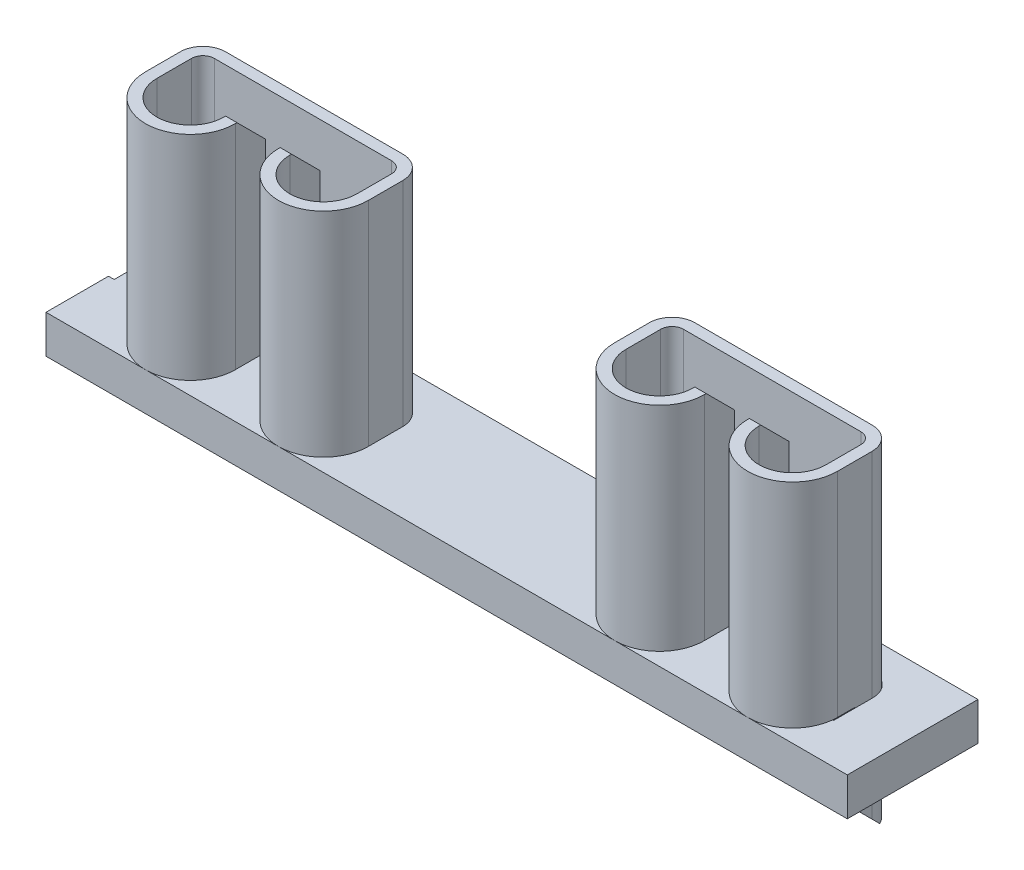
ISO-10303-21;
HEADER;
FILE_DESCRIPTION(('STEP AP214'),'2;1');
FILE_NAME('part.step','',(''),(''),'','','');
FILE_SCHEMA(('AUTOMOTIVE_DESIGN { 1 0 10303 214 1 1 1 1 }'));
ENDSEC;
DATA;
#1=APPLICATION_CONTEXT('core data for automotive mechanical design processes');
#2=APPLICATION_PROTOCOL_DEFINITION('international standard','automotive_design',2000,#1);
#3=PRODUCT_CONTEXT('',#1,'mechanical');
#4=PRODUCT('Part','Part','',(#3));
#5=PRODUCT_RELATED_PRODUCT_CATEGORY('part','',(#4));
#6=PRODUCT_DEFINITION_FORMATION('','',#4);
#7=PRODUCT_DEFINITION_CONTEXT('part definition',#1,'design');
#8=PRODUCT_DEFINITION('design','',#6,#7);
#9=PRODUCT_DEFINITION_SHAPE('','',#8);
#10=(LENGTH_UNIT() NAMED_UNIT(*) SI_UNIT(.MILLI.,.METRE.));
#11=(NAMED_UNIT(*) PLANE_ANGLE_UNIT() SI_UNIT($,.RADIAN.));
#12=(NAMED_UNIT(*) SI_UNIT($,.STERADIAN.) SOLID_ANGLE_UNIT());
#13=UNCERTAINTY_MEASURE_WITH_UNIT(LENGTH_MEASURE(1.E-05),#10,'distance_accuracy_value','');
#14=(GEOMETRIC_REPRESENTATION_CONTEXT(3) GLOBAL_UNCERTAINTY_ASSIGNED_CONTEXT((#13)) GLOBAL_UNIT_ASSIGNED_CONTEXT((#10,
#11,#12)) REPRESENTATION_CONTEXT('',''));
#15=CARTESIAN_POINT('',(0.,0.,0.));
#16=DIRECTION('',(0.,0.,1.));
#17=DIRECTION('',(1.,0.,0.));
#18=AXIS2_PLACEMENT_3D('',#15,#16,#17);
#19=CARTESIAN_POINT('',(-4.14954030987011,9.52641412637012,-1.07563580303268));
#20=DIRECTION('',(-1.,0.,0.));
#21=DIRECTION('',(0.,0.,1.));
#22=AXIS2_PLACEMENT_3D('',#19,#20,#21);
#23=PLANE('',#22);
#24=DIRECTION('',(0.,-0.707106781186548,-0.707106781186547));
#25=VECTOR('',#24,1.);
#26=CARTESIAN_POINT('',(-4.14954030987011,8.25641412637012,-2.4218358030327));
#27=LINE('',#26,#25);
#28=CARTESIAN_POINT('',(-4.14954030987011,8.25641412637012,-2.4218358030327));
#29=VERTEX_POINT('',#28);
#30=CARTESIAN_POINT('',(-4.14954030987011,9.52641412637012,-1.1518358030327));
#31=VERTEX_POINT('',#30);
#32=EDGE_CURVE('P0_E264',#29,#31,#27,.F.);
#33=ORIENTED_EDGE('',*,*,#32,.T.);
#34=DIRECTION('',(0.,0.,1.));
#35=VECTOR('',#34,1.);
#36=CARTESIAN_POINT('',(-4.14954030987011,9.52641412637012,-1.0756358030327));
#37=LINE('',#36,#35);
#38=CARTESIAN_POINT('',(-4.14954030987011,9.52641412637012,-1.07563580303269));
#39=VERTEX_POINT('',#38);
#40=EDGE_CURVE('P0_E269',#39,#31,#37,.F.);
#41=ORIENTED_EDGE('',*,*,#40,.F.);
#42=DIRECTION('',(0.,-1.,0.));
#43=VECTOR('',#42,1.);
#44=CARTESIAN_POINT('',(-4.14954030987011,9.52641412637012,-1.07563580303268));
#45=LINE('',#44,#43);
#46=CARTESIAN_POINT('',(-4.14954030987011,0.00141412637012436,-1.07563580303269));
#47=VERTEX_POINT('',#46);
#48=EDGE_CURVE('P0_E215',#39,#47,#45,.T.);
#49=ORIENTED_EDGE('',*,*,#48,.T.);
#50=DIRECTION('',(0.,0.,1.));
#51=VECTOR('',#50,1.);
#52=CARTESIAN_POINT('',(-4.14954030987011,0.00141412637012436,-1.07563580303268));
#53=LINE('',#52,#51);
#54=CARTESIAN_POINT('',(-4.14954030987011,0.00141412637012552,-2.4218358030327));
#55=VERTEX_POINT('',#54);
#56=EDGE_CURVE('P0_E209',#55,#47,#53,.T.);
#57=ORIENTED_EDGE('',*,*,#56,.F.);
#58=DIRECTION('',(0.,1.,0.));
#59=VECTOR('',#58,1.);
#60=CARTESIAN_POINT('',(-4.14954030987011,9.52641412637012,-2.4218358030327));
#61=LINE('',#60,#59);
#62=EDGE_CURVE('P0_E212',#29,#55,#61,.F.);
#63=ORIENTED_EDGE('',*,*,#62,.F.);
#64=EDGE_LOOP('',(#33,#41,#49,#57,#63));
#65=FACE_BOUND('',#64,.T.);
#66=ADVANCED_FACE('P0_F16',(#65),#23,.F.);
#67=CARTESIAN_POINT('',(-7.09594030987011,9.52641412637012,-1.0756358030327));
#68=DIRECTION('',(1.,0.,0.));
#69=DIRECTION('',(0.,0.,-1.));
#70=AXIS2_PLACEMENT_3D('',#67,#68,#69);
#71=PLANE('',#70);
#72=DIRECTION('',(0.,0.707106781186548,0.707106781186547));
#73=VECTOR('',#72,1.);
#74=CARTESIAN_POINT('',(-7.09594030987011,8.25641412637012,-2.4218358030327));
#75=LINE('',#74,#73);
#76=CARTESIAN_POINT('',(-7.09594030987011,8.25641412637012,-2.4218358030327));
#77=VERTEX_POINT('',#76);
#78=CARTESIAN_POINT('',(-7.09594030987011,9.52641412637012,-1.1518358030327));
#79=VERTEX_POINT('',#78);
#80=EDGE_CURVE('P0_E307',#77,#79,#75,.T.);
#81=ORIENTED_EDGE('',*,*,#80,.F.);
#82=DIRECTION('',(0.,1.,0.));
#83=VECTOR('',#82,1.);
#84=CARTESIAN_POINT('',(-7.09594030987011,9.52641412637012,-2.4218358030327));
#85=LINE('',#84,#83);
#86=CARTESIAN_POINT('',(-7.09594030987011,0.00141412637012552,-2.4218358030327));
#87=VERTEX_POINT('',#86);
#88=EDGE_CURVE('P0_E310',#87,#77,#85,.T.);
#89=ORIENTED_EDGE('',*,*,#88,.F.);
#90=DIRECTION('',(0.,0.,-1.));
#91=VECTOR('',#90,1.);
#92=CARTESIAN_POINT('',(-7.09594030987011,0.00141412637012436,-1.0756358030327));
#93=LINE('',#92,#91);
#94=CARTESIAN_POINT('',(-7.09594030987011,0.00141412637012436,-1.0756358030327));
#95=VERTEX_POINT('',#94);
#96=EDGE_CURVE('P0_E189',#95,#87,#93,.T.);
#97=ORIENTED_EDGE('',*,*,#96,.F.);
#98=DIRECTION('',(0.,-1.,0.));
#99=VECTOR('',#98,1.);
#100=CARTESIAN_POINT('',(-7.09594030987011,9.52641412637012,-1.0756358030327));
#101=LINE('',#100,#99);
#102=CARTESIAN_POINT('',(-7.09594030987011,9.52641412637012,-1.0756358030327));
#103=VERTEX_POINT('',#102);
#104=EDGE_CURVE('P0_E268',#95,#103,#101,.F.);
#105=ORIENTED_EDGE('',*,*,#104,.T.);
#106=DIRECTION('',(0.,0.,-1.));
#107=VECTOR('',#106,1.);
#108=CARTESIAN_POINT('',(-7.09594030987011,9.52641412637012,-1.0756358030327));
#109=LINE('',#108,#107);
#110=EDGE_CURVE('P0_E279',#103,#79,#109,.T.);
#111=ORIENTED_EDGE('',*,*,#110,.T.);
#112=EDGE_LOOP('',(#81,#89,#97,#105,#111));
#113=FACE_BOUND('',#112,.T.);
#114=ADVANCED_FACE('P0_F546',(#113),#71,.F.);
#115=CARTESIAN_POINT('',(-7.09594030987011,9.52641412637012,-2.4218358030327));
#116=DIRECTION('',(0.,0.,-1.));
#117=DIRECTION('',(-1.,0.,0.));
#118=AXIS2_PLACEMENT_3D('',#115,#116,#117);
#119=PLANE('',#118);
#120=DIRECTION('',(0.,1.,0.));
#121=VECTOR('',#120,1.);
#122=CARTESIAN_POINT('',(-6.58794030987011,9.52641412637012,-2.4218358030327));
#123=LINE('',#122,#121);
#124=CARTESIAN_POINT('',(-6.58794030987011,0.00141412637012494,-2.4218358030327));
#125=VERTEX_POINT('',#124);
#126=CARTESIAN_POINT('',(-6.58794030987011,8.25641412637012,-2.4218358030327));
#127=VERTEX_POINT('',#126);
#128=EDGE_CURVE('P0_E289',#125,#127,#123,.T.);
#129=ORIENTED_EDGE('',*,*,#128,.F.);
#130=DIRECTION('',(1.,0.,0.));
#131=VECTOR('',#130,1.);
#132=CARTESIAN_POINT('',(-0.233299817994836,0.0014141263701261,-2.4218358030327));
#133=LINE('',#132,#131);
#134=EDGE_CURVE('P0_E278',#125,#87,#133,.F.);
#135=ORIENTED_EDGE('',*,*,#134,.T.);
#136=ORIENTED_EDGE('',*,*,#88,.T.);
#137=DIRECTION('',(1.,0.,0.));
#138=VECTOR('',#137,1.);
#139=CARTESIAN_POINT('',(-7.09594030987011,8.25641412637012,-2.4218358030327));
#140=LINE('',#139,#138);
#141=EDGE_CURVE('P0_E282',#127,#77,#140,.F.);
#142=ORIENTED_EDGE('',*,*,#141,.F.);
#143=EDGE_LOOP('',(#129,#135,#136,#142));
#144=FACE_BOUND('',#143,.T.);
#145=ADVANCED_FACE('P0_F549',(#144),#119,.T.);
#146=CARTESIAN_POINT('',(-7.09594030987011,8.25641412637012,-2.4218358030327));
#147=DIRECTION('',(0.,0.707106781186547,-0.707106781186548));
#148=DIRECTION('',(0.,0.707106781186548,0.707106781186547));
#149=AXIS2_PLACEMENT_3D('',#146,#147,#148);
#150=PLANE('',#149);
#151=DIRECTION('',(0.,0.707106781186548,0.707106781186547));
#152=VECTOR('',#151,1.);
#153=CARTESIAN_POINT('',(-6.58794030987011,8.25641412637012,-2.4218358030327));
#154=LINE('',#153,#152);
#155=CARTESIAN_POINT('',(-6.58794030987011,9.52641412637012,-1.1518358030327));
#156=VERTEX_POINT('',#155);
#157=EDGE_CURVE('P0_E292',#127,#156,#154,.T.);
#158=ORIENTED_EDGE('',*,*,#157,.F.);
#159=ORIENTED_EDGE('',*,*,#141,.T.);
#160=ORIENTED_EDGE('',*,*,#80,.T.);
#161=DIRECTION('',(1.,0.,0.));
#162=VECTOR('',#161,1.);
#163=CARTESIAN_POINT('',(-2.65094030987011,9.52641412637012,-1.1518358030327));
#164=LINE('',#163,#162);
#165=EDGE_CURVE('P0_E272',#79,#156,#164,.T.);
#166=ORIENTED_EDGE('',*,*,#165,.T.);
#167=EDGE_LOOP('',(#158,#159,#160,#166));
#168=FACE_BOUND('',#167,.T.);
#169=ADVANCED_FACE('P0_F550',(#168),#150,.T.);
#170=CARTESIAN_POINT('',(-4.65754030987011,8.25641412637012,-2.4218358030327));
#171=DIRECTION('',(0.,-0.707106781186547,0.707106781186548));
#172=DIRECTION('',(0.,-0.707106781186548,-0.707106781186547));
#173=AXIS2_PLACEMENT_3D('',#170,#171,#172);
#174=PLANE('',#173);
#175=DIRECTION('',(1.,0.,0.));
#176=VECTOR('',#175,1.);
#177=CARTESIAN_POINT('',(-4.65754030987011,9.52641412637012,-1.1518358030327));
#178=LINE('',#177,#176);
#179=CARTESIAN_POINT('',(-4.65754030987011,9.52641412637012,-1.1518358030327));
#180=VERTEX_POINT('',#179);
#181=EDGE_CURVE('P0_E254',#31,#180,#178,.F.);
#182=ORIENTED_EDGE('',*,*,#181,.F.);
#183=ORIENTED_EDGE('',*,*,#32,.F.);
#184=DIRECTION('',(-1.,0.,0.));
#185=VECTOR('',#184,1.);
#186=CARTESIAN_POINT('',(-4.65754030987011,8.25641412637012,-2.4218358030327));
#187=LINE('',#186,#185);
#188=CARTESIAN_POINT('',(-4.65754030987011,8.25641412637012,-2.4218358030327));
#189=VERTEX_POINT('',#188);
#190=EDGE_CURVE('P0_E228',#189,#29,#187,.F.);
#191=ORIENTED_EDGE('',*,*,#190,.F.);
#192=DIRECTION('',(0.,-0.707106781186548,-0.707106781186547));
#193=VECTOR('',#192,1.);
#194=CARTESIAN_POINT('',(-4.65754030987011,9.52641412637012,-1.1518358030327));
#195=LINE('',#194,#193);
#196=EDGE_CURVE('P0_E250',#180,#189,#195,.T.);
#197=ORIENTED_EDGE('',*,*,#196,.F.);
#198=EDGE_LOOP('',(#182,#183,#191,#197));
#199=FACE_BOUND('',#198,.T.);
#200=ADVANCED_FACE('P0_F531',(#199),#174,.F.);
#201=CARTESIAN_POINT('',(-4.65754030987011,9.52641412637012,-2.4218358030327));
#202=DIRECTION('',(0.,0.,-1.));
#203=DIRECTION('',(-1.,0.,0.));
#204=AXIS2_PLACEMENT_3D('',#201,#202,#203);
#205=PLANE('',#204);
#206=ORIENTED_EDGE('',*,*,#62,.T.);
#207=DIRECTION('',(1.,0.,0.));
#208=VECTOR('',#207,1.);
#209=CARTESIAN_POINT('',(-0.233299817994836,0.0014141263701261,-2.4218358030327));
#210=LINE('',#209,#208);
#211=CARTESIAN_POINT('',(-4.65754030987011,0.00141412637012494,-2.4218358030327));
#212=VERTEX_POINT('',#211);
#213=EDGE_CURVE('P0_E225',#55,#212,#210,.F.);
#214=ORIENTED_EDGE('',*,*,#213,.T.);
#215=DIRECTION('',(0.,1.,0.));
#216=VECTOR('',#215,1.);
#217=CARTESIAN_POINT('',(-4.65754030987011,9.52641412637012,-2.4218358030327));
#218=LINE('',#217,#216);
#219=EDGE_CURVE('P0_E248',#189,#212,#218,.F.);
#220=ORIENTED_EDGE('',*,*,#219,.F.);
#221=ORIENTED_EDGE('',*,*,#190,.T.);
#222=EDGE_LOOP('',(#206,#214,#220,#221));
#223=FACE_BOUND('',#222,.T.);
#224=ADVANCED_FACE('P0_F223',(#223),#205,.T.);
#225=CARTESIAN_POINT('',(-2.65094030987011,9.52641412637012,-1.0756358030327));
#226=DIRECTION('',(0.,-1.,0.));
#227=DIRECTION('',(0.,0.,-1.));
#228=AXIS2_PLACEMENT_3D('',#225,#226,#227);
#229=CYLINDRICAL_SURFACE('',#228,1.4986);
#230=CARTESIAN_POINT('',(-2.65094030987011,0.00141412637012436,-1.0756358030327));
#231=DIRECTION('',(0.,-1.,0.));
#232=DIRECTION('',(0.,0.,-1.));
#233=AXIS2_PLACEMENT_3D('',#230,#231,#232);
#234=CIRCLE('',#233,1.4986);
#235=CARTESIAN_POINT('',(-1.15234030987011,0.00141412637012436,-1.0756358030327));
#236=VERTEX_POINT('',#235);
#237=EDGE_CURVE('P0_E235',#236,#47,#234,.T.);
#238=ORIENTED_EDGE('',*,*,#237,.T.);
#239=ORIENTED_EDGE('',*,*,#48,.F.);
#240=CARTESIAN_POINT('',(-2.65094030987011,9.52641412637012,-1.0756358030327));
#241=DIRECTION('',(0.,-1.,0.));
#242=DIRECTION('',(0.,0.,-1.));
#243=AXIS2_PLACEMENT_3D('',#240,#241,#242);
#244=CIRCLE('',#243,1.4986);
#245=CARTESIAN_POINT('',(-1.15234030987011,9.52641412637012,-1.0756358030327));
#246=VERTEX_POINT('',#245);
#247=EDGE_CURVE('P0_E238',#246,#39,#244,.T.);
#248=ORIENTED_EDGE('',*,*,#247,.F.);
#249=DIRECTION('',(0.,1.,0.));
#250=VECTOR('',#249,1.);
#251=CARTESIAN_POINT('',(-1.15234030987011,9.52641412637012,-1.0756358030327));
#252=LINE('',#251,#250);
#253=EDGE_CURVE('P0_E445',#246,#236,#252,.F.);
#254=ORIENTED_EDGE('',*,*,#253,.T.);
#255=EDGE_LOOP('',(#238,#239,#248,#254));
#256=FACE_BOUND('',#255,.T.);
#257=ADVANCED_FACE('P0_F988',(#256),#229,.F.);
#258=CARTESIAN_POINT('',(-8.59454030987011,9.52641412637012,-1.0756358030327));
#259=DIRECTION('',(0.,-1.,0.));
#260=DIRECTION('',(0.,0.,-1.));
#261=AXIS2_PLACEMENT_3D('',#258,#259,#260);
#262=CYLINDRICAL_SURFACE('',#261,1.4986);
#263=CARTESIAN_POINT('',(-8.59454030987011,0.00141412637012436,-1.0756358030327));
#264=DIRECTION('',(0.,-1.,0.));
#265=DIRECTION('',(0.,0.,-1.));
#266=AXIS2_PLACEMENT_3D('',#263,#264,#265);
#267=CIRCLE('',#266,1.4986);
#268=CARTESIAN_POINT('',(-10.0931403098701,0.00141412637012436,-1.0756358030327));
#269=VERTEX_POINT('',#268);
#270=EDGE_CURVE('P0_E19',#95,#269,#267,.T.);
#271=ORIENTED_EDGE('',*,*,#270,.T.);
#272=DIRECTION('',(0.,1.,0.));
#273=VECTOR('',#272,1.);
#274=CARTESIAN_POINT('',(-10.0931403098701,9.52641412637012,-1.0756358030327));
#275=LINE('',#274,#273);
#276=CARTESIAN_POINT('',(-10.0931403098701,9.52641412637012,-1.0756358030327));
#277=VERTEX_POINT('',#276);
#278=EDGE_CURVE('P0_E433',#269,#277,#275,.T.);
#279=ORIENTED_EDGE('',*,*,#278,.T.);
#280=CARTESIAN_POINT('',(-8.59454030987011,9.52641412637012,-1.0756358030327));
#281=DIRECTION('',(0.,-1.,0.));
#282=DIRECTION('',(0.,0.,-1.));
#283=AXIS2_PLACEMENT_3D('',#280,#281,#282);
#284=CIRCLE('',#283,1.4986);
#285=EDGE_CURVE('P0_E409',#103,#277,#284,.T.);
#286=ORIENTED_EDGE('',*,*,#285,.F.);
#287=ORIENTED_EDGE('',*,*,#104,.F.);
#288=EDGE_LOOP('',(#271,#279,#286,#287));
#289=FACE_BOUND('',#288,.T.);
#290=ADVANCED_FACE('P0_F979',(#289),#262,.F.);
#291=CARTESIAN_POINT('',(-0.233299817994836,0.0014141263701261,-1.8376358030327));
#292=DIRECTION('',(0.,1.,0.));
#293=DIRECTION('',(0.,0.,1.));
#294=AXIS2_PLACEMENT_3D('',#291,#292,#293);
#295=PLANE('',#294);
#296=DIRECTION('',(1.,0.,0.));
#297=VECTOR('',#296,1.);
#298=CARTESIAN_POINT('',(-7.42224230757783,0.00141412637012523,-1.8376358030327));
#299=LINE('',#298,#297);
#300=CARTESIAN_POINT('',(-10.0931403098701,0.00141412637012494,-1.8376358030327));
#301=VERTEX_POINT('',#300);
#302=CARTESIAN_POINT('',(-10.6011403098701,0.00141412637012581,-1.8376358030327));
#303=VERTEX_POINT('',#302);
#304=EDGE_CURVE('P0_E407',#301,#303,#299,.F.);
#305=ORIENTED_EDGE('',*,*,#304,.F.);
#306=DIRECTION('',(0.,0.,1.));
#307=VECTOR('',#306,1.);
#308=CARTESIAN_POINT('',(-10.0931403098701,0.00141412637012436,-1.0756358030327));
#309=LINE('',#308,#307);
#310=EDGE_CURVE('P0_E430',#301,#269,#309,.T.);
#311=ORIENTED_EDGE('',*,*,#310,.T.);
#312=ORIENTED_EDGE('',*,*,#270,.F.);
#313=ORIENTED_EDGE('',*,*,#96,.T.);
#314=ORIENTED_EDGE('',*,*,#134,.F.);
#315=DIRECTION('',(0.,0.,-1.));
#316=VECTOR('',#315,1.);
#317=CARTESIAN_POINT('',(-6.58794030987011,0.00141412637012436,-1.0756358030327));
#318=LINE('',#317,#316);
#319=CARTESIAN_POINT('',(-6.58794030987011,0.00141412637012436,-1.0756358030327));
#320=VERTEX_POINT('',#319);
#321=EDGE_CURVE('P0_E411',#320,#125,#318,.T.);
#322=ORIENTED_EDGE('',*,*,#321,.F.);
#323=CARTESIAN_POINT('',(-8.59454030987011,0.00141412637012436,-1.0756358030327));
#324=DIRECTION('',(0.,-1.,0.));
#325=DIRECTION('',(0.,0.,-1.));
#326=AXIS2_PLACEMENT_3D('',#323,#324,#325);
#327=CIRCLE('',#326,2.0066);
#328=CARTESIAN_POINT('',(-10.6011403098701,0.00141412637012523,-1.0756358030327));
#329=VERTEX_POINT('',#328);
#330=EDGE_CURVE('P0_E404',#329,#320,#327,.F.);
#331=ORIENTED_EDGE('',*,*,#330,.F.);
#332=DIRECTION('',(0.,0.,1.));
#333=VECTOR('',#332,1.);
#334=CARTESIAN_POINT('',(-10.6011403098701,0.0014141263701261,-1.8376358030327));
#335=LINE('',#334,#333);
#336=EDGE_CURVE('P0_E293',#303,#329,#335,.T.);
#337=ORIENTED_EDGE('',*,*,#336,.F.);
#338=EDGE_LOOP('',(#305,#311,#312,#313,#314,#322,#331,#337));
#339=FACE_BOUND('',#338,.T.);
#340=ADVANCED_FACE('P0_F552',(#339),#295,.F.);
#341=CARTESIAN_POINT('',(-6.58794030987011,9.52641412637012,-1.0756358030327));
#342=DIRECTION('',(1.,0.,0.));
#343=DIRECTION('',(0.,0.,-1.));
#344=AXIS2_PLACEMENT_3D('',#341,#342,#343);
#345=PLANE('',#344);
#346=DIRECTION('',(0.,-1.,0.));
#347=VECTOR('',#346,1.);
#348=CARTESIAN_POINT('',(-6.58794030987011,9.52641412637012,-1.0756358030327));
#349=LINE('',#348,#347);
#350=CARTESIAN_POINT('',(-6.58794030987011,9.52641412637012,-1.0756358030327));
#351=VERTEX_POINT('',#350);
#352=EDGE_CURVE('P0_E403',#320,#351,#349,.F.);
#353=ORIENTED_EDGE('',*,*,#352,.F.);
#354=ORIENTED_EDGE('',*,*,#321,.T.);
#355=ORIENTED_EDGE('',*,*,#128,.T.);
#356=ORIENTED_EDGE('',*,*,#157,.T.);
#357=DIRECTION('',(0.,0.,-1.));
#358=VECTOR('',#357,1.);
#359=CARTESIAN_POINT('',(-6.58794030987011,9.52641412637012,-1.0756358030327));
#360=LINE('',#359,#358);
#361=EDGE_CURVE('P0_E302',#156,#351,#360,.F.);
#362=ORIENTED_EDGE('',*,*,#361,.T.);
#363=EDGE_LOOP('',(#353,#354,#355,#356,#362));
#364=FACE_BOUND('',#363,.T.);
#365=ADVANCED_FACE('P0_F469',(#364),#345,.T.);
#366=CARTESIAN_POINT('',(-0.233299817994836,0.0014141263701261,-1.8376358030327));
#367=DIRECTION('',(0.,1.,0.));
#368=DIRECTION('',(0.,0.,1.));
#369=AXIS2_PLACEMENT_3D('',#366,#367,#368);
#370=PLANE('',#369);
#371=CARTESIAN_POINT('',(-2.65094030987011,0.00141412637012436,-1.0756358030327));
#372=DIRECTION('',(0.,-1.,0.));
#373=DIRECTION('',(0.,0.,-1.));
#374=AXIS2_PLACEMENT_3D('',#371,#372,#373);
#375=CIRCLE('',#374,2.0066);
#376=CARTESIAN_POINT('',(-4.65754030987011,0.00141412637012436,-1.07563580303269));
#377=VERTEX_POINT('',#376);
#378=CARTESIAN_POINT('',(-0.644340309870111,0.00141412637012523,-1.0756358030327));
#379=VERTEX_POINT('',#378);
#380=EDGE_CURVE('P0_E396',#377,#379,#375,.F.);
#381=ORIENTED_EDGE('',*,*,#380,.F.);
#382=DIRECTION('',(0.,0.,1.));
#383=VECTOR('',#382,1.);
#384=CARTESIAN_POINT('',(-4.65754030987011,0.00141412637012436,-1.07563580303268));
#385=LINE('',#384,#383);
#386=EDGE_CURVE('P0_E232',#212,#377,#385,.T.);
#387=ORIENTED_EDGE('',*,*,#386,.F.);
#388=ORIENTED_EDGE('',*,*,#213,.F.);
#389=ORIENTED_EDGE('',*,*,#56,.T.);
#390=ORIENTED_EDGE('',*,*,#237,.F.);
#391=DIRECTION('',(0.,0.,-1.));
#392=VECTOR('',#391,1.);
#393=CARTESIAN_POINT('',(-1.15234030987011,0.00141412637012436,-1.0756358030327));
#394=LINE('',#393,#392);
#395=CARTESIAN_POINT('',(-1.15234030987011,0.00141412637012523,-1.8376358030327));
#396=VERTEX_POINT('',#395);
#397=EDGE_CURVE('P0_E442',#236,#396,#394,.T.);
#398=ORIENTED_EDGE('',*,*,#397,.T.);
#399=DIRECTION('',(1.,0.,0.));
#400=VECTOR('',#399,1.);
#401=CARTESIAN_POINT('',(-0.233299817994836,0.0014141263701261,-1.8376358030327));
#402=LINE('',#401,#400);
#403=CARTESIAN_POINT('',(-0.644340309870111,0.00141412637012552,-1.8376358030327));
#404=VERTEX_POINT('',#403);
#405=EDGE_CURVE('P0_E240',#404,#396,#402,.F.);
#406=ORIENTED_EDGE('',*,*,#405,.F.);
#407=DIRECTION('',(0.,0.,1.));
#408=VECTOR('',#407,1.);
#409=CARTESIAN_POINT('',(-0.644340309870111,0.0014141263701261,-1.8376358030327));
#410=LINE('',#409,#408);
#411=EDGE_CURVE('P0_E234',#379,#404,#410,.F.);
#412=ORIENTED_EDGE('',*,*,#411,.F.);
#413=EDGE_LOOP('',(#381,#387,#388,#389,#390,#398,#406,#412));
#414=FACE_BOUND('',#413,.T.);
#415=ADVANCED_FACE('P0_F230',(#414),#370,.F.);
#416=CARTESIAN_POINT('',(-4.65754030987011,9.52641412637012,-1.07563580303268));
#417=DIRECTION('',(-1.,0.,0.));
#418=DIRECTION('',(0.,0.,1.));
#419=AXIS2_PLACEMENT_3D('',#416,#417,#418);
#420=PLANE('',#419);
#421=ORIENTED_EDGE('',*,*,#386,.T.);
#422=DIRECTION('',(0.,-1.,0.));
#423=VECTOR('',#422,1.);
#424=CARTESIAN_POINT('',(-4.65754030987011,9.52641412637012,-1.07563580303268));
#425=LINE('',#424,#423);
#426=CARTESIAN_POINT('',(-4.65754030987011,9.52641412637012,-1.07563580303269));
#427=VERTEX_POINT('',#426);
#428=EDGE_CURVE('P0_E395',#427,#377,#425,.T.);
#429=ORIENTED_EDGE('',*,*,#428,.F.);
#430=DIRECTION('',(0.,0.,1.));
#431=VECTOR('',#430,1.);
#432=CARTESIAN_POINT('',(-4.65754030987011,9.52641412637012,-1.07563580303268));
#433=LINE('',#432,#431);
#434=EDGE_CURVE('P0_E259',#427,#180,#433,.F.);
#435=ORIENTED_EDGE('',*,*,#434,.T.);
#436=ORIENTED_EDGE('',*,*,#196,.T.);
#437=ORIENTED_EDGE('',*,*,#219,.T.);
#438=EDGE_LOOP('',(#421,#429,#435,#436,#437));
#439=FACE_BOUND('',#438,.T.);
#440=ADVANCED_FACE('P0_F524',(#439),#420,.T.);
#441=CARTESIAN_POINT('',(-1.15234030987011,9.52641412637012,-1.0756358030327));
#442=DIRECTION('',(1.,0.,0.));
#443=DIRECTION('',(0.,0.,-1.));
#444=AXIS2_PLACEMENT_3D('',#441,#442,#443);
#445=PLANE('',#444);
#446=DIRECTION('',(0.,-0.707106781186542,-0.707106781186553));
#447=VECTOR('',#446,1.);
#448=CARTESIAN_POINT('',(-1.15234030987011,-3.9274449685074,-1.8376358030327));
#449=LINE('',#448,#447);
#450=CARTESIAN_POINT('',(-1.15234030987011,-3.9274449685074,-1.8376358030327));
#451=VERTEX_POINT('',#450);
#452=CARTESIAN_POINT('',(-1.15234030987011,-4.71484496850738,-2.62503580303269));
#453=VERTEX_POINT('',#452);
#454=EDGE_CURVE('P0_E434',#451,#453,#449,.T.);
#455=ORIENTED_EDGE('',*,*,#454,.F.);
#456=DIRECTION('',(0.,1.,0.));
#457=VECTOR('',#456,1.);
#458=CARTESIAN_POINT('',(-1.15234030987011,0.0014141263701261,-1.8376358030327));
#459=LINE('',#458,#457);
#460=EDGE_CURVE('P0_E509',#396,#451,#459,.F.);
#461=ORIENTED_EDGE('',*,*,#460,.F.);
#462=ORIENTED_EDGE('',*,*,#397,.F.);
#463=ORIENTED_EDGE('',*,*,#253,.F.);
#464=DIRECTION('',(0.,0.,1.));
#465=VECTOR('',#464,1.);
#466=CARTESIAN_POINT('',(-1.15234030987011,9.52641412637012,-3.1330358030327));
#467=LINE('',#466,#465);
#468=CARTESIAN_POINT('',(-1.15234030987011,9.52641412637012,-2.62503580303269));
#469=VERTEX_POINT('',#468);
#470=EDGE_CURVE('P0_E399',#469,#246,#467,.T.);
#471=ORIENTED_EDGE('',*,*,#470,.F.);
#472=DIRECTION('',(0.,-1.,0.));
#473=VECTOR('',#472,1.);
#474=CARTESIAN_POINT('',(-1.15234030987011,9.52641412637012,-2.62503580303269));
#475=LINE('',#474,#473);
#476=EDGE_CURVE('P0_E391',#469,#453,#475,.T.);
#477=ORIENTED_EDGE('',*,*,#476,.T.);
#478=EDGE_LOOP('',(#455,#461,#462,#463,#471,#477));
#479=FACE_BOUND('',#478,.T.);
#480=ADVANCED_FACE('P0_F936',(#479),#445,.F.);
#481=CARTESIAN_POINT('',(-10.0931403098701,9.52641412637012,-1.0756358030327));
#482=DIRECTION('',(-1.,0.,0.));
#483=DIRECTION('',(0.,0.,1.));
#484=AXIS2_PLACEMENT_3D('',#481,#482,#483);
#485=PLANE('',#484);
#486=DIRECTION('',(0.,-1.,0.));
#487=VECTOR('',#486,1.);
#488=CARTESIAN_POINT('',(-10.0931403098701,9.52641412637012,-2.62503580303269));
#489=LINE('',#488,#487);
#490=CARTESIAN_POINT('',(-10.0931403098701,-4.71484496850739,-2.6250358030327));
#491=VERTEX_POINT('',#490);
#492=CARTESIAN_POINT('',(-10.0931403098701,9.52641412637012,-2.6250358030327));
#493=VERTEX_POINT('',#492);
#494=EDGE_CURVE('P0_E388',#491,#493,#489,.F.);
#495=ORIENTED_EDGE('',*,*,#494,.T.);
#496=DIRECTION('',(0.,0.,1.));
#497=VECTOR('',#496,1.);
#498=CARTESIAN_POINT('',(-10.0931403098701,9.52641412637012,-1.0756358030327));
#499=LINE('',#498,#497);
#500=EDGE_CURVE('P0_E402',#277,#493,#499,.F.);
#501=ORIENTED_EDGE('',*,*,#500,.F.);
#502=ORIENTED_EDGE('',*,*,#278,.F.);
#503=ORIENTED_EDGE('',*,*,#310,.F.);
#504=DIRECTION('',(0.,1.,0.));
#505=VECTOR('',#504,1.);
#506=CARTESIAN_POINT('',(-10.0931403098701,0.0014141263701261,-1.8376358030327));
#507=LINE('',#506,#505);
#508=CARTESIAN_POINT('',(-10.0931403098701,-3.9274449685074,-1.8376358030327));
#509=VERTEX_POINT('',#508);
#510=EDGE_CURVE('P0_E439',#509,#301,#507,.T.);
#511=ORIENTED_EDGE('',*,*,#510,.F.);
#512=DIRECTION('',(0.,0.707106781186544,0.707106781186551));
#513=VECTOR('',#512,1.);
#514=CARTESIAN_POINT('',(-10.0931403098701,-4.71484496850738,-2.62503580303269));
#515=LINE('',#514,#513);
#516=EDGE_CURVE('P0_E461',#491,#509,#515,.T.);
#517=ORIENTED_EDGE('',*,*,#516,.F.);
#518=EDGE_LOOP('',(#495,#501,#502,#503,#511,#517));
#519=FACE_BOUND('',#518,.T.);
#520=ADVANCED_FACE('P0_F927',(#519),#485,.F.);
#521=CARTESIAN_POINT('',(-7.42224230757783,0.0014141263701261,-1.8376358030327));
#522=DIRECTION('',(0.,0.,1.));
#523=DIRECTION('',(1.,0.,0.));
#524=AXIS2_PLACEMENT_3D('',#521,#522,#523);
#525=PLANE('',#524);
#526=ORIENTED_EDGE('',*,*,#510,.T.);
#527=ORIENTED_EDGE('',*,*,#304,.T.);
#528=DIRECTION('',(0.,1.,0.));
#529=VECTOR('',#528,1.);
#530=CARTESIAN_POINT('',(-10.6011403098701,9.52641412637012,-1.8376358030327));
#531=LINE('',#530,#529);
#532=CARTESIAN_POINT('',(-10.6011403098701,-3.9274449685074,-1.8376358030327));
#533=VERTEX_POINT('',#532);
#534=EDGE_CURVE('P0_E486',#533,#303,#531,.T.);
#535=ORIENTED_EDGE('',*,*,#534,.F.);
#536=DIRECTION('',(1.,0.,0.));
#537=VECTOR('',#536,1.);
#538=CARTESIAN_POINT('',(-9.58514030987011,-3.9274449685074,-1.8376358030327));
#539=LINE('',#538,#537);
#540=EDGE_CURVE('P0_E384',#509,#533,#539,.F.);
#541=ORIENTED_EDGE('',*,*,#540,.F.);
#542=EDGE_LOOP('',(#526,#527,#535,#541));
#543=FACE_BOUND('',#542,.T.);
#544=ADVANCED_FACE('P0_F555',(#543),#525,.T.);
#545=CARTESIAN_POINT('',(-8.59454030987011,9.52641412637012,-1.0756358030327));
#546=DIRECTION('',(0.,-1.,0.));
#547=DIRECTION('',(0.,0.,-1.));
#548=AXIS2_PLACEMENT_3D('',#545,#546,#547);
#549=CYLINDRICAL_SURFACE('',#548,2.0066);
#550=CARTESIAN_POINT('',(-8.59454030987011,9.52641412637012,-1.0756358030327));
#551=DIRECTION('',(0.,-1.,0.));
#552=DIRECTION('',(0.,0.,-1.));
#553=AXIS2_PLACEMENT_3D('',#550,#551,#552);
#554=CIRCLE('',#553,2.0066);
#555=CARTESIAN_POINT('',(-10.6011403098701,9.52641412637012,-1.0756358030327));
#556=VERTEX_POINT('',#555);
#557=EDGE_CURVE('P0_E400',#351,#556,#554,.T.);
#558=ORIENTED_EDGE('',*,*,#557,.T.);
#559=DIRECTION('',(0.,1.,0.));
#560=VECTOR('',#559,1.);
#561=CARTESIAN_POINT('',(-10.6011403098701,9.52641412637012,-1.0756358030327));
#562=LINE('',#561,#560);
#563=EDGE_CURVE('P0_E481',#329,#556,#562,.T.);
#564=ORIENTED_EDGE('',*,*,#563,.F.);
#565=ORIENTED_EDGE('',*,*,#330,.T.);
#566=ORIENTED_EDGE('',*,*,#352,.T.);
#567=EDGE_LOOP('',(#558,#564,#565,#566));
#568=FACE_BOUND('',#567,.T.);
#569=ADVANCED_FACE('P0_F464',(#568),#549,.T.);
#570=CARTESIAN_POINT('',(-2.65094030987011,9.52641412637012,-1.0756358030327));
#571=DIRECTION('',(0.,-1.,0.));
#572=DIRECTION('',(0.,0.,-1.));
#573=AXIS2_PLACEMENT_3D('',#570,#571,#572);
#574=CYLINDRICAL_SURFACE('',#573,2.0066);
#575=CARTESIAN_POINT('',(-2.65094030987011,9.52641412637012,-1.0756358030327));
#576=DIRECTION('',(0.,-1.,0.));
#577=DIRECTION('',(0.,0.,-1.));
#578=AXIS2_PLACEMENT_3D('',#575,#576,#577);
#579=CIRCLE('',#578,2.0066);
#580=CARTESIAN_POINT('',(-0.644340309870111,9.52641412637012,-1.0756358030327));
#581=VERTEX_POINT('',#580);
#582=EDGE_CURVE('P0_E392',#581,#427,#579,.T.);
#583=ORIENTED_EDGE('',*,*,#582,.T.);
#584=ORIENTED_EDGE('',*,*,#428,.T.);
#585=ORIENTED_EDGE('',*,*,#380,.T.);
#586=DIRECTION('',(0.,1.,0.));
#587=VECTOR('',#586,1.);
#588=CARTESIAN_POINT('',(-0.644340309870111,9.52641412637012,-1.0756358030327));
#589=LINE('',#588,#587);
#590=EDGE_CURVE('P0_E579',#581,#379,#589,.F.);
#591=ORIENTED_EDGE('',*,*,#590,.F.);
#592=EDGE_LOOP('',(#583,#584,#585,#591));
#593=FACE_BOUND('',#592,.T.);
#594=ADVANCED_FACE('P0_F900',(#593),#574,.T.);
#595=CARTESIAN_POINT('',(-3.82323831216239,0.0014141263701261,-1.8376358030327));
#596=DIRECTION('',(0.,0.,1.));
#597=DIRECTION('',(1.,0.,0.));
#598=AXIS2_PLACEMENT_3D('',#595,#596,#597);
#599=PLANE('',#598);
#600=ORIENTED_EDGE('',*,*,#405,.T.);
#601=ORIENTED_EDGE('',*,*,#460,.T.);
#602=DIRECTION('',(1.,0.,0.));
#603=VECTOR('',#602,1.);
#604=CARTESIAN_POINT('',(-3.82323831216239,-3.9274449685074,-1.8376358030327));
#605=LINE('',#604,#603);
#606=CARTESIAN_POINT('',(-0.644340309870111,-3.9274449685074,-1.8376358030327));
#607=VERTEX_POINT('',#606);
#608=EDGE_CURVE('P0_E512',#451,#607,#605,.T.);
#609=ORIENTED_EDGE('',*,*,#608,.T.);
#610=DIRECTION('',(0.,1.,0.));
#611=VECTOR('',#610,1.);
#612=CARTESIAN_POINT('',(-0.644340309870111,9.52641412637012,-1.8376358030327));
#613=LINE('',#612,#611);
#614=EDGE_CURVE('P0_E372',#404,#607,#613,.F.);
#615=ORIENTED_EDGE('',*,*,#614,.F.);
#616=EDGE_LOOP('',(#600,#601,#609,#615));
#617=FACE_BOUND('',#616,.T.);
#618=ADVANCED_FACE('P0_F891',(#617),#599,.T.);
#619=CARTESIAN_POINT('',(-1.66034030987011,9.52641412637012,-2.6250358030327));
#620=DIRECTION('',(0.,-1.,0.));
#621=DIRECTION('',(0.,0.,-1.));
#622=AXIS2_PLACEMENT_3D('',#619,#620,#621);
#623=CYLINDRICAL_SURFACE('',#622,0.508);
#624=CARTESIAN_POINT('',(-1.66034030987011,-4.71484496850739,-2.6250358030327));
#625=DIRECTION('',(0.,0.707106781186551,-0.707106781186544));
#626=DIRECTION('',(0.,-0.707106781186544,-0.707106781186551));
#627=AXIS2_PLACEMENT_3D('',#624,#625,#626);
#628=ELLIPSE('',#627,0.718420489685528,0.508);
#629=CARTESIAN_POINT('',(-1.26871603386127,-5.03841014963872,-2.94860098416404));
#630=VERTEX_POINT('',#629);
#631=EDGE_CURVE('P0_E368',#630,#453,#628,.F.);
#632=ORIENTED_EDGE('',*,*,#631,.T.);
#633=ORIENTED_EDGE('',*,*,#476,.F.);
#634=CARTESIAN_POINT('',(-1.66034030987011,9.52641412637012,-2.6250358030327));
#635=DIRECTION('',(0.,-1.,0.));
#636=DIRECTION('',(0.,0.,-1.));
#637=AXIS2_PLACEMENT_3D('',#634,#635,#636);
#638=CIRCLE('',#637,0.508);
#639=CARTESIAN_POINT('',(-1.66034030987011,9.52641412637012,-3.1330358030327));
#640=VERTEX_POINT('',#639);
#641=EDGE_CURVE('P0_E373',#640,#469,#638,.T.);
#642=ORIENTED_EDGE('',*,*,#641,.F.);
#643=DIRECTION('',(0.,1.,0.));
#644=VECTOR('',#643,1.);
#645=CARTESIAN_POINT('',(-1.66034030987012,9.52641412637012,-3.1330358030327));
#646=LINE('',#645,#644);
#647=CARTESIAN_POINT('',(-1.66034030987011,-4.64678587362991,-3.1330358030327));
#648=VERTEX_POINT('',#647);
#649=EDGE_CURVE('P0_E591',#640,#648,#646,.F.);
#650=ORIENTED_EDGE('',*,*,#649,.T.);
#651=CARTESIAN_POINT('',(-1.66034030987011,-4.64678587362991,-2.6250358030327));
#652=DIRECTION('',(0.707106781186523,0.707106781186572,0.));
#653=DIRECTION('',(0.707106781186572,-0.707106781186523,0.));
#654=AXIS2_PLACEMENT_3D('',#651,#652,#653);
#655=ELLIPSE('',#654,0.718420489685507,0.508);
#656=EDGE_CURVE('P0_E389',#630,#648,#655,.T.);
#657=ORIENTED_EDGE('',*,*,#656,.F.);
#658=EDGE_LOOP('',(#632,#633,#642,#650,#657));
#659=FACE_BOUND('',#658,.T.);
#660=ADVANCED_FACE('P0_F882',(#659),#623,.F.);
#661=CARTESIAN_POINT('',(-9.58514030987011,9.52641412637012,-2.6250358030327));
#662=DIRECTION('',(0.,-1.,0.));
#663=DIRECTION('',(0.,0.,-1.));
#664=AXIS2_PLACEMENT_3D('',#661,#662,#663);
#665=CYLINDRICAL_SURFACE('',#664,0.508);
#666=CARTESIAN_POINT('',(-9.58514030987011,-4.64678587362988,-2.6250358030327));
#667=DIRECTION('',(-0.707106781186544,0.707106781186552,0.));
#668=DIRECTION('',(-0.707106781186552,-0.707106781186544,0.));
#669=AXIS2_PLACEMENT_3D('',#666,#667,#668);
#670=ELLIPSE('',#669,0.718420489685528,0.508);
#671=CARTESIAN_POINT('',(-9.5851403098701,-4.64678587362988,-3.1330358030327));
#672=VERTEX_POINT('',#671);
#673=CARTESIAN_POINT('',(-9.97676458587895,-5.03841014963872,-2.94860098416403));
#674=VERTEX_POINT('',#673);
#675=EDGE_CURVE('P0_E386',#672,#674,#670,.T.);
#676=ORIENTED_EDGE('',*,*,#675,.F.);
#677=DIRECTION('',(0.,1.,0.));
#678=VECTOR('',#677,1.);
#679=CARTESIAN_POINT('',(-9.5851403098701,9.52641412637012,-3.1330358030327));
#680=LINE('',#679,#678);
#681=CARTESIAN_POINT('',(-9.5851403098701,9.52641412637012,-3.1330358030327));
#682=VERTEX_POINT('',#681);
#683=EDGE_CURVE('P0_E565',#672,#682,#680,.T.);
#684=ORIENTED_EDGE('',*,*,#683,.T.);
#685=CARTESIAN_POINT('',(-9.58514030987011,9.52641412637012,-2.6250358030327));
#686=DIRECTION('',(0.,-1.,0.));
#687=DIRECTION('',(0.,0.,-1.));
#688=AXIS2_PLACEMENT_3D('',#685,#686,#687);
#689=CIRCLE('',#688,0.508);
#690=EDGE_CURVE('P0_E377',#493,#682,#689,.T.);
#691=ORIENTED_EDGE('',*,*,#690,.F.);
#692=ORIENTED_EDGE('',*,*,#494,.F.);
#693=CARTESIAN_POINT('',(-9.58514030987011,-4.71484496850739,-2.6250358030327));
#694=DIRECTION('',(0.,-0.707106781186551,0.707106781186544));
#695=DIRECTION('',(0.,-0.707106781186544,-0.707106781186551));
#696=AXIS2_PLACEMENT_3D('',#693,#694,#695);
#697=ELLIPSE('',#696,0.718420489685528,0.508);
#698=EDGE_CURVE('P0_E381',#674,#491,#697,.F.);
#699=ORIENTED_EDGE('',*,*,#698,.F.);
#700=EDGE_LOOP('',(#676,#684,#691,#692,#699));
#701=FACE_BOUND('',#700,.T.);
#702=ADVANCED_FACE('P0_F604',(#701),#665,.F.);
#703=CARTESIAN_POINT('',(-10.6011403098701,-5.15478587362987,-2.62503580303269));
#704=DIRECTION('',(0.,-1.,0.));
#705=DIRECTION('',(0.,0.,-1.));
#706=AXIS2_PLACEMENT_3D('',#703,#704,#705);
#707=PLANE('',#706);
#708=DIRECTION('',(1.,0.,0.));
#709=VECTOR('',#708,1.);
#710=CARTESIAN_POINT('',(-9.58514030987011,-5.15478587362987,-3.06497670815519));
#711=LINE('',#710,#709);
#712=CARTESIAN_POINT('',(-10.500950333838,-5.15478587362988,-3.06497670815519));
#713=VERTEX_POINT('',#712);
#714=CARTESIAN_POINT('',(-10.0931403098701,-5.15478587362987,-3.06497670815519));
#715=VERTEX_POINT('',#714);
#716=EDGE_CURVE('P0_E385',#713,#715,#711,.T.);
#717=ORIENTED_EDGE('',*,*,#716,.F.);
#718=CARTESIAN_POINT('',(-9.58514030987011,-5.15478587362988,-2.6250358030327));
#719=DIRECTION('',(0.,-1.,0.));
#720=DIRECTION('',(0.,0.,-1.));
#721=AXIS2_PLACEMENT_3D('',#718,#719,#720);
#722=CIRCLE('',#721,1.016);
#723=CARTESIAN_POINT('',(-10.0931403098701,-5.15478587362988,-3.50491761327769));
#724=VERTEX_POINT('',#723);
#725=EDGE_CURVE('P0_E364',#724,#713,#722,.F.);
#726=ORIENTED_EDGE('',*,*,#725,.F.);
#727=DIRECTION('',(0.,0.,1.));
#728=VECTOR('',#727,1.);
#729=CARTESIAN_POINT('',(-10.0931403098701,-5.15478587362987,-2.3710358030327));
#730=LINE('',#729,#728);
#731=EDGE_CURVE('P0_E608',#724,#715,#730,.T.);
#732=ORIENTED_EDGE('',*,*,#731,.T.);
#733=EDGE_LOOP('',(#717,#726,#732));
#734=FACE_BOUND('',#733,.T.);
#735=ADVANCED_FACE('P0_F864',(#734),#707,.T.);
#736=CARTESIAN_POINT('',(-9.58514030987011,-5.15478587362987,-3.06497670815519));
#737=DIRECTION('',(0.,-0.707106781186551,0.707106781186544));
#738=DIRECTION('',(0.,-0.707106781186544,-0.707106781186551));
#739=AXIS2_PLACEMENT_3D('',#736,#737,#738);
#740=PLANE('',#739);
#741=DIRECTION('',(0.,0.707106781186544,0.707106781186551));
#742=VECTOR('',#741,1.);
#743=CARTESIAN_POINT('',(-10.6011403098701,-4.71484496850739,-2.6250358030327));
#744=LINE('',#743,#742);
#745=CARTESIAN_POINT('',(-10.6011403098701,-4.71484496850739,-2.6250358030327));
#746=VERTEX_POINT('',#745);
#747=EDGE_CURVE('P0_E488',#746,#533,#744,.T.);
#748=ORIENTED_EDGE('',*,*,#747,.F.);
#749=CARTESIAN_POINT('',(-9.58514030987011,-4.71484496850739,-2.6250358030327));
#750=DIRECTION('',(0.,-0.707106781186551,0.707106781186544));
#751=DIRECTION('',(0.,-0.707106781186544,-0.707106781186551));
#752=AXIS2_PLACEMENT_3D('',#749,#750,#751);
#753=ELLIPSE('',#752,1.43684097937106,1.016);
#754=EDGE_CURVE('P0_E361',#713,#746,#753,.F.);
#755=ORIENTED_EDGE('',*,*,#754,.F.);
#756=ORIENTED_EDGE('',*,*,#716,.T.);
#757=DIRECTION('',(0.577350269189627,0.577350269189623,0.577350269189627));
#758=VECTOR('',#757,1.);
#759=CARTESIAN_POINT('',(-10.0931403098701,-5.15478587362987,-3.06497670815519));
#760=LINE('',#759,#758);
#761=EDGE_CURVE('P0_E367',#715,#674,#760,.T.);
#762=ORIENTED_EDGE('',*,*,#761,.T.);
#763=ORIENTED_EDGE('',*,*,#698,.T.);
#764=ORIENTED_EDGE('',*,*,#516,.T.);
#765=ORIENTED_EDGE('',*,*,#540,.T.);
#766=EDGE_LOOP('',(#748,#755,#756,#762,#763,#764,#765));
#767=FACE_BOUND('',#766,.T.);
#768=ADVANCED_FACE('P0_F855',(#767),#740,.T.);
#769=CARTESIAN_POINT('',(-10.6011403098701,9.52641412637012,-1.0756358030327));
#770=DIRECTION('',(-1.,0.,0.));
#771=DIRECTION('',(0.,0.,1.));
#772=AXIS2_PLACEMENT_3D('',#769,#770,#771);
#773=PLANE('',#772);
#774=ORIENTED_EDGE('',*,*,#563,.T.);
#775=DIRECTION('',(0.,0.,1.));
#776=VECTOR('',#775,1.);
#777=CARTESIAN_POINT('',(-10.6011403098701,9.52641412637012,-1.0756358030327));
#778=LINE('',#777,#776);
#779=CARTESIAN_POINT('',(-10.6011403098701,9.52641412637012,-2.6250358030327));
#780=VERTEX_POINT('',#779);
#781=EDGE_CURVE('P0_E380',#556,#780,#778,.F.);
#782=ORIENTED_EDGE('',*,*,#781,.T.);
#783=DIRECTION('',(0.,-1.,0.));
#784=VECTOR('',#783,1.);
#785=CARTESIAN_POINT('',(-10.6011403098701,9.52641412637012,-2.6250358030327));
#786=LINE('',#785,#784);
#787=EDGE_CURVE('P0_E360',#746,#780,#786,.F.);
#788=ORIENTED_EDGE('',*,*,#787,.F.);
#789=ORIENTED_EDGE('',*,*,#747,.T.);
#790=ORIENTED_EDGE('',*,*,#534,.T.);
#791=ORIENTED_EDGE('',*,*,#336,.T.);
#792=EDGE_LOOP('',(#774,#782,#788,#789,#790,#791));
#793=FACE_BOUND('',#792,.T.);
#794=ADVANCED_FACE('P0_F483',(#793),#773,.T.);
#795=CARTESIAN_POINT('',(-0.644340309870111,9.52641412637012,-1.0756358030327));
#796=DIRECTION('',(1.,0.,0.));
#797=DIRECTION('',(0.,0.,-1.));
#798=AXIS2_PLACEMENT_3D('',#795,#796,#797);
#799=PLANE('',#798);
#800=ORIENTED_EDGE('',*,*,#411,.T.);
#801=ORIENTED_EDGE('',*,*,#614,.T.);
#802=DIRECTION('',(0.,0.707106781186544,0.707106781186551));
#803=VECTOR('',#802,1.);
#804=CARTESIAN_POINT('',(-0.644340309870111,-5.15478587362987,-3.06497670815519));
#805=LINE('',#804,#803);
#806=CARTESIAN_POINT('',(-0.644340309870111,-4.71484496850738,-2.62503580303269));
#807=VERTEX_POINT('',#806);
#808=EDGE_CURVE('P0_E371',#607,#807,#805,.F.);
#809=ORIENTED_EDGE('',*,*,#808,.T.);
#810=DIRECTION('',(0.,-1.,0.));
#811=VECTOR('',#810,1.);
#812=CARTESIAN_POINT('',(-0.644340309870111,9.52641412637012,-2.62503580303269));
#813=LINE('',#812,#811);
#814=CARTESIAN_POINT('',(-0.644340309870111,9.52641412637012,-2.62503580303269));
#815=VERTEX_POINT('',#814);
#816=EDGE_CURVE('P0_E345',#815,#807,#813,.T.);
#817=ORIENTED_EDGE('',*,*,#816,.F.);
#818=DIRECTION('',(0.,0.,-1.));
#819=VECTOR('',#818,1.);
#820=CARTESIAN_POINT('',(-0.644340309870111,9.52641412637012,-1.0756358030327));
#821=LINE('',#820,#819);
#822=EDGE_CURVE('P0_E376',#815,#581,#821,.F.);
#823=ORIENTED_EDGE('',*,*,#822,.T.);
#824=ORIENTED_EDGE('',*,*,#590,.T.);
#825=EDGE_LOOP('',(#800,#801,#809,#817,#823,#824));
#826=FACE_BOUND('',#825,.T.);
#827=ADVANCED_FACE('P0_F837',(#826),#799,.T.);
#828=CARTESIAN_POINT('',(-1.66034030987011,-5.15478587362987,-3.06497670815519));
#829=DIRECTION('',(0.,0.707106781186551,-0.707106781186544));
#830=DIRECTION('',(0.,0.707106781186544,0.707106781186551));
#831=AXIS2_PLACEMENT_3D('',#828,#829,#830);
#832=PLANE('',#831);
#833=ORIENTED_EDGE('',*,*,#808,.F.);
#834=ORIENTED_EDGE('',*,*,#608,.F.);
#835=ORIENTED_EDGE('',*,*,#454,.T.);
#836=ORIENTED_EDGE('',*,*,#631,.F.);
#837=DIRECTION('',(0.57735026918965,-0.577350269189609,-0.577350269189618));
#838=VECTOR('',#837,1.);
#839=CARTESIAN_POINT('',(-1.26871603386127,-5.03841014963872,-2.94860098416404));
#840=LINE('',#839,#838);
#841=CARTESIAN_POINT('',(-1.15234030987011,-5.15478587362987,-3.06497670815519));
#842=VERTEX_POINT('',#841);
#843=EDGE_CURVE('P0_E662',#630,#842,#840,.T.);
#844=ORIENTED_EDGE('',*,*,#843,.T.);
#845=DIRECTION('',(1.,0.,0.));
#846=VECTOR('',#845,1.);
#847=CARTESIAN_POINT('',(-1.66034030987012,-5.15478587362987,-3.06497670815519));
#848=LINE('',#847,#846);
#849=CARTESIAN_POINT('',(-0.744530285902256,-5.15478587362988,-3.06497670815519));
#850=VERTEX_POINT('',#849);
#851=EDGE_CURVE('P0_E610',#850,#842,#848,.F.);
#852=ORIENTED_EDGE('',*,*,#851,.F.);
#853=CARTESIAN_POINT('',(-1.66034030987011,-4.71484496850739,-2.6250358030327));
#854=DIRECTION('',(0.,0.707106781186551,-0.707106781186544));
#855=DIRECTION('',(0.,-0.707106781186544,-0.707106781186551));
#856=AXIS2_PLACEMENT_3D('',#853,#854,#855);
#857=ELLIPSE('',#856,1.43684097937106,1.016);
#858=EDGE_CURVE('P0_E351',#807,#850,#857,.T.);
#859=ORIENTED_EDGE('',*,*,#858,.F.);
#860=EDGE_LOOP('',(#833,#834,#835,#836,#844,#852,#859));
#861=FACE_BOUND('',#860,.T.);
#862=ADVANCED_FACE('P0_F828',(#861),#832,.F.);
#863=CARTESIAN_POINT('',(-1.66034030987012,-5.15478587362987,-3.6410358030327));
#864=DIRECTION('',(0.,-1.,0.));
#865=DIRECTION('',(0.,0.,-1.));
#866=AXIS2_PLACEMENT_3D('',#863,#864,#865);
#867=PLANE('',#866);
#868=DIRECTION('',(0.,0.,1.));
#869=VECTOR('',#868,1.);
#870=CARTESIAN_POINT('',(-1.15234030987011,-5.15478587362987,-2.3710358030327));
#871=LINE('',#870,#869);
#872=CARTESIAN_POINT('',(-1.15234030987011,-5.15478587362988,-3.50491761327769));
#873=VERTEX_POINT('',#872);
#874=EDGE_CURVE('P0_E628',#842,#873,#871,.F.);
#875=ORIENTED_EDGE('',*,*,#874,.T.);
#876=CARTESIAN_POINT('',(-1.66034030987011,-5.15478587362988,-2.6250358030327));
#877=DIRECTION('',(0.,-1.,0.));
#878=DIRECTION('',(0.,0.,-1.));
#879=AXIS2_PLACEMENT_3D('',#876,#877,#878);
#880=CIRCLE('',#879,1.016);
#881=EDGE_CURVE('P0_E349',#850,#873,#880,.F.);
#882=ORIENTED_EDGE('',*,*,#881,.F.);
#883=ORIENTED_EDGE('',*,*,#851,.T.);
#884=EDGE_LOOP('',(#875,#882,#883));
#885=FACE_BOUND('',#884,.T.);
#886=ADVANCED_FACE('P0_F819',(#885),#867,.T.);
#887=CARTESIAN_POINT('',(-9.5851403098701,9.52641412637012,-3.1330358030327));
#888=DIRECTION('',(0.,0.,-1.));
#889=DIRECTION('',(-1.,0.,0.));
#890=AXIS2_PLACEMENT_3D('',#887,#888,#889);
#891=PLANE('',#890);
#892=DIRECTION('',(-0.707106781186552,-0.707106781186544,0.));
#893=VECTOR('',#892,1.);
#894=CARTESIAN_POINT('',(-10.0931403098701,-5.15478587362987,-3.1330358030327));
#895=LINE('',#894,#893);
#896=CARTESIAN_POINT('',(-7.90874030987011,-2.9703858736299,-3.1330358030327));
#897=VERTEX_POINT('',#896);
#898=EDGE_CURVE('P0_E607',#672,#897,#895,.F.);
#899=ORIENTED_EDGE('',*,*,#898,.T.);
#900=DIRECTION('',(0.,-1.,0.));
#901=VECTOR('',#900,1.);
#902=CARTESIAN_POINT('',(-7.90874030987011,-1.19238587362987,-3.1330358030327));
#903=LINE('',#902,#901);
#904=CARTESIAN_POINT('',(-7.90874030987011,-1.19238587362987,-3.1330358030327));
#905=VERTEX_POINT('',#904);
#906=EDGE_CURVE('P0_E633',#897,#905,#903,.F.);
#907=ORIENTED_EDGE('',*,*,#906,.T.);
#908=CARTESIAN_POINT('',(-7.14674030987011,-1.19238587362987,-3.1330358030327));
#909=DIRECTION('',(0.,0.,-1.));
#910=DIRECTION('',(-1.,0.,0.));
#911=AXIS2_PLACEMENT_3D('',#908,#909,#910);
#912=CIRCLE('',#911,0.762000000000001);
#913=CARTESIAN_POINT('',(-6.38474030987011,-1.19238587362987,-3.1330358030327));
#914=VERTEX_POINT('',#913);
#915=EDGE_CURVE('P0_E334',#905,#914,#912,.T.);
#916=ORIENTED_EDGE('',*,*,#915,.T.);
#917=DIRECTION('',(1.,0.,0.));
#918=VECTOR('',#917,1.);
#919=CARTESIAN_POINT('',(-4.86074030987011,-1.19238587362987,-3.1330358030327));
#920=LINE('',#919,#918);
#921=CARTESIAN_POINT('',(-4.86074030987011,-1.19238587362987,-3.1330358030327));
#922=VERTEX_POINT('',#921);
#923=EDGE_CURVE('P0_E629',#914,#922,#920,.T.);
#924=ORIENTED_EDGE('',*,*,#923,.T.);
#925=CARTESIAN_POINT('',(-4.09874030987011,-1.19238587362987,-3.1330358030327));
#926=DIRECTION('',(0.,0.,-1.));
#927=DIRECTION('',(-1.,0.,0.));
#928=AXIS2_PLACEMENT_3D('',#925,#926,#927);
#929=CIRCLE('',#928,0.762000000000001);
#930=CARTESIAN_POINT('',(-3.33674030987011,-1.19238587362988,-3.1330358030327));
#931=VERTEX_POINT('',#930);
#932=EDGE_CURVE('P0_E338',#922,#931,#929,.T.);
#933=ORIENTED_EDGE('',*,*,#932,.T.);
#934=DIRECTION('',(0.,1.,0.));
#935=VECTOR('',#934,1.);
#936=CARTESIAN_POINT('',(-3.33674030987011,-1.19238587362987,-3.1330358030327));
#937=LINE('',#936,#935);
#938=CARTESIAN_POINT('',(-3.33674030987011,-2.97038587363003,-3.1330358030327));
#939=VERTEX_POINT('',#938);
#940=EDGE_CURVE('P0_E625',#931,#939,#937,.F.);
#941=ORIENTED_EDGE('',*,*,#940,.T.);
#942=DIRECTION('',(-0.707106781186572,0.707106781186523,0.));
#943=VECTOR('',#942,1.);
#944=CARTESIAN_POINT('',(-1.15234030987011,-5.15478587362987,-3.1330358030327));
#945=LINE('',#944,#943);
#946=EDGE_CURVE('P0_E344',#939,#648,#945,.F.);
#947=ORIENTED_EDGE('',*,*,#946,.T.);
#948=ORIENTED_EDGE('',*,*,#649,.F.);
#949=DIRECTION('',(1.,0.,0.));
#950=VECTOR('',#949,1.);
#951=CARTESIAN_POINT('',(-10.0931403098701,9.52641412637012,-3.1330358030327));
#952=LINE('',#951,#950);
#953=EDGE_CURVE('P0_E354',#682,#640,#952,.T.);
#954=ORIENTED_EDGE('',*,*,#953,.F.);
#955=ORIENTED_EDGE('',*,*,#683,.F.);
#956=EDGE_LOOP('',(#899,#907,#916,#924,#933,#941,#947,#948,#954,#955));
#957=FACE_BOUND('',#956,.T.);
#958=ADVANCED_FACE('P0_F599',(#957),#891,.F.);
#959=CARTESIAN_POINT('',(-10.0931403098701,-5.15478587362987,-2.3710358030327));
#960=DIRECTION('',(-0.707106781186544,0.707106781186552,0.));
#961=DIRECTION('',(-0.707106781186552,-0.707106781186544,0.));
#962=AXIS2_PLACEMENT_3D('',#959,#960,#961);
#963=PLANE('',#962);
#964=ORIENTED_EDGE('',*,*,#731,.F.);
#965=CARTESIAN_POINT('',(-9.58514030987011,-4.64678587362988,-2.6250358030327));
#966=DIRECTION('',(-0.707106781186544,0.707106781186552,0.));
#967=DIRECTION('',(-0.707106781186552,-0.707106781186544,0.));
#968=AXIS2_PLACEMENT_3D('',#965,#966,#967);
#969=ELLIPSE('',#968,1.43684097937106,1.016);
#970=CARTESIAN_POINT('',(-9.58514030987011,-4.64678587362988,-3.6410358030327));
#971=VERTEX_POINT('',#970);
#972=EDGE_CURVE('P0_E355',#971,#724,#969,.T.);
#973=ORIENTED_EDGE('',*,*,#972,.F.);
#974=DIRECTION('',(-0.707106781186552,-0.707106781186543,0.));
#975=VECTOR('',#974,1.);
#976=CARTESIAN_POINT('',(-7.90874030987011,-2.9703858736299,-3.6410358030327));
#977=LINE('',#976,#975);
#978=CARTESIAN_POINT('',(-7.90874030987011,-2.9703858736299,-3.6410358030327));
#979=VERTEX_POINT('',#978);
#980=EDGE_CURVE('P0_E650',#979,#971,#977,.T.);
#981=ORIENTED_EDGE('',*,*,#980,.F.);
#982=DIRECTION('',(0.,0.,1.));
#983=VECTOR('',#982,1.);
#984=CARTESIAN_POINT('',(-7.90874030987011,-2.9703858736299,-2.3710358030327));
#985=LINE('',#984,#983);
#986=EDGE_CURVE('P0_E685',#979,#897,#985,.T.);
#987=ORIENTED_EDGE('',*,*,#986,.T.);
#988=ORIENTED_EDGE('',*,*,#898,.F.);
#989=ORIENTED_EDGE('',*,*,#675,.T.);
#990=ORIENTED_EDGE('',*,*,#761,.F.);
#991=EDGE_LOOP('',(#964,#973,#981,#987,#988,#989,#990));
#992=FACE_BOUND('',#991,.T.);
#993=ADVANCED_FACE('P0_F800',(#992),#963,.F.);
#994=CARTESIAN_POINT('',(-9.58514030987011,9.52641412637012,-2.6250358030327));
#995=DIRECTION('',(0.,-1.,0.));
#996=DIRECTION('',(0.,0.,-1.));
#997=AXIS2_PLACEMENT_3D('',#994,#995,#996);
#998=CYLINDRICAL_SURFACE('',#997,1.016);
#999=DIRECTION('',(0.,1.,0.));
#1000=VECTOR('',#999,1.);
#1001=CARTESIAN_POINT('',(-9.58514030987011,9.52641412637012,-3.6410358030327));
#1002=LINE('',#1001,#1000);
#1003=CARTESIAN_POINT('',(-9.5851403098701,9.52641412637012,-3.6410358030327));
#1004=VERTEX_POINT('',#1003);
#1005=EDGE_CURVE('P0_E646',#971,#1004,#1002,.T.);
#1006=ORIENTED_EDGE('',*,*,#1005,.F.);
#1007=ORIENTED_EDGE('',*,*,#972,.T.);
#1008=ORIENTED_EDGE('',*,*,#725,.T.);
#1009=ORIENTED_EDGE('',*,*,#754,.T.);
#1010=ORIENTED_EDGE('',*,*,#787,.T.);
#1011=CARTESIAN_POINT('',(-9.58514030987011,9.52641412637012,-2.6250358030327));
#1012=DIRECTION('',(0.,-1.,0.));
#1013=DIRECTION('',(0.,0.,-1.));
#1014=AXIS2_PLACEMENT_3D('',#1011,#1012,#1013);
#1015=CIRCLE('',#1014,1.016);
#1016=EDGE_CURVE('P0_E358',#780,#1004,#1015,.T.);
#1017=ORIENTED_EDGE('',*,*,#1016,.T.);
#1018=EDGE_LOOP('',(#1006,#1007,#1008,#1009,#1010,#1017));
#1019=FACE_BOUND('',#1018,.T.);
#1020=ADVANCED_FACE('P0_F791',(#1019),#998,.T.);
#1021=CARTESIAN_POINT('',(-10.0931403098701,9.52641412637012,-2.62503580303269));
#1022=DIRECTION('',(0.,1.,0.));
#1023=DIRECTION('',(0.,0.,1.));
#1024=AXIS2_PLACEMENT_3D('',#1021,#1022,#1023);
#1025=PLANE('',#1024);
#1026=ORIENTED_EDGE('',*,*,#953,.T.);
#1027=ORIENTED_EDGE('',*,*,#641,.T.);
#1028=ORIENTED_EDGE('',*,*,#470,.T.);
#1029=ORIENTED_EDGE('',*,*,#247,.T.);
#1030=ORIENTED_EDGE('',*,*,#40,.T.);
#1031=ORIENTED_EDGE('',*,*,#181,.T.);
#1032=ORIENTED_EDGE('',*,*,#434,.F.);
#1033=ORIENTED_EDGE('',*,*,#582,.F.);
#1034=ORIENTED_EDGE('',*,*,#822,.F.);
#1035=CARTESIAN_POINT('',(-1.66034030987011,9.52641412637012,-2.6250358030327));
#1036=DIRECTION('',(0.,-1.,0.));
#1037=DIRECTION('',(0.,0.,-1.));
#1038=AXIS2_PLACEMENT_3D('',#1035,#1036,#1037);
#1039=CIRCLE('',#1038,1.016);
#1040=CARTESIAN_POINT('',(-1.66034030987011,9.52641412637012,-3.6410358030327));
#1041=VERTEX_POINT('',#1040);
#1042=EDGE_CURVE('P0_E346',#1041,#815,#1039,.T.);
#1043=ORIENTED_EDGE('',*,*,#1042,.F.);
#1044=DIRECTION('',(-1.,0.,0.));
#1045=VECTOR('',#1044,1.);
#1046=CARTESIAN_POINT('',(-9.5851403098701,9.52641412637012,-3.6410358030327));
#1047=LINE('',#1046,#1045);
#1048=EDGE_CURVE('P0_E649',#1004,#1041,#1047,.F.);
#1049=ORIENTED_EDGE('',*,*,#1048,.F.);
#1050=ORIENTED_EDGE('',*,*,#1016,.F.);
#1051=ORIENTED_EDGE('',*,*,#781,.F.);
#1052=ORIENTED_EDGE('',*,*,#557,.F.);
#1053=ORIENTED_EDGE('',*,*,#361,.F.);
#1054=ORIENTED_EDGE('',*,*,#165,.F.);
#1055=ORIENTED_EDGE('',*,*,#110,.F.);
#1056=ORIENTED_EDGE('',*,*,#285,.T.);
#1057=ORIENTED_EDGE('',*,*,#500,.T.);
#1058=ORIENTED_EDGE('',*,*,#690,.T.);
#1059=EDGE_LOOP('',(#1026,#1027,#1028,#1029,#1030,#1031,#1032,#1033,#1034,#1043,#1049,#1050,
#1051,#1052,#1053,#1054,#1055,#1056,#1057,#1058));
#1060=FACE_BOUND('',#1059,.T.);
#1061=ADVANCED_FACE('P0_F474',(#1060),#1025,.T.);
#1062=CARTESIAN_POINT('',(-1.66034030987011,9.52641412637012,-2.6250358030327));
#1063=DIRECTION('',(0.,-1.,0.));
#1064=DIRECTION('',(0.,0.,-1.));
#1065=AXIS2_PLACEMENT_3D('',#1062,#1063,#1064);
#1066=CYLINDRICAL_SURFACE('',#1065,1.016);
#1067=ORIENTED_EDGE('',*,*,#1042,.T.);
#1068=ORIENTED_EDGE('',*,*,#816,.T.);
#1069=ORIENTED_EDGE('',*,*,#858,.T.);
#1070=ORIENTED_EDGE('',*,*,#881,.T.);
#1071=CARTESIAN_POINT('',(-1.66034030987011,-4.64678587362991,-2.6250358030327));
#1072=DIRECTION('',(0.707106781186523,0.707106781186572,0.));
#1073=DIRECTION('',(0.707106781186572,-0.707106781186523,0.));
#1074=AXIS2_PLACEMENT_3D('',#1071,#1072,#1073);
#1075=ELLIPSE('',#1074,1.43684097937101,1.016);
#1076=CARTESIAN_POINT('',(-1.66034030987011,-4.64678587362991,-3.6410358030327));
#1077=VERTEX_POINT('',#1076);
#1078=EDGE_CURVE('P0_E342',#873,#1077,#1075,.T.);
#1079=ORIENTED_EDGE('',*,*,#1078,.T.);
#1080=DIRECTION('',(0.,1.,0.));
#1081=VECTOR('',#1080,1.);
#1082=CARTESIAN_POINT('',(-1.66034030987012,9.52641412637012,-3.6410358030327));
#1083=LINE('',#1082,#1081);
#1084=EDGE_CURVE('P0_E653',#1041,#1077,#1083,.F.);
#1085=ORIENTED_EDGE('',*,*,#1084,.F.);
#1086=EDGE_LOOP('',(#1067,#1068,#1069,#1070,#1079,#1085));
#1087=FACE_BOUND('',#1086,.T.);
#1088=ADVANCED_FACE('P0_F772',(#1087),#1066,.T.);
#1089=CARTESIAN_POINT('',(-1.15234030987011,-5.15478587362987,-2.3710358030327));
#1090=DIRECTION('',(0.707106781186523,0.707106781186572,0.));
#1091=DIRECTION('',(-0.707106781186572,0.707106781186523,0.));
#1092=AXIS2_PLACEMENT_3D('',#1089,#1090,#1091);
#1093=PLANE('',#1092);
#1094=ORIENTED_EDGE('',*,*,#843,.F.);
#1095=ORIENTED_EDGE('',*,*,#656,.T.);
#1096=ORIENTED_EDGE('',*,*,#946,.F.);
#1097=DIRECTION('',(0.,0.,1.));
#1098=VECTOR('',#1097,1.);
#1099=CARTESIAN_POINT('',(-3.33674030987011,-2.97038587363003,-2.3710358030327));
#1100=LINE('',#1099,#1098);
#1101=CARTESIAN_POINT('',(-3.33674030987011,-2.97038587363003,-3.6410358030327));
#1102=VERTEX_POINT('',#1101);
#1103=EDGE_CURVE('P0_E341',#939,#1102,#1100,.F.);
#1104=ORIENTED_EDGE('',*,*,#1103,.T.);
#1105=DIRECTION('',(-0.707106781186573,0.707106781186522,0.));
#1106=VECTOR('',#1105,1.);
#1107=CARTESIAN_POINT('',(-1.66034030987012,-4.6467858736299,-3.6410358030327));
#1108=LINE('',#1107,#1106);
#1109=EDGE_CURVE('P0_E658',#1077,#1102,#1108,.T.);
#1110=ORIENTED_EDGE('',*,*,#1109,.F.);
#1111=ORIENTED_EDGE('',*,*,#1078,.F.);
#1112=ORIENTED_EDGE('',*,*,#874,.F.);
#1113=EDGE_LOOP('',(#1094,#1095,#1096,#1104,#1110,#1111,#1112));
#1114=FACE_BOUND('',#1113,.T.);
#1115=ADVANCED_FACE('P0_F762',(#1114),#1093,.F.);
#1116=CARTESIAN_POINT('',(-3.33674030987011,-1.19238587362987,-2.3710358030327));
#1117=DIRECTION('',(1.,0.,0.));
#1118=DIRECTION('',(0.,1.,0.));
#1119=AXIS2_PLACEMENT_3D('',#1116,#1117,#1118);
#1120=PLANE('',#1119);
#1121=DIRECTION('',(0.,1.,0.));
#1122=VECTOR('',#1121,1.);
#1123=CARTESIAN_POINT('',(-3.33674030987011,9.52641412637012,-3.6410358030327));
#1124=LINE('',#1123,#1122);
#1125=CARTESIAN_POINT('',(-3.33674030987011,-1.19238587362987,-3.6410358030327));
#1126=VERTEX_POINT('',#1125);
#1127=EDGE_CURVE('P0_E333',#1102,#1126,#1124,.T.);
#1128=ORIENTED_EDGE('',*,*,#1127,.F.);
#1129=ORIENTED_EDGE('',*,*,#1103,.F.);
#1130=ORIENTED_EDGE('',*,*,#940,.F.);
#1131=DIRECTION('',(0.,0.,-1.));
#1132=VECTOR('',#1131,1.);
#1133=CARTESIAN_POINT('',(-3.33674030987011,-1.19238587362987,-2.3710358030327));
#1134=LINE('',#1133,#1132);
#1135=EDGE_CURVE('P0_E340',#931,#1126,#1134,.T.);
#1136=ORIENTED_EDGE('',*,*,#1135,.T.);
#1137=EDGE_LOOP('',(#1128,#1129,#1130,#1136));
#1138=FACE_BOUND('',#1137,.T.);
#1139=ADVANCED_FACE('P0_F752',(#1138),#1120,.F.);
#1140=CARTESIAN_POINT('',(-4.09874030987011,-1.19238587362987,-2.3710358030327));
#1141=DIRECTION('',(0.,0.,-1.));
#1142=DIRECTION('',(-1.,0.,0.));
#1143=AXIS2_PLACEMENT_3D('',#1140,#1141,#1142);
#1144=CYLINDRICAL_SURFACE('',#1143,0.762000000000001);
#1145=CARTESIAN_POINT('',(-4.09874030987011,-1.19238587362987,-3.6410358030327));
#1146=DIRECTION('',(0.,0.,-1.));
#1147=DIRECTION('',(-1.,0.,0.));
#1148=AXIS2_PLACEMENT_3D('',#1145,#1146,#1147);
#1149=CIRCLE('',#1148,0.762000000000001);
#1150=CARTESIAN_POINT('',(-4.86074030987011,-1.19238587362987,-3.6410358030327));
#1151=VERTEX_POINT('',#1150);
#1152=EDGE_CURVE('P0_E330',#1126,#1151,#1149,.F.);
#1153=ORIENTED_EDGE('',*,*,#1152,.F.);
#1154=ORIENTED_EDGE('',*,*,#1135,.F.);
#1155=ORIENTED_EDGE('',*,*,#932,.F.);
#1156=DIRECTION('',(0.,0.,1.));
#1157=VECTOR('',#1156,1.);
#1158=CARTESIAN_POINT('',(-4.86074030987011,-1.19238587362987,-2.3710358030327));
#1159=LINE('',#1158,#1157);
#1160=EDGE_CURVE('P0_E337',#922,#1151,#1159,.F.);
#1161=ORIENTED_EDGE('',*,*,#1160,.T.);
#1162=EDGE_LOOP('',(#1153,#1154,#1155,#1161));
#1163=FACE_BOUND('',#1162,.T.);
#1164=ADVANCED_FACE('P0_F718',(#1163),#1144,.F.);
#1165=CARTESIAN_POINT('',(-4.86074030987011,-1.19238587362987,-2.3710358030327));
#1166=DIRECTION('',(0.,1.,0.));
#1167=DIRECTION('',(0.,0.,1.));
#1168=AXIS2_PLACEMENT_3D('',#1165,#1166,#1167);
#1169=PLANE('',#1168);
#1170=DIRECTION('',(-1.,0.,0.));
#1171=VECTOR('',#1170,1.);
#1172=CARTESIAN_POINT('',(-9.5851403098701,-1.19238587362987,-3.6410358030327));
#1173=LINE('',#1172,#1171);
#1174=CARTESIAN_POINT('',(-6.38474030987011,-1.19238587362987,-3.6410358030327));
#1175=VERTEX_POINT('',#1174);
#1176=EDGE_CURVE('P0_E329',#1151,#1175,#1173,.T.);
#1177=ORIENTED_EDGE('',*,*,#1176,.F.);
#1178=ORIENTED_EDGE('',*,*,#1160,.F.);
#1179=ORIENTED_EDGE('',*,*,#923,.F.);
#1180=DIRECTION('',(0.,0.,-1.));
#1181=VECTOR('',#1180,1.);
#1182=CARTESIAN_POINT('',(-6.38474030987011,-1.19238587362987,-2.3710358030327));
#1183=LINE('',#1182,#1181);
#1184=EDGE_CURVE('P0_E336',#914,#1175,#1183,.T.);
#1185=ORIENTED_EDGE('',*,*,#1184,.T.);
#1186=EDGE_LOOP('',(#1177,#1178,#1179,#1185));
#1187=FACE_BOUND('',#1186,.T.);
#1188=ADVANCED_FACE('P0_F704',(#1187),#1169,.F.);
#1189=CARTESIAN_POINT('',(-7.14674030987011,-1.19238587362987,-2.3710358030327));
#1190=DIRECTION('',(0.,0.,-1.));
#1191=DIRECTION('',(-1.,0.,0.));
#1192=AXIS2_PLACEMENT_3D('',#1189,#1190,#1191);
#1193=CYLINDRICAL_SURFACE('',#1192,0.762000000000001);
#1194=CARTESIAN_POINT('',(-7.14674030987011,-1.19238587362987,-3.6410358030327));
#1195=DIRECTION('',(0.,0.,-1.));
#1196=DIRECTION('',(-1.,0.,0.));
#1197=AXIS2_PLACEMENT_3D('',#1194,#1195,#1196);
#1198=CIRCLE('',#1197,0.762000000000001);
#1199=CARTESIAN_POINT('',(-7.90874030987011,-1.19238587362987,-3.6410358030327));
#1200=VERTEX_POINT('',#1199);
#1201=EDGE_CURVE('P0_E25',#1175,#1200,#1198,.F.);
#1202=ORIENTED_EDGE('',*,*,#1201,.F.);
#1203=ORIENTED_EDGE('',*,*,#1184,.F.);
#1204=ORIENTED_EDGE('',*,*,#915,.F.);
#1205=DIRECTION('',(0.,0.,1.));
#1206=VECTOR('',#1205,1.);
#1207=CARTESIAN_POINT('',(-7.90874030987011,-1.19238587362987,-2.3710358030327));
#1208=LINE('',#1207,#1206);
#1209=EDGE_CURVE('P0_E34',#905,#1200,#1208,.F.);
#1210=ORIENTED_EDGE('',*,*,#1209,.T.);
#1211=EDGE_LOOP('',(#1202,#1203,#1204,#1210));
#1212=FACE_BOUND('',#1211,.T.);
#1213=ADVANCED_FACE('P0_F707',(#1212),#1193,.F.);
#1214=CARTESIAN_POINT('',(-7.90874030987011,-1.19238587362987,-2.3710358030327));
#1215=DIRECTION('',(-1.,0.,0.));
#1216=DIRECTION('',(0.,-1.,0.));
#1217=AXIS2_PLACEMENT_3D('',#1214,#1215,#1216);
#1218=PLANE('',#1217);
#1219=DIRECTION('',(0.,1.,0.));
#1220=VECTOR('',#1219,1.);
#1221=CARTESIAN_POINT('',(-7.90874030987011,9.52641412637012,-3.6410358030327));
#1222=LINE('',#1221,#1220);
#1223=EDGE_CURVE('P0_E11',#1200,#979,#1222,.F.);
#1224=ORIENTED_EDGE('',*,*,#1223,.F.);
#1225=ORIENTED_EDGE('',*,*,#1209,.F.);
#1226=ORIENTED_EDGE('',*,*,#906,.F.);
#1227=ORIENTED_EDGE('',*,*,#986,.F.);
#1228=EDGE_LOOP('',(#1224,#1225,#1226,#1227));
#1229=FACE_BOUND('',#1228,.T.);
#1230=ADVANCED_FACE('P0_F709',(#1229),#1218,.F.);
#1231=CARTESIAN_POINT('',(-9.5851403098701,9.52641412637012,-3.6410358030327));
#1232=DIRECTION('',(0.,0.,-1.));
#1233=DIRECTION('',(-1.,0.,0.));
#1234=AXIS2_PLACEMENT_3D('',#1231,#1232,#1233);
#1235=PLANE('',#1234);
#1236=ORIENTED_EDGE('',*,*,#1201,.T.);
#1237=ORIENTED_EDGE('',*,*,#1223,.T.);
#1238=ORIENTED_EDGE('',*,*,#980,.T.);
#1239=ORIENTED_EDGE('',*,*,#1005,.T.);
#1240=ORIENTED_EDGE('',*,*,#1048,.T.);
#1241=ORIENTED_EDGE('',*,*,#1084,.T.);
#1242=ORIENTED_EDGE('',*,*,#1109,.T.);
#1243=ORIENTED_EDGE('',*,*,#1127,.T.);
#1244=ORIENTED_EDGE('',*,*,#1152,.T.);
#1245=ORIENTED_EDGE('',*,*,#1176,.T.);
#1246=EDGE_LOOP('',(#1236,#1237,#1238,#1239,#1240,#1241,#1242,#1243,#1244,#1245));
#1247=FACE_BOUND('',#1246,.T.);
#1248=ADVANCED_FACE('P0_F700',(#1247),#1235,.T.);
#1249=CLOSED_SHELL('',(#66,#114,#145,#169,#200,#224,#257,#290,#340,#365,#415,#440,#480,#520,
#544,#569,#594,#618,#660,#702,#735,#768,#794,#827,#862,#886,#958,#993,#1020,#1061,#1088,#1115,
#1139,#1164,#1188,#1213,#1230,#1248));
#1250=MANIFOLD_SOLID_BREP('P0_B1',#1249);
#1251=CARTESIAN_POINT('',(-0.672257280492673,0.00141412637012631,-0.872435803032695));
#1252=DIRECTION('',(0.,0.,-1.));
#1253=DIRECTION('',(-1.,0.,0.));
#1254=AXIS2_PLACEMENT_3D('',#1251,#1252,#1253);
#1255=PLANE('',#1254);
#1256=DIRECTION('',(-1.,0.,0.));
#1257=VECTOR('',#1256,1.);
#1258=CARTESIAN_POINT('',(-0.672257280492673,0.00141412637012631,-0.872435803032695));
#1259=LINE('',#1258,#1257);
#1260=CARTESIAN_POINT('',(-1.18025728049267,0.00141412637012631,-0.872435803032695));
#1261=VERTEX_POINT('',#1260);
#1262=CARTESIAN_POINT('',(-0.672257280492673,0.00141412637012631,-0.872435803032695));
#1263=VERTEX_POINT('',#1262);
#1264=EDGE_CURVE('P1_E240',#1261,#1263,#1259,.F.);
#1265=ORIENTED_EDGE('',*,*,#1264,.T.);
#1266=DIRECTION('',(0.,1.,0.));
#1267=VECTOR('',#1266,1.);
#1268=CARTESIAN_POINT('',(-0.672257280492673,0.00141412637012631,-0.872435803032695));
#1269=LINE('',#1268,#1267);
#1270=CARTESIAN_POINT('',(-0.672257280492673,-1.70038587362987,-0.872435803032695));
#1271=VERTEX_POINT('',#1270);
#1272=EDGE_CURVE('P1_E438',#1271,#1263,#1269,.T.);
#1273=ORIENTED_EDGE('',*,*,#1272,.F.);
#1274=DIRECTION('',(1.,0.,0.));
#1275=VECTOR('',#1274,1.);
#1276=CARTESIAN_POINT('',(-13.0420572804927,-1.70038587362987,-0.872435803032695));
#1277=LINE('',#1276,#1275);
#1278=CARTESIAN_POINT('',(-1.18025728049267,-1.70038587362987,-0.872435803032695));
#1279=VERTEX_POINT('',#1278);
#1280=EDGE_CURVE('P1_E468',#1271,#1279,#1277,.F.);
#1281=ORIENTED_EDGE('',*,*,#1280,.T.);
#1282=DIRECTION('',(0.,1.,0.));
#1283=VECTOR('',#1282,1.);
#1284=CARTESIAN_POINT('',(-1.18025728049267,0.00141412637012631,-0.872435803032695));
#1285=LINE('',#1284,#1283);
#1286=EDGE_CURVE('P1_E248',#1261,#1279,#1285,.F.);
#1287=ORIENTED_EDGE('',*,*,#1286,.F.);
#1288=EDGE_LOOP('',(#1265,#1273,#1281,#1287));
#1289=FACE_BOUND('',#1288,.T.);
#1290=ADVANCED_FACE('P1_F16',(#1289),#1255,.T.);
#1291=CARTESIAN_POINT('',(-1.68825728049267,0.00141412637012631,-2.6250358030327));
#1292=DIRECTION('',(0.,-1.,0.));
#1293=DIRECTION('',(0.,0.,-1.));
#1294=AXIS2_PLACEMENT_3D('',#1291,#1292,#1293);
#1295=CYLINDRICAL_SURFACE('',#1294,0.508000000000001);
#1296=CARTESIAN_POINT('',(-1.68825728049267,0.00141412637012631,-2.6250358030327));
#1297=DIRECTION('',(0.,-1.,0.));
#1298=DIRECTION('',(0.,0.,-1.));
#1299=AXIS2_PLACEMENT_3D('',#1296,#1297,#1298);
#1300=CIRCLE('',#1299,0.508000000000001);
#1301=CARTESIAN_POINT('',(-1.68825728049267,0.00141412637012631,-3.1330358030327));
#1302=VERTEX_POINT('',#1301);
#1303=CARTESIAN_POINT('',(-1.18025728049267,0.00141412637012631,-2.6250358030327));
#1304=VERTEX_POINT('',#1303);
#1305=EDGE_CURVE('P1_E19',#1302,#1304,#1300,.T.);
#1306=ORIENTED_EDGE('',*,*,#1305,.T.);
#1307=DIRECTION('',(0.,1.,0.));
#1308=VECTOR('',#1307,1.);
#1309=CARTESIAN_POINT('',(-1.18025728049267,0.00141412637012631,-2.6250358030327));
#1310=LINE('',#1309,#1308);
#1311=CARTESIAN_POINT('',(-1.18025728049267,-1.70038587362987,-2.6250358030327));
#1312=VERTEX_POINT('',#1311);
#1313=EDGE_CURVE('P1_E234',#1312,#1304,#1310,.T.);
#1314=ORIENTED_EDGE('',*,*,#1313,.F.);
#1315=CARTESIAN_POINT('',(-1.68825728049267,-1.70038587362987,-2.6250358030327));
#1316=DIRECTION('',(0.,-1.,0.));
#1317=DIRECTION('',(0.,0.,-1.));
#1318=AXIS2_PLACEMENT_3D('',#1315,#1316,#1317);
#1319=CIRCLE('',#1318,0.508000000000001);
#1320=CARTESIAN_POINT('',(-1.68825728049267,-1.70038587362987,-3.1330358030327));
#1321=VERTEX_POINT('',#1320);
#1322=EDGE_CURVE('P1_E564',#1312,#1321,#1319,.F.);
#1323=ORIENTED_EDGE('',*,*,#1322,.T.);
#1324=DIRECTION('',(0.,1.,0.));
#1325=VECTOR('',#1324,1.);
#1326=CARTESIAN_POINT('',(-1.68825728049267,0.00141412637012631,-3.1330358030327));
#1327=LINE('',#1326,#1325);
#1328=EDGE_CURVE('P1_E237',#1302,#1321,#1327,.F.);
#1329=ORIENTED_EDGE('',*,*,#1328,.F.);
#1330=EDGE_LOOP('',(#1306,#1314,#1323,#1329));
#1331=FACE_BOUND('',#1330,.T.);
#1332=ADVANCED_FACE('P1_F233',(#1331),#1295,.T.);
#1333=CARTESIAN_POINT('',(-3.44085728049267,0.00141412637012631,-3.6410358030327));
#1334=DIRECTION('',(1.,0.,0.));
#1335=DIRECTION('',(0.,0.,-1.));
#1336=AXIS2_PLACEMENT_3D('',#1333,#1334,#1335);
#1337=PLANE('',#1336);
#1338=DIRECTION('',(0.,0.,-1.));
#1339=VECTOR('',#1338,1.);
#1340=CARTESIAN_POINT('',(-3.44085728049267,0.00141412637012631,-3.6410358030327));
#1341=LINE('',#1340,#1339);
#1342=CARTESIAN_POINT('',(-3.44085728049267,0.00141412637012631,-3.6410358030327));
#1343=VERTEX_POINT('',#1342);
#1344=CARTESIAN_POINT('',(-3.44085728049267,0.00141412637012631,-3.1330358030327));
#1345=VERTEX_POINT('',#1344);
#1346=EDGE_CURVE('P1_E239',#1343,#1345,#1341,.F.);
#1347=ORIENTED_EDGE('',*,*,#1346,.T.);
#1348=DIRECTION('',(0.,1.,0.));
#1349=VECTOR('',#1348,1.);
#1350=CARTESIAN_POINT('',(-3.44085728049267,0.00141412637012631,-3.1330358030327));
#1351=LINE('',#1350,#1349);
#1352=CARTESIAN_POINT('',(-3.44085728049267,-1.70038587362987,-3.1330358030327));
#1353=VERTEX_POINT('',#1352);
#1354=EDGE_CURVE('P1_E426',#1353,#1345,#1351,.T.);
#1355=ORIENTED_EDGE('',*,*,#1354,.F.);
#1356=DIRECTION('',(0.,0.,1.));
#1357=VECTOR('',#1356,1.);
#1358=CARTESIAN_POINT('',(-3.44085728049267,-1.70038587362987,-1.8630358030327));
#1359=LINE('',#1358,#1357);
#1360=CARTESIAN_POINT('',(-3.44085728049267,-1.70038587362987,-3.6410358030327));
#1361=VERTEX_POINT('',#1360);
#1362=EDGE_CURVE('P1_E562',#1353,#1361,#1359,.F.);
#1363=ORIENTED_EDGE('',*,*,#1362,.T.);
#1364=DIRECTION('',(0.,1.,0.));
#1365=VECTOR('',#1364,1.);
#1366=CARTESIAN_POINT('',(-3.44085728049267,0.00141412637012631,-3.6410358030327));
#1367=LINE('',#1366,#1365);
#1368=EDGE_CURVE('P1_E419',#1343,#1361,#1367,.F.);
#1369=ORIENTED_EDGE('',*,*,#1368,.F.);
#1370=EDGE_LOOP('',(#1347,#1355,#1363,#1369));
#1371=FACE_BOUND('',#1370,.T.);
#1372=ADVANCED_FACE('P1_F668',(#1371),#1337,.T.);
#1373=CARTESIAN_POINT('',(-7.86045728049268,0.00141412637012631,-3.6410358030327));
#1374=DIRECTION('',(-1.,0.,0.));
#1375=DIRECTION('',(0.,0.,1.));
#1376=AXIS2_PLACEMENT_3D('',#1373,#1374,#1375);
#1377=PLANE('',#1376);
#1378=DIRECTION('',(0.,0.,1.));
#1379=VECTOR('',#1378,1.);
#1380=CARTESIAN_POINT('',(-7.86045728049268,0.00141412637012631,-3.6410358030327));
#1381=LINE('',#1380,#1379);
#1382=CARTESIAN_POINT('',(-7.86045728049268,0.00141412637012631,-3.1330358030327));
#1383=VERTEX_POINT('',#1382);
#1384=CARTESIAN_POINT('',(-7.86045728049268,0.00141412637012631,-3.6410358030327));
#1385=VERTEX_POINT('',#1384);
#1386=EDGE_CURVE('P1_E544',#1383,#1385,#1381,.F.);
#1387=ORIENTED_EDGE('',*,*,#1386,.T.);
#1388=DIRECTION('',(0.,1.,0.));
#1389=VECTOR('',#1388,1.);
#1390=CARTESIAN_POINT('',(-7.86045728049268,0.00141412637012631,-3.6410358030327));
#1391=LINE('',#1390,#1389);
#1392=CARTESIAN_POINT('',(-7.86045728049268,-1.70038587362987,-3.6410358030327));
#1393=VERTEX_POINT('',#1392);
#1394=EDGE_CURVE('P1_E410',#1393,#1385,#1391,.T.);
#1395=ORIENTED_EDGE('',*,*,#1394,.F.);
#1396=DIRECTION('',(0.,0.,1.));
#1397=VECTOR('',#1396,1.);
#1398=CARTESIAN_POINT('',(-7.86045728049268,-1.70038587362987,-1.8630358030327));
#1399=LINE('',#1398,#1397);
#1400=CARTESIAN_POINT('',(-7.86045728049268,-1.70038587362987,-3.1330358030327));
#1401=VERTEX_POINT('',#1400);
#1402=EDGE_CURVE('P1_E465',#1393,#1401,#1399,.T.);
#1403=ORIENTED_EDGE('',*,*,#1402,.T.);
#1404=DIRECTION('',(0.,1.,0.));
#1405=VECTOR('',#1404,1.);
#1406=CARTESIAN_POINT('',(-7.86045728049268,0.00141412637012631,-3.1330358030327));
#1407=LINE('',#1406,#1405);
#1408=EDGE_CURVE('P1_E404',#1383,#1401,#1407,.F.);
#1409=ORIENTED_EDGE('',*,*,#1408,.F.);
#1410=EDGE_LOOP('',(#1387,#1395,#1403,#1409));
#1411=FACE_BOUND('',#1410,.T.);
#1412=ADVANCED_FACE('P1_F670',(#1411),#1377,.T.);
#1413=CARTESIAN_POINT('',(-9.61305728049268,0.00141412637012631,-2.6250358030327));
#1414=DIRECTION('',(0.,-1.,0.));
#1415=DIRECTION('',(0.,0.,-1.));
#1416=AXIS2_PLACEMENT_3D('',#1413,#1414,#1415);
#1417=CYLINDRICAL_SURFACE('',#1416,0.508);
#1418=CARTESIAN_POINT('',(-9.61305728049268,0.00141412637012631,-2.6250358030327));
#1419=DIRECTION('',(0.,-1.,0.));
#1420=DIRECTION('',(0.,0.,-1.));
#1421=AXIS2_PLACEMENT_3D('',#1418,#1419,#1420);
#1422=CIRCLE('',#1421,0.508);
#1423=CARTESIAN_POINT('',(-10.1210572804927,0.00141412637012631,-2.6250358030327));
#1424=VERTEX_POINT('',#1423);
#1425=CARTESIAN_POINT('',(-9.61305728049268,0.00141412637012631,-3.1330358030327));
#1426=VERTEX_POINT('',#1425);
#1427=EDGE_CURVE('P1_E532',#1424,#1426,#1422,.T.);
#1428=ORIENTED_EDGE('',*,*,#1427,.T.);
#1429=DIRECTION('',(0.,1.,0.));
#1430=VECTOR('',#1429,1.);
#1431=CARTESIAN_POINT('',(-9.61305728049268,0.00141412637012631,-3.1330358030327));
#1432=LINE('',#1431,#1430);
#1433=CARTESIAN_POINT('',(-9.61305728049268,-1.70038587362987,-3.1330358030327));
#1434=VERTEX_POINT('',#1433);
#1435=EDGE_CURVE('P1_E401',#1434,#1426,#1432,.T.);
#1436=ORIENTED_EDGE('',*,*,#1435,.F.);
#1437=CARTESIAN_POINT('',(-9.61305728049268,-1.70038587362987,-2.6250358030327));
#1438=DIRECTION('',(0.,-1.,0.));
#1439=DIRECTION('',(0.,0.,-1.));
#1440=AXIS2_PLACEMENT_3D('',#1437,#1438,#1439);
#1441=CIRCLE('',#1440,0.508);
#1442=CARTESIAN_POINT('',(-10.1210572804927,-1.70038587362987,-2.6250358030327));
#1443=VERTEX_POINT('',#1442);
#1444=EDGE_CURVE('P1_E537',#1434,#1443,#1441,.F.);
#1445=ORIENTED_EDGE('',*,*,#1444,.T.);
#1446=DIRECTION('',(0.,1.,0.));
#1447=VECTOR('',#1446,1.);
#1448=CARTESIAN_POINT('',(-10.1210572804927,0.00141412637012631,-2.6250358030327));
#1449=LINE('',#1448,#1447);
#1450=EDGE_CURVE('P1_E392',#1424,#1443,#1449,.F.);
#1451=ORIENTED_EDGE('',*,*,#1450,.F.);
#1452=EDGE_LOOP('',(#1428,#1436,#1445,#1451));
#1453=FACE_BOUND('',#1452,.T.);
#1454=ADVANCED_FACE('P1_F619',(#1453),#1417,.T.);
#1455=CARTESIAN_POINT('',(-10.6290572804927,0.00141412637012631,-0.872435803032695));
#1456=DIRECTION('',(0.,0.,-1.));
#1457=DIRECTION('',(-1.,0.,0.));
#1458=AXIS2_PLACEMENT_3D('',#1455,#1456,#1457);
#1459=PLANE('',#1458);
#1460=DIRECTION('',(-1.,0.,0.));
#1461=VECTOR('',#1460,1.);
#1462=CARTESIAN_POINT('',(-10.6290572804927,0.00141412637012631,-0.872435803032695));
#1463=LINE('',#1462,#1461);
#1464=CARTESIAN_POINT('',(-10.6290572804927,0.00141412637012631,-0.872435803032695));
#1465=VERTEX_POINT('',#1464);
#1466=CARTESIAN_POINT('',(-10.1210572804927,0.00141412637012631,-0.872435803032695));
#1467=VERTEX_POINT('',#1466);
#1468=EDGE_CURVE('P1_E523',#1465,#1467,#1463,.F.);
#1469=ORIENTED_EDGE('',*,*,#1468,.T.);
#1470=DIRECTION('',(0.,1.,0.));
#1471=VECTOR('',#1470,1.);
#1472=CARTESIAN_POINT('',(-10.1210572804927,0.00141412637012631,-0.872435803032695));
#1473=LINE('',#1472,#1471);
#1474=CARTESIAN_POINT('',(-10.1210572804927,-1.70038587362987,-0.872435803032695));
#1475=VERTEX_POINT('',#1474);
#1476=EDGE_CURVE('P1_E395',#1475,#1467,#1473,.T.);
#1477=ORIENTED_EDGE('',*,*,#1476,.F.);
#1478=DIRECTION('',(1.,0.,0.));
#1479=VECTOR('',#1478,1.);
#1480=CARTESIAN_POINT('',(-13.0420572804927,-1.70038587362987,-0.872435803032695));
#1481=LINE('',#1480,#1479);
#1482=CARTESIAN_POINT('',(-10.6290572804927,-1.70038587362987,-0.872435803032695));
#1483=VERTEX_POINT('',#1482);
#1484=EDGE_CURVE('P1_E535',#1475,#1483,#1481,.F.);
#1485=ORIENTED_EDGE('',*,*,#1484,.T.);
#1486=DIRECTION('',(0.,1.,0.));
#1487=VECTOR('',#1486,1.);
#1488=CARTESIAN_POINT('',(-10.6290572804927,0.00141412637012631,-0.872435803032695));
#1489=LINE('',#1488,#1487);
#1490=EDGE_CURVE('P1_E384',#1465,#1483,#1489,.F.);
#1491=ORIENTED_EDGE('',*,*,#1490,.F.);
#1492=EDGE_LOOP('',(#1469,#1477,#1485,#1491));
#1493=FACE_BOUND('',#1492,.T.);
#1494=ADVANCED_FACE('P1_F811',(#1493),#1459,.T.);
#1495=CARTESIAN_POINT('',(-13.0420572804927,0.00141412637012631,-3.6410358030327));
#1496=DIRECTION('',(0.,0.,-1.));
#1497=DIRECTION('',(-1.,0.,0.));
#1498=AXIS2_PLACEMENT_3D('',#1495,#1496,#1497);
#1499=PLANE('',#1498);
#1500=DIRECTION('',(0.,1.,0.));
#1501=VECTOR('',#1500,1.);
#1502=CARTESIAN_POINT('',(-12.7880572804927,0.00141412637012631,-3.6410358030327));
#1503=LINE('',#1502,#1501);
#1504=CARTESIAN_POINT('',(-12.7880572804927,-1.70038587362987,-3.6410358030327));
#1505=VERTEX_POINT('',#1504);
#1506=CARTESIAN_POINT('',(-12.7880572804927,0.00141412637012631,-3.6410358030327));
#1507=VERTEX_POINT('',#1506);
#1508=EDGE_CURVE('P1_E344',#1505,#1507,#1503,.T.);
#1509=ORIENTED_EDGE('',*,*,#1508,.T.);
#1510=DIRECTION('',(-1.,0.,0.));
#1511=VECTOR('',#1510,1.);
#1512=CARTESIAN_POINT('',(-13.0420572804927,0.00141412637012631,-3.6410358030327));
#1513=LINE('',#1512,#1511);
#1514=CARTESIAN_POINT('',(-13.0420572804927,0.00141412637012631,-3.6410358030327));
#1515=VERTEX_POINT('',#1514);
#1516=EDGE_CURVE('P1_E520',#1515,#1507,#1513,.F.);
#1517=ORIENTED_EDGE('',*,*,#1516,.F.);
#1518=DIRECTION('',(0.,1.,0.));
#1519=VECTOR('',#1518,1.);
#1520=CARTESIAN_POINT('',(-13.0420572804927,0.00141412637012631,-3.6410358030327));
#1521=LINE('',#1520,#1519);
#1522=CARTESIAN_POINT('',(-13.0420572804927,-1.70038587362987,-3.6410358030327));
#1523=VERTEX_POINT('',#1522);
#1524=EDGE_CURVE('P1_E350',#1515,#1523,#1521,.F.);
#1525=ORIENTED_EDGE('',*,*,#1524,.T.);
#1526=DIRECTION('',(1.,0.,0.));
#1527=VECTOR('',#1526,1.);
#1528=CARTESIAN_POINT('',(-13.0420572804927,-1.70038587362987,-3.6410358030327));
#1529=LINE('',#1528,#1527);
#1530=EDGE_CURVE('P1_E462',#1523,#1505,#1529,.T.);
#1531=ORIENTED_EDGE('',*,*,#1530,.T.);
#1532=EDGE_LOOP('',(#1509,#1517,#1525,#1531));
#1533=FACE_BOUND('',#1532,.T.);
#1534=ADVANCED_FACE('P1_F807',(#1533),#1499,.F.);
#1535=CARTESIAN_POINT('',(-12.7880572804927,0.00141412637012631,-1.8630358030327));
#1536=DIRECTION('',(0.,0.,1.));
#1537=DIRECTION('',(1.,0.,0.));
#1538=AXIS2_PLACEMENT_3D('',#1535,#1536,#1537);
#1539=PLANE('',#1538);
#1540=DIRECTION('',(0.,1.,0.));
#1541=VECTOR('',#1540,1.);
#1542=CARTESIAN_POINT('',(-13.0420572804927,0.00141412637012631,-1.8630358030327));
#1543=LINE('',#1542,#1541);
#1544=CARTESIAN_POINT('',(-13.0420572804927,-1.70038587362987,-1.8630358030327));
#1545=VERTEX_POINT('',#1544);
#1546=CARTESIAN_POINT('',(-13.0420572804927,0.00141412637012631,-1.8630358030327));
#1547=VERTEX_POINT('',#1546);
#1548=EDGE_CURVE('P1_E377',#1545,#1547,#1543,.T.);
#1549=ORIENTED_EDGE('',*,*,#1548,.T.);
#1550=DIRECTION('',(1.,0.,0.));
#1551=VECTOR('',#1550,1.);
#1552=CARTESIAN_POINT('',(-12.7880572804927,0.00141412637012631,-1.8630358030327));
#1553=LINE('',#1552,#1551);
#1554=CARTESIAN_POINT('',(-12.7880572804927,0.00141412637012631,-1.8630358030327));
#1555=VERTEX_POINT('',#1554);
#1556=EDGE_CURVE('P1_E517',#1555,#1547,#1553,.F.);
#1557=ORIENTED_EDGE('',*,*,#1556,.F.);
#1558=DIRECTION('',(0.,1.,0.));
#1559=VECTOR('',#1558,1.);
#1560=CARTESIAN_POINT('',(-12.7880572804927,0.00141412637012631,-1.8630358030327));
#1561=LINE('',#1560,#1559);
#1562=CARTESIAN_POINT('',(-12.7880572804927,-1.70038587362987,-1.8630358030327));
#1563=VERTEX_POINT('',#1562);
#1564=EDGE_CURVE('P1_E341',#1555,#1563,#1561,.F.);
#1565=ORIENTED_EDGE('',*,*,#1564,.T.);
#1566=DIRECTION('',(1.,0.,0.));
#1567=VECTOR('',#1566,1.);
#1568=CARTESIAN_POINT('',(-13.0420572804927,-1.70038587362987,-1.8630358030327));
#1569=LINE('',#1568,#1567);
#1570=EDGE_CURVE('P1_E458',#1563,#1545,#1569,.F.);
#1571=ORIENTED_EDGE('',*,*,#1570,.T.);
#1572=EDGE_LOOP('',(#1549,#1557,#1565,#1571));
#1573=FACE_BOUND('',#1572,.T.);
#1574=ADVANCED_FACE('P1_F803',(#1573),#1539,.F.);
#1575=CARTESIAN_POINT('',(19.3429427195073,0.00141412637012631,-2.6250358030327));
#1576=DIRECTION('',(0.,-1.,0.));
#1577=DIRECTION('',(0.,0.,-1.));
#1578=AXIS2_PLACEMENT_3D('',#1575,#1576,#1577);
#1579=CYLINDRICAL_SURFACE('',#1578,0.507999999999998);
#1580=CARTESIAN_POINT('',(19.3429427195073,0.00141412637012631,-2.6250358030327));
#1581=DIRECTION('',(0.,-1.,0.));
#1582=DIRECTION('',(0.,0.,-1.));
#1583=AXIS2_PLACEMENT_3D('',#1580,#1581,#1582);
#1584=CIRCLE('',#1583,0.507999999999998);
#1585=CARTESIAN_POINT('',(19.3429427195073,0.00141412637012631,-3.1330358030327));
#1586=VERTEX_POINT('',#1585);
#1587=CARTESIAN_POINT('',(19.8509427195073,0.00141412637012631,-2.6250358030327));
#1588=VERTEX_POINT('',#1587);
#1589=EDGE_CURVE('P1_E503',#1586,#1588,#1584,.T.);
#1590=ORIENTED_EDGE('',*,*,#1589,.T.);
#1591=DIRECTION('',(0.,1.,0.));
#1592=VECTOR('',#1591,1.);
#1593=CARTESIAN_POINT('',(19.8509427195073,0.00141412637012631,-2.6250358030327));
#1594=LINE('',#1593,#1592);
#1595=CARTESIAN_POINT('',(19.8509427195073,-1.70038587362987,-2.6250358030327));
#1596=VERTEX_POINT('',#1595);
#1597=EDGE_CURVE('P1_E329',#1596,#1588,#1594,.T.);
#1598=ORIENTED_EDGE('',*,*,#1597,.F.);
#1599=CARTESIAN_POINT('',(19.3429427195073,-1.70038587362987,-2.6250358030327));
#1600=DIRECTION('',(0.,-1.,0.));
#1601=DIRECTION('',(0.,0.,-1.));
#1602=AXIS2_PLACEMENT_3D('',#1599,#1600,#1601);
#1603=CIRCLE('',#1602,0.507999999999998);
#1604=CARTESIAN_POINT('',(19.3429427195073,-1.70038587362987,-3.1330358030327));
#1605=VERTEX_POINT('',#1604);
#1606=EDGE_CURVE('P1_E477',#1596,#1605,#1603,.F.);
#1607=ORIENTED_EDGE('',*,*,#1606,.T.);
#1608=DIRECTION('',(0.,1.,0.));
#1609=VECTOR('',#1608,1.);
#1610=CARTESIAN_POINT('',(19.3429427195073,0.00141412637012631,-3.1330358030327));
#1611=LINE('',#1610,#1609);
#1612=EDGE_CURVE('P1_E320',#1586,#1605,#1611,.F.);
#1613=ORIENTED_EDGE('',*,*,#1612,.F.);
#1614=EDGE_LOOP('',(#1590,#1598,#1607,#1613));
#1615=FACE_BOUND('',#1614,.T.);
#1616=ADVANCED_FACE('P1_F799',(#1615),#1579,.T.);
#1617=CARTESIAN_POINT('',(17.5903427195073,0.00141412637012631,-3.6410358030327));
#1618=DIRECTION('',(1.,0.,0.));
#1619=DIRECTION('',(0.,0.,-1.));
#1620=AXIS2_PLACEMENT_3D('',#1617,#1618,#1619);
#1621=PLANE('',#1620);
#1622=DIRECTION('',(0.,0.,-1.));
#1623=VECTOR('',#1622,1.);
#1624=CARTESIAN_POINT('',(17.5903427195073,0.00141412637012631,-3.6410358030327));
#1625=LINE('',#1624,#1623);
#1626=CARTESIAN_POINT('',(17.5903427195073,0.00141412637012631,-3.6410358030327));
#1627=VERTEX_POINT('',#1626);
#1628=CARTESIAN_POINT('',(17.5903427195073,0.00141412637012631,-3.1330358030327));
#1629=VERTEX_POINT('',#1628);
#1630=EDGE_CURVE('P1_E492',#1627,#1629,#1625,.F.);
#1631=ORIENTED_EDGE('',*,*,#1630,.T.);
#1632=DIRECTION('',(0.,1.,0.));
#1633=VECTOR('',#1632,1.);
#1634=CARTESIAN_POINT('',(17.5903427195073,0.00141412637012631,-3.1330358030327));
#1635=LINE('',#1634,#1633);
#1636=CARTESIAN_POINT('',(17.5903427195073,-1.70038587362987,-3.1330358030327));
#1637=VERTEX_POINT('',#1636);
#1638=EDGE_CURVE('P1_E323',#1637,#1629,#1635,.T.);
#1639=ORIENTED_EDGE('',*,*,#1638,.F.);
#1640=DIRECTION('',(0.,0.,1.));
#1641=VECTOR('',#1640,1.);
#1642=CARTESIAN_POINT('',(17.5903427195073,-1.70038587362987,-1.8630358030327));
#1643=LINE('',#1642,#1641);
#1644=CARTESIAN_POINT('',(17.5903427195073,-1.70038587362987,-3.6410358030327));
#1645=VERTEX_POINT('',#1644);
#1646=EDGE_CURVE('P1_E461',#1637,#1645,#1643,.F.);
#1647=ORIENTED_EDGE('',*,*,#1646,.T.);
#1648=DIRECTION('',(0.,1.,0.));
#1649=VECTOR('',#1648,1.);
#1650=CARTESIAN_POINT('',(17.5903427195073,0.00141412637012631,-3.6410358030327));
#1651=LINE('',#1650,#1649);
#1652=EDGE_CURVE('P1_E314',#1627,#1645,#1651,.F.);
#1653=ORIENTED_EDGE('',*,*,#1652,.F.);
#1654=EDGE_LOOP('',(#1631,#1639,#1647,#1653));
#1655=FACE_BOUND('',#1654,.T.);
#1656=ADVANCED_FACE('P1_F795',(#1655),#1621,.T.);
#1657=CARTESIAN_POINT('',(20.3589427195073,0.00141412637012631,-0.872435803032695));
#1658=DIRECTION('',(0.,0.,-1.));
#1659=DIRECTION('',(-1.,0.,0.));
#1660=AXIS2_PLACEMENT_3D('',#1657,#1658,#1659);
#1661=PLANE('',#1660);
#1662=DIRECTION('',(-1.,0.,0.));
#1663=VECTOR('',#1662,1.);
#1664=CARTESIAN_POINT('',(20.3589427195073,0.00141412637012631,-0.872435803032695));
#1665=LINE('',#1664,#1663);
#1666=CARTESIAN_POINT('',(19.8509427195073,0.00141412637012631,-0.872435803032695));
#1667=VERTEX_POINT('',#1666);
#1668=CARTESIAN_POINT('',(20.3589427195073,0.00141412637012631,-0.872435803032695));
#1669=VERTEX_POINT('',#1668);
#1670=EDGE_CURVE('P1_E469',#1667,#1669,#1665,.F.);
#1671=ORIENTED_EDGE('',*,*,#1670,.T.);
#1672=DIRECTION('',(0.,1.,0.));
#1673=VECTOR('',#1672,1.);
#1674=CARTESIAN_POINT('',(20.3589427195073,0.00141412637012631,-0.872435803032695));
#1675=LINE('',#1674,#1673);
#1676=CARTESIAN_POINT('',(20.3589427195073,-1.70038587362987,-0.872435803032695));
#1677=VERTEX_POINT('',#1676);
#1678=EDGE_CURVE('P1_E305',#1677,#1669,#1675,.T.);
#1679=ORIENTED_EDGE('',*,*,#1678,.F.);
#1680=DIRECTION('',(1.,0.,0.));
#1681=VECTOR('',#1680,1.);
#1682=CARTESIAN_POINT('',(-13.0420572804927,-1.70038587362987,-0.872435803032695));
#1683=LINE('',#1682,#1681);
#1684=CARTESIAN_POINT('',(19.8509427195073,-1.70038587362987,-0.872435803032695));
#1685=VERTEX_POINT('',#1684);
#1686=EDGE_CURVE('P1_E495',#1677,#1685,#1683,.F.);
#1687=ORIENTED_EDGE('',*,*,#1686,.T.);
#1688=DIRECTION('',(0.,1.,0.));
#1689=VECTOR('',#1688,1.);
#1690=CARTESIAN_POINT('',(19.8509427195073,0.00141412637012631,-0.872435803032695));
#1691=LINE('',#1690,#1689);
#1692=EDGE_CURVE('P1_E332',#1667,#1685,#1691,.F.);
#1693=ORIENTED_EDGE('',*,*,#1692,.F.);
#1694=EDGE_LOOP('',(#1671,#1679,#1687,#1693));
#1695=FACE_BOUND('',#1694,.T.);
#1696=ADVANCED_FACE('P1_F791',(#1695),#1661,.T.);
#1697=CARTESIAN_POINT('',(13.1707427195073,0.00141412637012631,-3.6410358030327));
#1698=DIRECTION('',(-1.,0.,0.));
#1699=DIRECTION('',(0.,0.,1.));
#1700=AXIS2_PLACEMENT_3D('',#1697,#1698,#1699);
#1701=PLANE('',#1700);
#1702=DIRECTION('',(0.,0.,1.));
#1703=VECTOR('',#1702,1.);
#1704=CARTESIAN_POINT('',(13.1707427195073,0.00141412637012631,-3.6410358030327));
#1705=LINE('',#1704,#1703);
#1706=CARTESIAN_POINT('',(13.1707427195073,0.00141412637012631,-3.1330358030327));
#1707=VERTEX_POINT('',#1706);
#1708=CARTESIAN_POINT('',(13.1707427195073,0.00141412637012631,-3.6410358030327));
#1709=VERTEX_POINT('',#1708);
#1710=EDGE_CURVE('P1_E466',#1707,#1709,#1705,.F.);
#1711=ORIENTED_EDGE('',*,*,#1710,.T.);
#1712=DIRECTION('',(0.,1.,0.));
#1713=VECTOR('',#1712,1.);
#1714=CARTESIAN_POINT('',(13.1707427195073,0.00141412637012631,-3.6410358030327));
#1715=LINE('',#1714,#1713);
#1716=CARTESIAN_POINT('',(13.1707427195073,-1.70038587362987,-3.6410358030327));
#1717=VERTEX_POINT('',#1716);
#1718=EDGE_CURVE('P1_E287',#1717,#1709,#1715,.T.);
#1719=ORIENTED_EDGE('',*,*,#1718,.F.);
#1720=DIRECTION('',(0.,0.,1.));
#1721=VECTOR('',#1720,1.);
#1722=CARTESIAN_POINT('',(13.1707427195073,-1.70038587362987,-1.8630358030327));
#1723=LINE('',#1722,#1721);
#1724=CARTESIAN_POINT('',(13.1707427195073,-1.70038587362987,-3.1330358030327));
#1725=VERTEX_POINT('',#1724);
#1726=EDGE_CURVE('P1_E455',#1717,#1725,#1723,.T.);
#1727=ORIENTED_EDGE('',*,*,#1726,.T.);
#1728=DIRECTION('',(0.,1.,0.));
#1729=VECTOR('',#1728,1.);
#1730=CARTESIAN_POINT('',(13.1707427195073,0.00141412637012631,-3.1330358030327));
#1731=LINE('',#1730,#1729);
#1732=EDGE_CURVE('P1_E278',#1707,#1725,#1731,.F.);
#1733=ORIENTED_EDGE('',*,*,#1732,.F.);
#1734=EDGE_LOOP('',(#1711,#1719,#1727,#1733));
#1735=FACE_BOUND('',#1734,.T.);
#1736=ADVANCED_FACE('P1_F787',(#1735),#1701,.T.);
#1737=CARTESIAN_POINT('',(-13.0420572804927,-1.70038587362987,-1.8630358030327));
#1738=DIRECTION('',(0.,1.,0.));
#1739=DIRECTION('',(0.,0.,1.));
#1740=AXIS2_PLACEMENT_3D('',#1737,#1738,#1739);
#1741=PLANE('',#1740);
#1742=DIRECTION('',(0.,0.,-1.));
#1743=VECTOR('',#1742,1.);
#1744=CARTESIAN_POINT('',(10.4021427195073,-1.70038587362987,-2.6250358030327));
#1745=LINE('',#1744,#1743);
#1746=CARTESIAN_POINT('',(10.4021427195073,-1.70038587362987,-0.872435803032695));
#1747=VERTEX_POINT('',#1746);
#1748=CARTESIAN_POINT('',(10.4021427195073,-1.70038587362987,-2.6250358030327));
#1749=VERTEX_POINT('',#1748);
#1750=EDGE_CURVE('P1_E299',#1747,#1749,#1745,.T.);
#1751=ORIENTED_EDGE('',*,*,#1750,.F.);
#1752=DIRECTION('',(-1.,0.,0.));
#1753=VECTOR('',#1752,1.);
#1754=CARTESIAN_POINT('',(10.4021427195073,-1.70038587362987,-0.872435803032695));
#1755=LINE('',#1754,#1753);
#1756=CARTESIAN_POINT('',(10.9101427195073,-1.70038587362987,-0.872435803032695));
#1757=VERTEX_POINT('',#1756);
#1758=EDGE_CURVE('P1_E450',#1757,#1747,#1755,.T.);
#1759=ORIENTED_EDGE('',*,*,#1758,.F.);
#1760=DIRECTION('',(0.,0.,1.));
#1761=VECTOR('',#1760,1.);
#1762=CARTESIAN_POINT('',(10.9101427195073,-1.70038587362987,-2.6250358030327));
#1763=LINE('',#1762,#1761);
#1764=CARTESIAN_POINT('',(10.9101427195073,-1.70038587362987,-2.6250358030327));
#1765=VERTEX_POINT('',#1764);
#1766=EDGE_CURVE('P1_E272',#1765,#1757,#1763,.T.);
#1767=ORIENTED_EDGE('',*,*,#1766,.F.);
#1768=CARTESIAN_POINT('',(11.4181427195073,-1.70038587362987,-2.6250358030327));
#1769=DIRECTION('',(0.,-1.,0.));
#1770=DIRECTION('',(0.,0.,-1.));
#1771=AXIS2_PLACEMENT_3D('',#1768,#1769,#1770);
#1772=CIRCLE('',#1771,0.508000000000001);
#1773=CARTESIAN_POINT('',(11.4181427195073,-1.70038587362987,-3.1330358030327));
#1774=VERTEX_POINT('',#1773);
#1775=EDGE_CURVE('P1_E449',#1774,#1765,#1772,.F.);
#1776=ORIENTED_EDGE('',*,*,#1775,.F.);
#1777=DIRECTION('',(-1.,0.,0.));
#1778=VECTOR('',#1777,1.);
#1779=CARTESIAN_POINT('',(11.4181427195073,-1.70038587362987,-3.1330358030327));
#1780=LINE('',#1779,#1778);
#1781=EDGE_CURVE('P1_E279',#1725,#1774,#1780,.T.);
#1782=ORIENTED_EDGE('',*,*,#1781,.F.);
#1783=ORIENTED_EDGE('',*,*,#1726,.F.);
#1784=DIRECTION('',(1.,0.,0.));
#1785=VECTOR('',#1784,1.);
#1786=CARTESIAN_POINT('',(11.4181427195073,-1.70038587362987,-3.6410358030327));
#1787=LINE('',#1786,#1785);
#1788=CARTESIAN_POINT('',(11.4181427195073,-1.70038587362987,-3.6410358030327));
#1789=VERTEX_POINT('',#1788);
#1790=EDGE_CURVE('P1_E290',#1789,#1717,#1787,.T.);
#1791=ORIENTED_EDGE('',*,*,#1790,.F.);
#1792=CARTESIAN_POINT('',(11.4181427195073,-1.70038587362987,-2.6250358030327));
#1793=DIRECTION('',(0.,-1.,0.));
#1794=DIRECTION('',(0.,0.,-1.));
#1795=AXIS2_PLACEMENT_3D('',#1792,#1793,#1794);
#1796=CIRCLE('',#1795,1.016);
#1797=EDGE_CURVE('P1_E295',#1789,#1749,#1796,.F.);
#1798=ORIENTED_EDGE('',*,*,#1797,.T.);
#1799=EDGE_LOOP('',(#1751,#1759,#1767,#1776,#1782,#1783,#1791,#1798));
#1800=FACE_BOUND('',#1799,.T.);
#1801=DIRECTION('',(0.,0.,-1.));
#1802=VECTOR('',#1801,1.);
#1803=CARTESIAN_POINT('',(19.8509427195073,-1.70038587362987,-2.6250358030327));
#1804=LINE('',#1803,#1802);
#1805=EDGE_CURVE('P1_E333',#1685,#1596,#1804,.T.);
#1806=ORIENTED_EDGE('',*,*,#1805,.F.);
#1807=ORIENTED_EDGE('',*,*,#1686,.F.);
#1808=DIRECTION('',(0.,0.,1.));
#1809=VECTOR('',#1808,1.);
#1810=CARTESIAN_POINT('',(20.3589427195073,-1.70038587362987,-2.6250358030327));
#1811=LINE('',#1810,#1809);
#1812=CARTESIAN_POINT('',(20.3589427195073,-1.70038587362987,-2.6250358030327));
#1813=VERTEX_POINT('',#1812);
#1814=EDGE_CURVE('P1_E308',#1813,#1677,#1811,.T.);
#1815=ORIENTED_EDGE('',*,*,#1814,.F.);
#1816=CARTESIAN_POINT('',(19.3429427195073,-1.70038587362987,-2.6250358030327));
#1817=DIRECTION('',(0.,-1.,0.));
#1818=DIRECTION('',(0.,0.,-1.));
#1819=AXIS2_PLACEMENT_3D('',#1816,#1817,#1818);
#1820=CIRCLE('',#1819,1.016);
#1821=CARTESIAN_POINT('',(19.3429427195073,-1.70038587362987,-3.6410358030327));
#1822=VERTEX_POINT('',#1821);
#1823=EDGE_CURVE('P1_E313',#1813,#1822,#1820,.F.);
#1824=ORIENTED_EDGE('',*,*,#1823,.T.);
#1825=DIRECTION('',(1.,0.,0.));
#1826=VECTOR('',#1825,1.);
#1827=CARTESIAN_POINT('',(19.3429427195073,-1.70038587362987,-3.6410358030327));
#1828=LINE('',#1827,#1826);
#1829=EDGE_CURVE('P1_E317',#1645,#1822,#1828,.T.);
#1830=ORIENTED_EDGE('',*,*,#1829,.F.);
#1831=ORIENTED_EDGE('',*,*,#1646,.F.);
#1832=DIRECTION('',(-1.,0.,0.));
#1833=VECTOR('',#1832,1.);
#1834=CARTESIAN_POINT('',(19.3429427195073,-1.70038587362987,-3.1330358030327));
#1835=LINE('',#1834,#1833);
#1836=EDGE_CURVE('P1_E326',#1605,#1637,#1835,.T.);
#1837=ORIENTED_EDGE('',*,*,#1836,.F.);
#1838=ORIENTED_EDGE('',*,*,#1606,.F.);
#1839=EDGE_LOOP('',(#1806,#1807,#1815,#1824,#1830,#1831,#1837,#1838));
#1840=FACE_BOUND('',#1839,.T.);
#1841=ORIENTED_EDGE('',*,*,#1570,.F.);
#1842=DIRECTION('',(0.,0.,-1.));
#1843=VECTOR('',#1842,1.);
#1844=CARTESIAN_POINT('',(-12.7880572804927,-1.70038587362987,-3.6410358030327));
#1845=LINE('',#1844,#1843);
#1846=EDGE_CURVE('P1_E338',#1563,#1505,#1845,.T.);
#1847=ORIENTED_EDGE('',*,*,#1846,.T.);
#1848=ORIENTED_EDGE('',*,*,#1530,.F.);
#1849=DIRECTION('',(0.,0.,-1.));
#1850=VECTOR('',#1849,1.);
#1851=CARTESIAN_POINT('',(-13.0420572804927,-1.70038587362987,-3.6410358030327));
#1852=LINE('',#1851,#1850);
#1853=CARTESIAN_POINT('',(-13.0420572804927,-1.70038587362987,-4.9110358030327));
#1854=VERTEX_POINT('',#1853);
#1855=EDGE_CURVE('P1_E347',#1523,#1854,#1852,.T.);
#1856=ORIENTED_EDGE('',*,*,#1855,.T.);
#1857=DIRECTION('',(1.,0.,0.));
#1858=VECTOR('',#1857,1.);
#1859=CARTESIAN_POINT('',(22.7719427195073,-1.70038587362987,-4.9110358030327));
#1860=LINE('',#1859,#1858);
#1861=CARTESIAN_POINT('',(22.7719427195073,-1.70038587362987,-4.9110358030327));
#1862=VERTEX_POINT('',#1861);
#1863=EDGE_CURVE('P1_E356',#1854,#1862,#1860,.T.);
#1864=ORIENTED_EDGE('',*,*,#1863,.T.);
#1865=DIRECTION('',(0.,0.,1.));
#1866=VECTOR('',#1865,1.);
#1867=CARTESIAN_POINT('',(22.7719427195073,-1.70038587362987,-4.9110358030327));
#1868=LINE('',#1867,#1866);
#1869=CARTESIAN_POINT('',(22.7719427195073,-1.70038587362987,0.930964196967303));
#1870=VERTEX_POINT('',#1869);
#1871=EDGE_CURVE('P1_E362',#1862,#1870,#1868,.T.);
#1872=ORIENTED_EDGE('',*,*,#1871,.T.);
#1873=DIRECTION('',(-1.,0.,0.));
#1874=VECTOR('',#1873,1.);
#1875=CARTESIAN_POINT('',(-13.0420572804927,-1.70038587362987,0.930964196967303));
#1876=LINE('',#1875,#1874);
#1877=CARTESIAN_POINT('',(-13.0420572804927,-1.70038587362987,0.930964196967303));
#1878=VERTEX_POINT('',#1877);
#1879=EDGE_CURVE('P1_E368',#1870,#1878,#1876,.T.);
#1880=ORIENTED_EDGE('',*,*,#1879,.T.);
#1881=DIRECTION('',(0.,0.,-1.));
#1882=VECTOR('',#1881,1.);
#1883=CARTESIAN_POINT('',(-13.0420572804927,-1.70038587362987,0.930964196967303));
#1884=LINE('',#1883,#1882);
#1885=EDGE_CURVE('P1_E374',#1878,#1545,#1884,.T.);
#1886=ORIENTED_EDGE('',*,*,#1885,.T.);
#1887=EDGE_LOOP('',(#1841,#1847,#1848,#1856,#1864,#1872,#1880,#1886));
#1888=FACE_BOUND('',#1887,.T.);
#1889=DIRECTION('',(1.,0.,0.));
#1890=VECTOR('',#1889,1.);
#1891=CARTESIAN_POINT('',(-9.61305728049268,-1.70038587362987,-3.6410358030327));
#1892=LINE('',#1891,#1890);
#1893=CARTESIAN_POINT('',(-9.61305728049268,-1.70038587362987,-3.6410358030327));
#1894=VERTEX_POINT('',#1893);
#1895=EDGE_CURVE('P1_E413',#1894,#1393,#1892,.T.);
#1896=ORIENTED_EDGE('',*,*,#1895,.F.);
#1897=CARTESIAN_POINT('',(-9.61305728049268,-1.70038587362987,-2.6250358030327));
#1898=DIRECTION('',(0.,-1.,0.));
#1899=DIRECTION('',(0.,0.,-1.));
#1900=AXIS2_PLACEMENT_3D('',#1897,#1898,#1899);
#1901=CIRCLE('',#1900,1.016);
#1902=CARTESIAN_POINT('',(-10.6290572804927,-1.70038587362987,-2.6250358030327));
#1903=VERTEX_POINT('',#1902);
#1904=EDGE_CURVE('P1_E380',#1894,#1903,#1901,.F.);
#1905=ORIENTED_EDGE('',*,*,#1904,.T.);
#1906=DIRECTION('',(0.,0.,-1.));
#1907=VECTOR('',#1906,1.);
#1908=CARTESIAN_POINT('',(-10.6290572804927,-1.70038587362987,-2.6250358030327));
#1909=LINE('',#1908,#1907);
#1910=EDGE_CURVE('P1_E389',#1483,#1903,#1909,.T.);
#1911=ORIENTED_EDGE('',*,*,#1910,.F.);
#1912=ORIENTED_EDGE('',*,*,#1484,.F.);
#1913=DIRECTION('',(0.,0.,1.));
#1914=VECTOR('',#1913,1.);
#1915=CARTESIAN_POINT('',(-10.1210572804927,-1.70038587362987,-2.6250358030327));
#1916=LINE('',#1915,#1914);
#1917=EDGE_CURVE('P1_E398',#1443,#1475,#1916,.T.);
#1918=ORIENTED_EDGE('',*,*,#1917,.F.);
#1919=ORIENTED_EDGE('',*,*,#1444,.F.);
#1920=DIRECTION('',(-1.,0.,0.));
#1921=VECTOR('',#1920,1.);
#1922=CARTESIAN_POINT('',(-9.61305728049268,-1.70038587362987,-3.1330358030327));
#1923=LINE('',#1922,#1921);
#1924=EDGE_CURVE('P1_E405',#1401,#1434,#1923,.T.);
#1925=ORIENTED_EDGE('',*,*,#1924,.F.);
#1926=ORIENTED_EDGE('',*,*,#1402,.F.);
#1927=EDGE_LOOP('',(#1896,#1905,#1911,#1912,#1918,#1919,#1925,#1926));
#1928=FACE_BOUND('',#1927,.T.);
#1929=CARTESIAN_POINT('',(-1.68825728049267,-1.70038587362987,-2.6250358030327));
#1930=DIRECTION('',(0.,-1.,0.));
#1931=DIRECTION('',(0.,0.,-1.));
#1932=AXIS2_PLACEMENT_3D('',#1929,#1930,#1931);
#1933=CIRCLE('',#1932,1.016);
#1934=CARTESIAN_POINT('',(-0.672257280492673,-1.70038587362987,-2.6250358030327));
#1935=VERTEX_POINT('',#1934);
#1936=CARTESIAN_POINT('',(-1.68825728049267,-1.70038587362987,-3.6410358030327));
#1937=VERTEX_POINT('',#1936);
#1938=EDGE_CURVE('P1_E582',#1935,#1937,#1933,.F.);
#1939=ORIENTED_EDGE('',*,*,#1938,.T.);
#1940=DIRECTION('',(1.,0.,0.));
#1941=VECTOR('',#1940,1.);
#1942=CARTESIAN_POINT('',(-1.68825728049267,-1.70038587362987,-3.6410358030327));
#1943=LINE('',#1942,#1941);
#1944=EDGE_CURVE('P1_E420',#1361,#1937,#1943,.T.);
#1945=ORIENTED_EDGE('',*,*,#1944,.F.);
#1946=ORIENTED_EDGE('',*,*,#1362,.F.);
#1947=DIRECTION('',(-1.,0.,0.));
#1948=VECTOR('',#1947,1.);
#1949=CARTESIAN_POINT('',(-1.68825728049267,-1.70038587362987,-3.1330358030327));
#1950=LINE('',#1949,#1948);
#1951=EDGE_CURVE('P1_E429',#1321,#1353,#1950,.T.);
#1952=ORIENTED_EDGE('',*,*,#1951,.F.);
#1953=ORIENTED_EDGE('',*,*,#1322,.F.);
#1954=DIRECTION('',(0.,0.,-1.));
#1955=VECTOR('',#1954,1.);
#1956=CARTESIAN_POINT('',(-1.18025728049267,-1.70038587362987,-2.6250358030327));
#1957=LINE('',#1956,#1955);
#1958=EDGE_CURVE('P1_E247',#1279,#1312,#1957,.T.);
#1959=ORIENTED_EDGE('',*,*,#1958,.F.);
#1960=ORIENTED_EDGE('',*,*,#1280,.F.);
#1961=DIRECTION('',(0.,0.,1.));
#1962=VECTOR('',#1961,1.);
#1963=CARTESIAN_POINT('',(-0.672257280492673,-1.70038587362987,-2.6250358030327));
#1964=LINE('',#1963,#1962);
#1965=EDGE_CURVE('P1_E441',#1935,#1271,#1964,.T.);
#1966=ORIENTED_EDGE('',*,*,#1965,.F.);
#1967=EDGE_LOOP('',(#1939,#1945,#1946,#1952,#1953,#1959,#1960,#1966));
#1968=FACE_BOUND('',#1967,.T.);
#1969=ADVANCED_FACE('P1_F662',(#1800,#1840,#1888,#1928,#1968),#1741,.F.);
#1970=CARTESIAN_POINT('',(10.4021427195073,0.00141412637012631,-0.872435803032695));
#1971=DIRECTION('',(0.,0.,-1.));
#1972=DIRECTION('',(-1.,0.,0.));
#1973=AXIS2_PLACEMENT_3D('',#1970,#1971,#1972);
#1974=PLANE('',#1973);
#1975=DIRECTION('',(-1.,0.,0.));
#1976=VECTOR('',#1975,1.);
#1977=CARTESIAN_POINT('',(10.4021427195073,0.00141412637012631,-0.872435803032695));
#1978=LINE('',#1977,#1976);
#1979=CARTESIAN_POINT('',(10.4021427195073,0.00141412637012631,-0.872435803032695));
#1980=VERTEX_POINT('',#1979);
#1981=CARTESIAN_POINT('',(10.9101427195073,0.00141412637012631,-0.872435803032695));
#1982=VERTEX_POINT('',#1981);
#1983=EDGE_CURVE('P1_E34',#1980,#1982,#1978,.F.);
#1984=ORIENTED_EDGE('',*,*,#1983,.T.);
#1985=DIRECTION('',(0.,1.,0.));
#1986=VECTOR('',#1985,1.);
#1987=CARTESIAN_POINT('',(10.9101427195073,0.00141412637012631,-0.872435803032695));
#1988=LINE('',#1987,#1986);
#1989=EDGE_CURVE('P1_E270',#1757,#1982,#1988,.T.);
#1990=ORIENTED_EDGE('',*,*,#1989,.F.);
#1991=ORIENTED_EDGE('',*,*,#1758,.T.);
#1992=DIRECTION('',(0.,1.,0.));
#1993=VECTOR('',#1992,1.);
#1994=CARTESIAN_POINT('',(10.4021427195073,0.00141412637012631,-0.872435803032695));
#1995=LINE('',#1994,#1993);
#1996=EDGE_CURVE('P1_E296',#1980,#1747,#1995,.F.);
#1997=ORIENTED_EDGE('',*,*,#1996,.F.);
#1998=EDGE_LOOP('',(#1984,#1990,#1991,#1997));
#1999=FACE_BOUND('',#1998,.T.);
#2000=ADVANCED_FACE('P1_F781',(#1999),#1974,.T.);
#2001=CARTESIAN_POINT('',(11.4181427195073,0.00141412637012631,-2.6250358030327));
#2002=DIRECTION('',(0.,-1.,0.));
#2003=DIRECTION('',(0.,0.,-1.));
#2004=AXIS2_PLACEMENT_3D('',#2001,#2002,#2003);
#2005=CYLINDRICAL_SURFACE('',#2004,0.508000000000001);
#2006=CARTESIAN_POINT('',(11.4181427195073,0.00141412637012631,-2.6250358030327));
#2007=DIRECTION('',(0.,-1.,0.));
#2008=DIRECTION('',(0.,0.,-1.));
#2009=AXIS2_PLACEMENT_3D('',#2006,#2007,#2008);
#2010=CIRCLE('',#2009,0.508000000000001);
#2011=CARTESIAN_POINT('',(10.9101427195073,0.00141412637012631,-2.6250358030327));
#2012=VERTEX_POINT('',#2011);
#2013=CARTESIAN_POINT('',(11.4181427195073,0.00141412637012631,-3.1330358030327));
#2014=VERTEX_POINT('',#2013);
#2015=EDGE_CURVE('P1_E609',#2012,#2014,#2010,.T.);
#2016=ORIENTED_EDGE('',*,*,#2015,.T.);
#2017=DIRECTION('',(0.,1.,0.));
#2018=VECTOR('',#2017,1.);
#2019=CARTESIAN_POINT('',(11.4181427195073,0.00141412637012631,-3.1330358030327));
#2020=LINE('',#2019,#2018);
#2021=EDGE_CURVE('P1_E275',#1774,#2014,#2020,.T.);
#2022=ORIENTED_EDGE('',*,*,#2021,.F.);
#2023=ORIENTED_EDGE('',*,*,#1775,.T.);
#2024=DIRECTION('',(0.,1.,0.));
#2025=VECTOR('',#2024,1.);
#2026=CARTESIAN_POINT('',(10.9101427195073,0.00141412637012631,-2.6250358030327));
#2027=LINE('',#2026,#2025);
#2028=EDGE_CURVE('P1_E267',#2012,#1765,#2027,.F.);
#2029=ORIENTED_EDGE('',*,*,#2028,.F.);
#2030=EDGE_LOOP('',(#2016,#2022,#2023,#2029));
#2031=FACE_BOUND('',#2030,.T.);
#2032=ADVANCED_FACE('P1_F778',(#2031),#2005,.T.);
#2033=CARTESIAN_POINT('',(-1.68825728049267,0.00141412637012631,-2.6250358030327));
#2034=DIRECTION('',(0.,-1.,0.));
#2035=DIRECTION('',(0.,0.,-1.));
#2036=AXIS2_PLACEMENT_3D('',#2033,#2034,#2035);
#2037=CYLINDRICAL_SURFACE('',#2036,1.016);
#2038=DIRECTION('',(0.,1.,0.));
#2039=VECTOR('',#2038,1.);
#2040=CARTESIAN_POINT('',(-0.672257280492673,0.00141412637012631,-2.6250358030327));
#2041=LINE('',#2040,#2039);
#2042=CARTESIAN_POINT('',(-0.672257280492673,0.00141412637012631,-2.6250358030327));
#2043=VERTEX_POINT('',#2042);
#2044=EDGE_CURVE('P1_E435',#2043,#1935,#2041,.F.);
#2045=ORIENTED_EDGE('',*,*,#2044,.F.);
#2046=CARTESIAN_POINT('',(-1.68825728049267,0.00141412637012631,-2.6250358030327));
#2047=DIRECTION('',(0.,-1.,0.));
#2048=DIRECTION('',(0.,0.,-1.));
#2049=AXIS2_PLACEMENT_3D('',#2046,#2047,#2048);
#2050=CIRCLE('',#2049,1.016);
#2051=CARTESIAN_POINT('',(-1.68825728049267,0.00141412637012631,-3.6410358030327));
#2052=VERTEX_POINT('',#2051);
#2053=EDGE_CURVE('P1_E258',#2052,#2043,#2050,.T.);
#2054=ORIENTED_EDGE('',*,*,#2053,.F.);
#2055=DIRECTION('',(0.,1.,0.));
#2056=VECTOR('',#2055,1.);
#2057=CARTESIAN_POINT('',(-1.68825728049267,0.00141412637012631,-3.6410358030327));
#2058=LINE('',#2057,#2056);
#2059=EDGE_CURVE('P1_E416',#1937,#2052,#2058,.T.);
#2060=ORIENTED_EDGE('',*,*,#2059,.F.);
#2061=ORIENTED_EDGE('',*,*,#1938,.F.);
#2062=EDGE_LOOP('',(#2045,#2054,#2060,#2061));
#2063=FACE_BOUND('',#2062,.T.);
#2064=ADVANCED_FACE('P1_F655',(#2063),#2037,.F.);
#2065=CARTESIAN_POINT('',(-0.672257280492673,0.00141412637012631,-2.6250358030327));
#2066=DIRECTION('',(-1.,0.,0.));
#2067=DIRECTION('',(0.,0.,1.));
#2068=AXIS2_PLACEMENT_3D('',#2065,#2066,#2067);
#2069=PLANE('',#2068);
#2070=DIRECTION('',(0.,0.,1.));
#2071=VECTOR('',#2070,1.);
#2072=CARTESIAN_POINT('',(-0.672257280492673,0.00141412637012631,-1.8630358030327));
#2073=LINE('',#2072,#2071);
#2074=EDGE_CURVE('P1_E254',#2043,#1263,#2073,.T.);
#2075=ORIENTED_EDGE('',*,*,#2074,.F.);
#2076=ORIENTED_EDGE('',*,*,#2044,.T.);
#2077=ORIENTED_EDGE('',*,*,#1965,.T.);
#2078=ORIENTED_EDGE('',*,*,#1272,.T.);
#2079=EDGE_LOOP('',(#2075,#2076,#2077,#2078));
#2080=FACE_BOUND('',#2079,.T.);
#2081=ADVANCED_FACE('P1_F658',(#2080),#2069,.T.);
#2082=CARTESIAN_POINT('',(-1.18025728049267,0.00141412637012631,-2.6250358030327));
#2083=DIRECTION('',(1.,0.,0.));
#2084=DIRECTION('',(0.,0.,-1.));
#2085=AXIS2_PLACEMENT_3D('',#2082,#2083,#2084);
#2086=PLANE('',#2085);
#2087=DIRECTION('',(0.,0.,1.));
#2088=VECTOR('',#2087,1.);
#2089=CARTESIAN_POINT('',(-1.18025728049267,0.00141412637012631,-1.8630358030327));
#2090=LINE('',#2089,#2088);
#2091=EDGE_CURVE('P1_E245',#1261,#1304,#2090,.F.);
#2092=ORIENTED_EDGE('',*,*,#2091,.F.);
#2093=ORIENTED_EDGE('',*,*,#1286,.T.);
#2094=ORIENTED_EDGE('',*,*,#1958,.T.);
#2095=ORIENTED_EDGE('',*,*,#1313,.T.);
#2096=EDGE_LOOP('',(#2092,#2093,#2094,#2095));
#2097=FACE_BOUND('',#2096,.T.);
#2098=ADVANCED_FACE('P1_F243',(#2097),#2086,.T.);
#2099=CARTESIAN_POINT('',(-1.68825728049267,0.00141412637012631,-3.1330358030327));
#2100=DIRECTION('',(0.,0.,-1.));
#2101=DIRECTION('',(-1.,0.,0.));
#2102=AXIS2_PLACEMENT_3D('',#2099,#2100,#2101);
#2103=PLANE('',#2102);
#2104=DIRECTION('',(1.,0.,0.));
#2105=VECTOR('',#2104,1.);
#2106=CARTESIAN_POINT('',(-13.0420572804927,0.00141412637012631,-3.1330358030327));
#2107=LINE('',#2106,#2105);
#2108=EDGE_CURVE('P1_E253',#1302,#1345,#2107,.F.);
#2109=ORIENTED_EDGE('',*,*,#2108,.F.);
#2110=ORIENTED_EDGE('',*,*,#1328,.T.);
#2111=ORIENTED_EDGE('',*,*,#1951,.T.);
#2112=ORIENTED_EDGE('',*,*,#1354,.T.);
#2113=EDGE_LOOP('',(#2109,#2110,#2111,#2112));
#2114=FACE_BOUND('',#2113,.T.);
#2115=ADVANCED_FACE('P1_F666',(#2114),#2103,.T.);
#2116=CARTESIAN_POINT('',(-1.68825728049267,0.00141412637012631,-3.6410358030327));
#2117=DIRECTION('',(0.,0.,1.));
#2118=DIRECTION('',(1.,0.,0.));
#2119=AXIS2_PLACEMENT_3D('',#2116,#2117,#2118);
#2120=PLANE('',#2119);
#2121=DIRECTION('',(1.,0.,0.));
#2122=VECTOR('',#2121,1.);
#2123=CARTESIAN_POINT('',(-13.0420572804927,0.00141412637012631,-3.6410358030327));
#2124=LINE('',#2123,#2122);
#2125=EDGE_CURVE('P1_E256',#1343,#2052,#2124,.T.);
#2126=ORIENTED_EDGE('',*,*,#2125,.F.);
#2127=ORIENTED_EDGE('',*,*,#1368,.T.);
#2128=ORIENTED_EDGE('',*,*,#1944,.T.);
#2129=ORIENTED_EDGE('',*,*,#2059,.T.);
#2130=EDGE_LOOP('',(#2126,#2127,#2128,#2129));
#2131=FACE_BOUND('',#2130,.T.);
#2132=ADVANCED_FACE('P1_F650',(#2131),#2120,.T.);
#2133=CARTESIAN_POINT('',(-9.61305728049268,0.00141412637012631,-3.6410358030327));
#2134=DIRECTION('',(0.,0.,1.));
#2135=DIRECTION('',(1.,0.,0.));
#2136=AXIS2_PLACEMENT_3D('',#2133,#2134,#2135);
#2137=PLANE('',#2136);
#2138=DIRECTION('',(1.,0.,0.));
#2139=VECTOR('',#2138,1.);
#2140=CARTESIAN_POINT('',(-13.0420572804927,0.00141412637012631,-3.6410358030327));
#2141=LINE('',#2140,#2139);
#2142=CARTESIAN_POINT('',(-9.61305728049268,0.00141412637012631,-3.6410358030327));
#2143=VERTEX_POINT('',#2142);
#2144=EDGE_CURVE('P1_E633',#2143,#1385,#2141,.T.);
#2145=ORIENTED_EDGE('',*,*,#2144,.F.);
#2146=DIRECTION('',(0.,-1.,0.));
#2147=VECTOR('',#2146,1.);
#2148=CARTESIAN_POINT('',(-9.61305728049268,0.00141412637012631,-3.6410358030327));
#2149=LINE('',#2148,#2147);
#2150=EDGE_CURVE('P1_E383',#2143,#1894,#2149,.T.);
#2151=ORIENTED_EDGE('',*,*,#2150,.T.);
#2152=ORIENTED_EDGE('',*,*,#1895,.T.);
#2153=ORIENTED_EDGE('',*,*,#1394,.T.);
#2154=EDGE_LOOP('',(#2145,#2151,#2152,#2153));
#2155=FACE_BOUND('',#2154,.T.);
#2156=ADVANCED_FACE('P1_F764',(#2155),#2137,.T.);
#2157=CARTESIAN_POINT('',(-9.61305728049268,0.00141412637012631,-3.1330358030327));
#2158=DIRECTION('',(0.,0.,-1.));
#2159=DIRECTION('',(-1.,0.,0.));
#2160=AXIS2_PLACEMENT_3D('',#2157,#2158,#2159);
#2161=PLANE('',#2160);
#2162=DIRECTION('',(1.,0.,0.));
#2163=VECTOR('',#2162,1.);
#2164=CARTESIAN_POINT('',(-13.0420572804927,0.00141412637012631,-3.1330358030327));
#2165=LINE('',#2164,#2163);
#2166=EDGE_CURVE('P1_E627',#1383,#1426,#2165,.F.);
#2167=ORIENTED_EDGE('',*,*,#2166,.F.);
#2168=ORIENTED_EDGE('',*,*,#1408,.T.);
#2169=ORIENTED_EDGE('',*,*,#1924,.T.);
#2170=ORIENTED_EDGE('',*,*,#1435,.T.);
#2171=EDGE_LOOP('',(#2167,#2168,#2169,#2170));
#2172=FACE_BOUND('',#2171,.T.);
#2173=ADVANCED_FACE('P1_F626',(#2172),#2161,.T.);
#2174=CARTESIAN_POINT('',(-10.1210572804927,0.00141412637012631,-2.6250358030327));
#2175=DIRECTION('',(-1.,0.,0.));
#2176=DIRECTION('',(0.,0.,1.));
#2177=AXIS2_PLACEMENT_3D('',#2174,#2175,#2176);
#2178=PLANE('',#2177);
#2179=DIRECTION('',(0.,0.,1.));
#2180=VECTOR('',#2179,1.);
#2181=CARTESIAN_POINT('',(-10.1210572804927,0.00141412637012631,-1.8630358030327));
#2182=LINE('',#2181,#2180);
#2183=EDGE_CURVE('P1_E632',#1424,#1467,#2182,.T.);
#2184=ORIENTED_EDGE('',*,*,#2183,.F.);
#2185=ORIENTED_EDGE('',*,*,#1450,.T.);
#2186=ORIENTED_EDGE('',*,*,#1917,.T.);
#2187=ORIENTED_EDGE('',*,*,#1476,.T.);
#2188=EDGE_LOOP('',(#2184,#2185,#2186,#2187));
#2189=FACE_BOUND('',#2188,.T.);
#2190=ADVANCED_FACE('P1_F757',(#2189),#2178,.T.);
#2191=CARTESIAN_POINT('',(-10.6290572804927,0.00141412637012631,-2.6250358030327));
#2192=DIRECTION('',(1.,0.,0.));
#2193=DIRECTION('',(0.,0.,-1.));
#2194=AXIS2_PLACEMENT_3D('',#2191,#2192,#2193);
#2195=PLANE('',#2194);
#2196=DIRECTION('',(0.,0.,1.));
#2197=VECTOR('',#2196,1.);
#2198=CARTESIAN_POINT('',(-10.6290572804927,0.00141412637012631,-1.8630358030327));
#2199=LINE('',#2198,#2197);
#2200=CARTESIAN_POINT('',(-10.6290572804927,0.00141412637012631,-2.6250358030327));
#2201=VERTEX_POINT('',#2200);
#2202=EDGE_CURVE('P1_E599',#1465,#2201,#2199,.F.);
#2203=ORIENTED_EDGE('',*,*,#2202,.F.);
#2204=ORIENTED_EDGE('',*,*,#1490,.T.);
#2205=ORIENTED_EDGE('',*,*,#1910,.T.);
#2206=DIRECTION('',(0.,-1.,0.));
#2207=VECTOR('',#2206,1.);
#2208=CARTESIAN_POINT('',(-10.6290572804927,0.00141412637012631,-2.6250358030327));
#2209=LINE('',#2208,#2207);
#2210=EDGE_CURVE('P1_E381',#1903,#2201,#2209,.F.);
#2211=ORIENTED_EDGE('',*,*,#2210,.T.);
#2212=EDGE_LOOP('',(#2203,#2204,#2205,#2211));
#2213=FACE_BOUND('',#2212,.T.);
#2214=ADVANCED_FACE('P1_F753',(#2213),#2195,.T.);
#2215=CARTESIAN_POINT('',(-9.61305728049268,0.00141412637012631,-2.6250358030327));
#2216=DIRECTION('',(0.,-1.,0.));
#2217=DIRECTION('',(0.,0.,-1.));
#2218=AXIS2_PLACEMENT_3D('',#2215,#2216,#2217);
#2219=CYLINDRICAL_SURFACE('',#2218,1.016);
#2220=ORIENTED_EDGE('',*,*,#2150,.F.);
#2221=CARTESIAN_POINT('',(-9.61305728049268,0.00141412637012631,-2.6250358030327));
#2222=DIRECTION('',(0.,-1.,0.));
#2223=DIRECTION('',(0.,0.,-1.));
#2224=AXIS2_PLACEMENT_3D('',#2221,#2222,#2223);
#2225=CIRCLE('',#2224,1.016);
#2226=EDGE_CURVE('P1_E595',#2201,#2143,#2225,.T.);
#2227=ORIENTED_EDGE('',*,*,#2226,.F.);
#2228=ORIENTED_EDGE('',*,*,#2210,.F.);
#2229=ORIENTED_EDGE('',*,*,#1904,.F.);
#2230=EDGE_LOOP('',(#2220,#2227,#2228,#2229));
#2231=FACE_BOUND('',#2230,.T.);
#2232=ADVANCED_FACE('P1_F749',(#2231),#2219,.F.);
#2233=CARTESIAN_POINT('',(-13.0420572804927,0.00141412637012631,0.930964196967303));
#2234=DIRECTION('',(1.,0.,0.));
#2235=DIRECTION('',(0.,0.,-1.));
#2236=AXIS2_PLACEMENT_3D('',#2233,#2234,#2235);
#2237=PLANE('',#2236);
#2238=DIRECTION('',(0.,1.,0.));
#2239=VECTOR('',#2238,1.);
#2240=CARTESIAN_POINT('',(-13.0420572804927,0.00141412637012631,0.930964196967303));
#2241=LINE('',#2240,#2239);
#2242=CARTESIAN_POINT('',(-13.0420572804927,0.00141412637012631,0.930964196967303));
#2243=VERTEX_POINT('',#2242);
#2244=EDGE_CURVE('P1_E371',#1878,#2243,#2241,.T.);
#2245=ORIENTED_EDGE('',*,*,#2244,.T.);
#2246=DIRECTION('',(0.,0.,1.));
#2247=VECTOR('',#2246,1.);
#2248=CARTESIAN_POINT('',(-13.0420572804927,0.00141412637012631,-1.8630358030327));
#2249=LINE('',#2248,#2247);
#2250=EDGE_CURVE('P1_E598',#1547,#2243,#2249,.T.);
#2251=ORIENTED_EDGE('',*,*,#2250,.F.);
#2252=ORIENTED_EDGE('',*,*,#1548,.F.);
#2253=ORIENTED_EDGE('',*,*,#1885,.F.);
#2254=EDGE_LOOP('',(#2245,#2251,#2252,#2253));
#2255=FACE_BOUND('',#2254,.T.);
#2256=ADVANCED_FACE('P1_F745',(#2255),#2237,.F.);
#2257=CARTESIAN_POINT('',(-13.0420572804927,0.00141412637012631,0.930964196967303));
#2258=DIRECTION('',(0.,0.,-1.));
#2259=DIRECTION('',(-1.,0.,0.));
#2260=AXIS2_PLACEMENT_3D('',#2257,#2258,#2259);
#2261=PLANE('',#2260);
#2262=DIRECTION('',(0.,1.,0.));
#2263=VECTOR('',#2262,1.);
#2264=CARTESIAN_POINT('',(22.7719427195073,0.00141412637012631,0.930964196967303));
#2265=LINE('',#2264,#2263);
#2266=CARTESIAN_POINT('',(22.7719427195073,0.00141412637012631,0.930964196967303));
#2267=VERTEX_POINT('',#2266);
#2268=EDGE_CURVE('P1_E365',#1870,#2267,#2265,.T.);
#2269=ORIENTED_EDGE('',*,*,#2268,.T.);
#2270=DIRECTION('',(1.,0.,0.));
#2271=VECTOR('',#2270,1.);
#2272=CARTESIAN_POINT('',(-13.0420572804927,0.00141412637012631,0.930964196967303));
#2273=LINE('',#2272,#2271);
#2274=EDGE_CURVE('P1_E1200',#2243,#2267,#2273,.T.);
#2275=ORIENTED_EDGE('',*,*,#2274,.F.);
#2276=ORIENTED_EDGE('',*,*,#2244,.F.);
#2277=ORIENTED_EDGE('',*,*,#1879,.F.);
#2278=EDGE_LOOP('',(#2269,#2275,#2276,#2277));
#2279=FACE_BOUND('',#2278,.T.);
#2280=ADVANCED_FACE('P1_F741',(#2279),#2261,.F.);
#2281=CARTESIAN_POINT('',(22.7719427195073,0.00141412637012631,-4.9110358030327));
#2282=DIRECTION('',(-1.,0.,0.));
#2283=DIRECTION('',(0.,0.,1.));
#2284=AXIS2_PLACEMENT_3D('',#2281,#2282,#2283);
#2285=PLANE('',#2284);
#2286=DIRECTION('',(0.,1.,0.));
#2287=VECTOR('',#2286,1.);
#2288=CARTESIAN_POINT('',(22.7719427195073,0.00141412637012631,-4.9110358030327));
#2289=LINE('',#2288,#2287);
#2290=CARTESIAN_POINT('',(22.7719427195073,0.00141412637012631,-4.9110358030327));
#2291=VERTEX_POINT('',#2290);
#2292=EDGE_CURVE('P1_E359',#1862,#2291,#2289,.T.);
#2293=ORIENTED_EDGE('',*,*,#2292,.T.);
#2294=DIRECTION('',(0.,0.,1.));
#2295=VECTOR('',#2294,1.);
#2296=CARTESIAN_POINT('',(22.7719427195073,0.00141412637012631,-1.8630358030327));
#2297=LINE('',#2296,#2295);
#2298=EDGE_CURVE('P1_E1203',#2267,#2291,#2297,.F.);
#2299=ORIENTED_EDGE('',*,*,#2298,.F.);
#2300=ORIENTED_EDGE('',*,*,#2268,.F.);
#2301=ORIENTED_EDGE('',*,*,#1871,.F.);
#2302=EDGE_LOOP('',(#2293,#2299,#2300,#2301));
#2303=FACE_BOUND('',#2302,.T.);
#2304=ADVANCED_FACE('P1_F737',(#2303),#2285,.F.);
#2305=CARTESIAN_POINT('',(22.7719427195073,0.00141412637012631,-4.9110358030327));
#2306=DIRECTION('',(0.,0.,1.));
#2307=DIRECTION('',(1.,0.,0.));
#2308=AXIS2_PLACEMENT_3D('',#2305,#2306,#2307);
#2309=PLANE('',#2308);
#2310=DIRECTION('',(0.,1.,0.));
#2311=VECTOR('',#2310,1.);
#2312=CARTESIAN_POINT('',(-13.0420572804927,0.00141412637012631,-4.9110358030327));
#2313=LINE('',#2312,#2311);
#2314=CARTESIAN_POINT('',(-13.0420572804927,0.00141412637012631,-4.9110358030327));
#2315=VERTEX_POINT('',#2314);
#2316=EDGE_CURVE('P1_E353',#1854,#2315,#2313,.T.);
#2317=ORIENTED_EDGE('',*,*,#2316,.T.);
#2318=DIRECTION('',(1.,0.,0.));
#2319=VECTOR('',#2318,1.);
#2320=CARTESIAN_POINT('',(-13.0420572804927,0.00141412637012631,-4.9110358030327));
#2321=LINE('',#2320,#2319);
#2322=EDGE_CURVE('P1_E1206',#2291,#2315,#2321,.F.);
#2323=ORIENTED_EDGE('',*,*,#2322,.F.);
#2324=ORIENTED_EDGE('',*,*,#2292,.F.);
#2325=ORIENTED_EDGE('',*,*,#1863,.F.);
#2326=EDGE_LOOP('',(#2317,#2323,#2324,#2325));
#2327=FACE_BOUND('',#2326,.T.);
#2328=ADVANCED_FACE('P1_F733',(#2327),#2309,.F.);
#2329=CARTESIAN_POINT('',(-13.0420572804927,0.00141412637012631,-3.6410358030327));
#2330=DIRECTION('',(1.,0.,0.));
#2331=DIRECTION('',(0.,0.,-1.));
#2332=AXIS2_PLACEMENT_3D('',#2329,#2330,#2331);
#2333=PLANE('',#2332);
#2334=ORIENTED_EDGE('',*,*,#1524,.F.);
#2335=DIRECTION('',(0.,0.,1.));
#2336=VECTOR('',#2335,1.);
#2337=CARTESIAN_POINT('',(-13.0420572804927,0.00141412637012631,-1.8630358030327));
#2338=LINE('',#2337,#2336);
#2339=EDGE_CURVE('P1_E1209',#2315,#1515,#2338,.T.);
#2340=ORIENTED_EDGE('',*,*,#2339,.F.);
#2341=ORIENTED_EDGE('',*,*,#2316,.F.);
#2342=ORIENTED_EDGE('',*,*,#1855,.F.);
#2343=EDGE_LOOP('',(#2334,#2340,#2341,#2342));
#2344=FACE_BOUND('',#2343,.T.);
#2345=ADVANCED_FACE('P1_F729',(#2344),#2333,.F.);
#2346=CARTESIAN_POINT('',(-12.7880572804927,0.00141412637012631,-3.6410358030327));
#2347=DIRECTION('',(1.,0.,0.));
#2348=DIRECTION('',(0.,0.,-1.));
#2349=AXIS2_PLACEMENT_3D('',#2346,#2347,#2348);
#2350=PLANE('',#2349);
#2351=ORIENTED_EDGE('',*,*,#1564,.F.);
#2352=DIRECTION('',(0.,0.,1.));
#2353=VECTOR('',#2352,1.);
#2354=CARTESIAN_POINT('',(-12.7880572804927,0.00141412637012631,-1.8630358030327));
#2355=LINE('',#2354,#2353);
#2356=EDGE_CURVE('P1_E1212',#1507,#1555,#2355,.T.);
#2357=ORIENTED_EDGE('',*,*,#2356,.F.);
#2358=ORIENTED_EDGE('',*,*,#1508,.F.);
#2359=ORIENTED_EDGE('',*,*,#1846,.F.);
#2360=EDGE_LOOP('',(#2351,#2357,#2358,#2359));
#2361=FACE_BOUND('',#2360,.T.);
#2362=ADVANCED_FACE('P1_F725',(#2361),#2350,.F.);
#2363=CARTESIAN_POINT('',(19.8509427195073,0.00141412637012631,-2.6250358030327));
#2364=DIRECTION('',(1.,0.,0.));
#2365=DIRECTION('',(0.,0.,-1.));
#2366=AXIS2_PLACEMENT_3D('',#2363,#2364,#2365);
#2367=PLANE('',#2366);
#2368=DIRECTION('',(0.,0.,1.));
#2369=VECTOR('',#2368,1.);
#2370=CARTESIAN_POINT('',(19.8509427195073,0.00141412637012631,-1.8630358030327));
#2371=LINE('',#2370,#2369);
#2372=EDGE_CURVE('P1_E1215',#1667,#1588,#2371,.F.);
#2373=ORIENTED_EDGE('',*,*,#2372,.F.);
#2374=ORIENTED_EDGE('',*,*,#1692,.T.);
#2375=ORIENTED_EDGE('',*,*,#1805,.T.);
#2376=ORIENTED_EDGE('',*,*,#1597,.T.);
#2377=EDGE_LOOP('',(#2373,#2374,#2375,#2376));
#2378=FACE_BOUND('',#2377,.T.);
#2379=ADVANCED_FACE('P1_F721',(#2378),#2367,.T.);
#2380=CARTESIAN_POINT('',(19.3429427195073,0.00141412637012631,-3.1330358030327));
#2381=DIRECTION('',(0.,0.,-1.));
#2382=DIRECTION('',(-1.,0.,0.));
#2383=AXIS2_PLACEMENT_3D('',#2380,#2381,#2382);
#2384=PLANE('',#2383);
#2385=DIRECTION('',(1.,0.,0.));
#2386=VECTOR('',#2385,1.);
#2387=CARTESIAN_POINT('',(-13.0420572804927,0.00141412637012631,-3.1330358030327));
#2388=LINE('',#2387,#2386);
#2389=EDGE_CURVE('P1_E1220',#1586,#1629,#2388,.F.);
#2390=ORIENTED_EDGE('',*,*,#2389,.F.);
#2391=ORIENTED_EDGE('',*,*,#1612,.T.);
#2392=ORIENTED_EDGE('',*,*,#1836,.T.);
#2393=ORIENTED_EDGE('',*,*,#1638,.T.);
#2394=EDGE_LOOP('',(#2390,#2391,#2392,#2393));
#2395=FACE_BOUND('',#2394,.T.);
#2396=ADVANCED_FACE('P1_F717',(#2395),#2384,.T.);
#2397=CARTESIAN_POINT('',(19.3429427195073,0.00141412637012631,-3.6410358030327));
#2398=DIRECTION('',(0.,0.,1.));
#2399=DIRECTION('',(1.,0.,0.));
#2400=AXIS2_PLACEMENT_3D('',#2397,#2398,#2399);
#2401=PLANE('',#2400);
#2402=DIRECTION('',(1.,0.,0.));
#2403=VECTOR('',#2402,1.);
#2404=CARTESIAN_POINT('',(-13.0420572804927,0.00141412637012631,-3.6410358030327));
#2405=LINE('',#2404,#2403);
#2406=CARTESIAN_POINT('',(19.3429427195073,0.00141412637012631,-3.6410358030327));
#2407=VERTEX_POINT('',#2406);
#2408=EDGE_CURVE('P1_E594',#1627,#2407,#2405,.T.);
#2409=ORIENTED_EDGE('',*,*,#2408,.F.);
#2410=ORIENTED_EDGE('',*,*,#1652,.T.);
#2411=ORIENTED_EDGE('',*,*,#1829,.T.);
#2412=DIRECTION('',(0.,-1.,0.));
#2413=VECTOR('',#2412,1.);
#2414=CARTESIAN_POINT('',(19.3429427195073,0.00141412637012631,-3.6410358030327));
#2415=LINE('',#2414,#2413);
#2416=EDGE_CURVE('P1_E311',#1822,#2407,#2415,.F.);
#2417=ORIENTED_EDGE('',*,*,#2416,.T.);
#2418=EDGE_LOOP('',(#2409,#2410,#2411,#2417));
#2419=FACE_BOUND('',#2418,.T.);
#2420=ADVANCED_FACE('P1_F713',(#2419),#2401,.T.);
#2421=CARTESIAN_POINT('',(19.3429427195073,0.00141412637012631,-2.6250358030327));
#2422=DIRECTION('',(0.,-1.,0.));
#2423=DIRECTION('',(0.,0.,-1.));
#2424=AXIS2_PLACEMENT_3D('',#2421,#2422,#2423);
#2425=CYLINDRICAL_SURFACE('',#2424,1.016);
#2426=DIRECTION('',(0.,1.,0.));
#2427=VECTOR('',#2426,1.);
#2428=CARTESIAN_POINT('',(20.3589427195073,0.00141412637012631,-2.6250358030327));
#2429=LINE('',#2428,#2427);
#2430=CARTESIAN_POINT('',(20.3589427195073,0.00141412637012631,-2.6250358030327));
#2431=VERTEX_POINT('',#2430);
#2432=EDGE_CURVE('P1_E302',#2431,#1813,#2429,.F.);
#2433=ORIENTED_EDGE('',*,*,#2432,.F.);
#2434=CARTESIAN_POINT('',(19.3429427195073,0.00141412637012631,-2.6250358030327));
#2435=DIRECTION('',(0.,-1.,0.));
#2436=DIRECTION('',(0.,0.,-1.));
#2437=AXIS2_PLACEMENT_3D('',#2434,#2435,#2436);
#2438=CIRCLE('',#2437,1.016);
#2439=EDGE_CURVE('P1_E590',#2407,#2431,#2438,.T.);
#2440=ORIENTED_EDGE('',*,*,#2439,.F.);
#2441=ORIENTED_EDGE('',*,*,#2416,.F.);
#2442=ORIENTED_EDGE('',*,*,#1823,.F.);
#2443=EDGE_LOOP('',(#2433,#2440,#2441,#2442));
#2444=FACE_BOUND('',#2443,.T.);
#2445=ADVANCED_FACE('P1_F709',(#2444),#2425,.F.);
#2446=CARTESIAN_POINT('',(20.3589427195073,0.00141412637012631,-2.6250358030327));
#2447=DIRECTION('',(-1.,0.,0.));
#2448=DIRECTION('',(0.,0.,1.));
#2449=AXIS2_PLACEMENT_3D('',#2446,#2447,#2448);
#2450=PLANE('',#2449);
#2451=DIRECTION('',(0.,0.,1.));
#2452=VECTOR('',#2451,1.);
#2453=CARTESIAN_POINT('',(20.3589427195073,0.00141412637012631,-1.8630358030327));
#2454=LINE('',#2453,#2452);
#2455=EDGE_CURVE('P1_E593',#2431,#1669,#2454,.T.);
#2456=ORIENTED_EDGE('',*,*,#2455,.F.);
#2457=ORIENTED_EDGE('',*,*,#2432,.T.);
#2458=ORIENTED_EDGE('',*,*,#1814,.T.);
#2459=ORIENTED_EDGE('',*,*,#1678,.T.);
#2460=EDGE_LOOP('',(#2456,#2457,#2458,#2459));
#2461=FACE_BOUND('',#2460,.T.);
#2462=ADVANCED_FACE('P1_F705',(#2461),#2450,.T.);
#2463=CARTESIAN_POINT('',(10.4021427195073,0.00141412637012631,-2.6250358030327));
#2464=DIRECTION('',(1.,0.,0.));
#2465=DIRECTION('',(0.,0.,-1.));
#2466=AXIS2_PLACEMENT_3D('',#2463,#2464,#2465);
#2467=PLANE('',#2466);
#2468=DIRECTION('',(0.,0.,1.));
#2469=VECTOR('',#2468,1.);
#2470=CARTESIAN_POINT('',(10.4021427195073,0.00141412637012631,-1.8630358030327));
#2471=LINE('',#2470,#2469);
#2472=CARTESIAN_POINT('',(10.4021427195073,0.00141412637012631,-2.6250358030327));
#2473=VERTEX_POINT('',#2472);
#2474=EDGE_CURVE('P1_E589',#1980,#2473,#2471,.F.);
#2475=ORIENTED_EDGE('',*,*,#2474,.F.);
#2476=ORIENTED_EDGE('',*,*,#1996,.T.);
#2477=ORIENTED_EDGE('',*,*,#1750,.T.);
#2478=DIRECTION('',(0.,-1.,0.));
#2479=VECTOR('',#2478,1.);
#2480=CARTESIAN_POINT('',(10.4021427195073,0.00141412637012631,-2.6250358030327));
#2481=LINE('',#2480,#2479);
#2482=EDGE_CURVE('P1_E293',#1749,#2473,#2481,.F.);
#2483=ORIENTED_EDGE('',*,*,#2482,.T.);
#2484=EDGE_LOOP('',(#2475,#2476,#2477,#2483));
#2485=FACE_BOUND('',#2484,.T.);
#2486=ADVANCED_FACE('P1_F701',(#2485),#2467,.T.);
#2487=CARTESIAN_POINT('',(11.4181427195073,0.00141412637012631,-2.6250358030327));
#2488=DIRECTION('',(0.,-1.,0.));
#2489=DIRECTION('',(0.,0.,-1.));
#2490=AXIS2_PLACEMENT_3D('',#2487,#2488,#2489);
#2491=CYLINDRICAL_SURFACE('',#2490,1.016);
#2492=DIRECTION('',(0.,1.,0.));
#2493=VECTOR('',#2492,1.);
#2494=CARTESIAN_POINT('',(11.4181427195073,0.00141412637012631,-3.6410358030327));
#2495=LINE('',#2494,#2493);
#2496=CARTESIAN_POINT('',(11.4181427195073,0.00141412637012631,-3.6410358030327));
#2497=VERTEX_POINT('',#2496);
#2498=EDGE_CURVE('P1_E284',#2497,#1789,#2495,.F.);
#2499=ORIENTED_EDGE('',*,*,#2498,.F.);
#2500=CARTESIAN_POINT('',(11.4181427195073,0.00141412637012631,-2.6250358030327));
#2501=DIRECTION('',(0.,-1.,0.));
#2502=DIRECTION('',(0.,0.,-1.));
#2503=AXIS2_PLACEMENT_3D('',#2500,#2501,#2502);
#2504=CIRCLE('',#2503,1.016);
#2505=EDGE_CURVE('P1_E585',#2473,#2497,#2504,.T.);
#2506=ORIENTED_EDGE('',*,*,#2505,.F.);
#2507=ORIENTED_EDGE('',*,*,#2482,.F.);
#2508=ORIENTED_EDGE('',*,*,#1797,.F.);
#2509=EDGE_LOOP('',(#2499,#2506,#2507,#2508));
#2510=FACE_BOUND('',#2509,.T.);
#2511=ADVANCED_FACE('P1_F697',(#2510),#2491,.F.);
#2512=CARTESIAN_POINT('',(11.4181427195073,0.00141412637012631,-3.6410358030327));
#2513=DIRECTION('',(0.,0.,1.));
#2514=DIRECTION('',(1.,0.,0.));
#2515=AXIS2_PLACEMENT_3D('',#2512,#2513,#2514);
#2516=PLANE('',#2515);
#2517=DIRECTION('',(1.,0.,0.));
#2518=VECTOR('',#2517,1.);
#2519=CARTESIAN_POINT('',(-13.0420572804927,0.00141412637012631,-3.6410358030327));
#2520=LINE('',#2519,#2518);
#2521=EDGE_CURVE('P1_E588',#2497,#1709,#2520,.T.);
#2522=ORIENTED_EDGE('',*,*,#2521,.F.);
#2523=ORIENTED_EDGE('',*,*,#2498,.T.);
#2524=ORIENTED_EDGE('',*,*,#1790,.T.);
#2525=ORIENTED_EDGE('',*,*,#1718,.T.);
#2526=EDGE_LOOP('',(#2522,#2523,#2524,#2525));
#2527=FACE_BOUND('',#2526,.T.);
#2528=ADVANCED_FACE('P1_F693',(#2527),#2516,.T.);
#2529=CARTESIAN_POINT('',(11.4181427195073,0.00141412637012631,-3.1330358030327));
#2530=DIRECTION('',(0.,0.,-1.));
#2531=DIRECTION('',(-1.,0.,0.));
#2532=AXIS2_PLACEMENT_3D('',#2529,#2530,#2531);
#2533=PLANE('',#2532);
#2534=DIRECTION('',(1.,0.,0.));
#2535=VECTOR('',#2534,1.);
#2536=CARTESIAN_POINT('',(-13.0420572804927,0.00141412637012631,-3.1330358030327));
#2537=LINE('',#2536,#2535);
#2538=EDGE_CURVE('P1_E25',#1707,#2014,#2537,.F.);
#2539=ORIENTED_EDGE('',*,*,#2538,.F.);
#2540=ORIENTED_EDGE('',*,*,#1732,.T.);
#2541=ORIENTED_EDGE('',*,*,#1781,.T.);
#2542=ORIENTED_EDGE('',*,*,#2021,.T.);
#2543=EDGE_LOOP('',(#2539,#2540,#2541,#2542));
#2544=FACE_BOUND('',#2543,.T.);
#2545=ADVANCED_FACE('P1_F686',(#2544),#2533,.T.);
#2546=CARTESIAN_POINT('',(10.9101427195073,0.00141412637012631,-2.6250358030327));
#2547=DIRECTION('',(-1.,0.,0.));
#2548=DIRECTION('',(0.,0.,1.));
#2549=AXIS2_PLACEMENT_3D('',#2546,#2547,#2548);
#2550=PLANE('',#2549);
#2551=DIRECTION('',(0.,0.,1.));
#2552=VECTOR('',#2551,1.);
#2553=CARTESIAN_POINT('',(10.9101427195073,0.00141412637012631,-1.8630358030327));
#2554=LINE('',#2553,#2552);
#2555=EDGE_CURVE('P1_E11',#2012,#1982,#2554,.T.);
#2556=ORIENTED_EDGE('',*,*,#2555,.F.);
#2557=ORIENTED_EDGE('',*,*,#2028,.T.);
#2558=ORIENTED_EDGE('',*,*,#1766,.T.);
#2559=ORIENTED_EDGE('',*,*,#1989,.T.);
#2560=EDGE_LOOP('',(#2556,#2557,#2558,#2559));
#2561=FACE_BOUND('',#2560,.T.);
#2562=ADVANCED_FACE('P1_F680',(#2561),#2550,.T.);
#2563=CARTESIAN_POINT('',(-13.0420572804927,0.00141412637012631,-1.8630358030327));
#2564=DIRECTION('',(0.,1.,0.));
#2565=DIRECTION('',(0.,0.,1.));
#2566=AXIS2_PLACEMENT_3D('',#2563,#2564,#2565);
#2567=PLANE('',#2566);
#2568=ORIENTED_EDGE('',*,*,#2555,.T.);
#2569=ORIENTED_EDGE('',*,*,#1983,.F.);
#2570=ORIENTED_EDGE('',*,*,#2474,.T.);
#2571=ORIENTED_EDGE('',*,*,#2505,.T.);
#2572=ORIENTED_EDGE('',*,*,#2521,.T.);
#2573=ORIENTED_EDGE('',*,*,#1710,.F.);
#2574=ORIENTED_EDGE('',*,*,#2538,.T.);
#2575=ORIENTED_EDGE('',*,*,#2015,.F.);
#2576=EDGE_LOOP('',(#2568,#2569,#2570,#2571,#2572,#2573,#2574,#2575));
#2577=FACE_BOUND('',#2576,.T.);
#2578=ORIENTED_EDGE('',*,*,#2455,.T.);
#2579=ORIENTED_EDGE('',*,*,#1670,.F.);
#2580=ORIENTED_EDGE('',*,*,#2372,.T.);
#2581=ORIENTED_EDGE('',*,*,#1589,.F.);
#2582=ORIENTED_EDGE('',*,*,#2389,.T.);
#2583=ORIENTED_EDGE('',*,*,#1630,.F.);
#2584=ORIENTED_EDGE('',*,*,#2408,.T.);
#2585=ORIENTED_EDGE('',*,*,#2439,.T.);
#2586=EDGE_LOOP('',(#2578,#2579,#2580,#2581,#2582,#2583,#2584,#2585));
#2587=FACE_BOUND('',#2586,.T.);
#2588=ORIENTED_EDGE('',*,*,#2356,.T.);
#2589=ORIENTED_EDGE('',*,*,#1556,.T.);
#2590=ORIENTED_EDGE('',*,*,#2250,.T.);
#2591=ORIENTED_EDGE('',*,*,#2274,.T.);
#2592=ORIENTED_EDGE('',*,*,#2298,.T.);
#2593=ORIENTED_EDGE('',*,*,#2322,.T.);
#2594=ORIENTED_EDGE('',*,*,#2339,.T.);
#2595=ORIENTED_EDGE('',*,*,#1516,.T.);
#2596=EDGE_LOOP('',(#2588,#2589,#2590,#2591,#2592,#2593,#2594,#2595));
#2597=FACE_BOUND('',#2596,.T.);
#2598=ORIENTED_EDGE('',*,*,#2202,.T.);
#2599=ORIENTED_EDGE('',*,*,#2226,.T.);
#2600=ORIENTED_EDGE('',*,*,#2144,.T.);
#2601=ORIENTED_EDGE('',*,*,#1386,.F.);
#2602=ORIENTED_EDGE('',*,*,#2166,.T.);
#2603=ORIENTED_EDGE('',*,*,#1427,.F.);
#2604=ORIENTED_EDGE('',*,*,#2183,.T.);
#2605=ORIENTED_EDGE('',*,*,#1468,.F.);
#2606=EDGE_LOOP('',(#2598,#2599,#2600,#2601,#2602,#2603,#2604,#2605));
#2607=FACE_BOUND('',#2606,.T.);
#2608=ORIENTED_EDGE('',*,*,#1346,.F.);
#2609=ORIENTED_EDGE('',*,*,#2125,.T.);
#2610=ORIENTED_EDGE('',*,*,#2053,.T.);
#2611=ORIENTED_EDGE('',*,*,#2074,.T.);
#2612=ORIENTED_EDGE('',*,*,#1264,.F.);
#2613=ORIENTED_EDGE('',*,*,#2091,.T.);
#2614=ORIENTED_EDGE('',*,*,#1305,.F.);
#2615=ORIENTED_EDGE('',*,*,#2108,.T.);
#2616=EDGE_LOOP('',(#2608,#2609,#2610,#2611,#2612,#2613,#2614,#2615));
#2617=FACE_BOUND('',#2616,.T.);
#2618=ADVANCED_FACE('P1_F250',(#2577,#2587,#2597,#2607,#2617),#2567,.T.);
#2619=CLOSED_SHELL('',(#1290,#1332,#1372,#1412,#1454,#1494,#1534,#1574,#1616,#1656,#1696,#1736,
#1969,#2000,#2032,#2064,#2081,#2098,#2115,#2132,#2156,#2173,#2190,#2214,#2232,#2256,#2280,#2304,
#2328,#2345,#2362,#2379,#2396,#2420,#2445,#2462,#2486,#2511,#2528,#2545,#2562,#2618));
#2620=MANIFOLD_SOLID_BREP('P1_B1',#2619);
#2621=CARTESIAN_POINT('',(16.8206773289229,9.52641412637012,-1.07563580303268));
#2622=DIRECTION('',(-1.,0.,0.));
#2623=DIRECTION('',(0.,0.,1.));
#2624=AXIS2_PLACEMENT_3D('',#2621,#2622,#2623);
#2625=PLANE('',#2624);
#2626=DIRECTION('',(0.,-0.707106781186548,-0.707106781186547));
#2627=VECTOR('',#2626,1.);
#2628=CARTESIAN_POINT('',(16.8206773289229,8.25641412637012,-2.4218358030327));
#2629=LINE('',#2628,#2627);
#2630=CARTESIAN_POINT('',(16.8206773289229,8.25641412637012,-2.4218358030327));
#2631=VERTEX_POINT('',#2630);
#2632=CARTESIAN_POINT('',(16.8206773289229,9.52641412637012,-1.1518358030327));
#2633=VERTEX_POINT('',#2632);
#2634=EDGE_CURVE('P2_E264',#2631,#2633,#2629,.F.);
#2635=ORIENTED_EDGE('',*,*,#2634,.T.);
#2636=DIRECTION('',(0.,0.,1.));
#2637=VECTOR('',#2636,1.);
#2638=CARTESIAN_POINT('',(16.8206773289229,9.52641412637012,-1.0756358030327));
#2639=LINE('',#2638,#2637);
#2640=CARTESIAN_POINT('',(16.8206773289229,9.52641412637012,-1.07563580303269));
#2641=VERTEX_POINT('',#2640);
#2642=EDGE_CURVE('P2_E269',#2641,#2633,#2639,.F.);
#2643=ORIENTED_EDGE('',*,*,#2642,.F.);
#2644=DIRECTION('',(0.,-1.,0.));
#2645=VECTOR('',#2644,1.);
#2646=CARTESIAN_POINT('',(16.8206773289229,9.52641412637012,-1.07563580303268));
#2647=LINE('',#2646,#2645);
#2648=CARTESIAN_POINT('',(16.8206773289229,0.00141412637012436,-1.07563580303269));
#2649=VERTEX_POINT('',#2648);
#2650=EDGE_CURVE('P2_E215',#2641,#2649,#2647,.T.);
#2651=ORIENTED_EDGE('',*,*,#2650,.T.);
#2652=DIRECTION('',(0.,0.,1.));
#2653=VECTOR('',#2652,1.);
#2654=CARTESIAN_POINT('',(16.8206773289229,0.00141412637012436,-1.07563580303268));
#2655=LINE('',#2654,#2653);
#2656=CARTESIAN_POINT('',(16.8206773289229,0.00141412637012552,-2.4218358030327));
#2657=VERTEX_POINT('',#2656);
#2658=EDGE_CURVE('P2_E209',#2657,#2649,#2655,.T.);
#2659=ORIENTED_EDGE('',*,*,#2658,.F.);
#2660=DIRECTION('',(0.,1.,0.));
#2661=VECTOR('',#2660,1.);
#2662=CARTESIAN_POINT('',(16.8206773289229,9.52641412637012,-2.4218358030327));
#2663=LINE('',#2662,#2661);
#2664=EDGE_CURVE('P2_E212',#2631,#2657,#2663,.F.);
#2665=ORIENTED_EDGE('',*,*,#2664,.F.);
#2666=EDGE_LOOP('',(#2635,#2643,#2651,#2659,#2665));
#2667=FACE_BOUND('',#2666,.T.);
#2668=ADVANCED_FACE('P2_F16',(#2667),#2625,.F.);
#2669=CARTESIAN_POINT('',(13.8742773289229,9.52641412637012,-1.0756358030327));
#2670=DIRECTION('',(1.,0.,0.));
#2671=DIRECTION('',(0.,0.,-1.));
#2672=AXIS2_PLACEMENT_3D('',#2669,#2670,#2671);
#2673=PLANE('',#2672);
#2674=DIRECTION('',(0.,0.707106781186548,0.707106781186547));
#2675=VECTOR('',#2674,1.);
#2676=CARTESIAN_POINT('',(13.8742773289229,8.25641412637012,-2.4218358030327));
#2677=LINE('',#2676,#2675);
#2678=CARTESIAN_POINT('',(13.8742773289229,8.25641412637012,-2.4218358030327));
#2679=VERTEX_POINT('',#2678);
#2680=CARTESIAN_POINT('',(13.8742773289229,9.52641412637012,-1.1518358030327));
#2681=VERTEX_POINT('',#2680);
#2682=EDGE_CURVE('P2_E307',#2679,#2681,#2677,.T.);
#2683=ORIENTED_EDGE('',*,*,#2682,.F.);
#2684=DIRECTION('',(0.,1.,0.));
#2685=VECTOR('',#2684,1.);
#2686=CARTESIAN_POINT('',(13.8742773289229,9.52641412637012,-2.4218358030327));
#2687=LINE('',#2686,#2685);
#2688=CARTESIAN_POINT('',(13.8742773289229,0.00141412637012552,-2.4218358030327));
#2689=VERTEX_POINT('',#2688);
#2690=EDGE_CURVE('P2_E310',#2689,#2679,#2687,.T.);
#2691=ORIENTED_EDGE('',*,*,#2690,.F.);
#2692=DIRECTION('',(0.,0.,-1.));
#2693=VECTOR('',#2692,1.);
#2694=CARTESIAN_POINT('',(13.8742773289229,0.00141412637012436,-1.0756358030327));
#2695=LINE('',#2694,#2693);
#2696=CARTESIAN_POINT('',(13.8742773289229,0.00141412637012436,-1.0756358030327));
#2697=VERTEX_POINT('',#2696);
#2698=EDGE_CURVE('P2_E189',#2697,#2689,#2695,.T.);
#2699=ORIENTED_EDGE('',*,*,#2698,.F.);
#2700=DIRECTION('',(0.,-1.,0.));
#2701=VECTOR('',#2700,1.);
#2702=CARTESIAN_POINT('',(13.8742773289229,9.52641412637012,-1.0756358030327));
#2703=LINE('',#2702,#2701);
#2704=CARTESIAN_POINT('',(13.8742773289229,9.52641412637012,-1.0756358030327));
#2705=VERTEX_POINT('',#2704);
#2706=EDGE_CURVE('P2_E268',#2697,#2705,#2703,.F.);
#2707=ORIENTED_EDGE('',*,*,#2706,.T.);
#2708=DIRECTION('',(0.,0.,-1.));
#2709=VECTOR('',#2708,1.);
#2710=CARTESIAN_POINT('',(13.8742773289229,9.52641412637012,-1.0756358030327));
#2711=LINE('',#2710,#2709);
#2712=EDGE_CURVE('P2_E279',#2705,#2681,#2711,.T.);
#2713=ORIENTED_EDGE('',*,*,#2712,.T.);
#2714=EDGE_LOOP('',(#2683,#2691,#2699,#2707,#2713));
#2715=FACE_BOUND('',#2714,.T.);
#2716=ADVANCED_FACE('P2_F546',(#2715),#2673,.F.);
#2717=CARTESIAN_POINT('',(13.8742773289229,9.52641412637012,-2.4218358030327));
#2718=DIRECTION('',(0.,0.,-1.));
#2719=DIRECTION('',(-1.,0.,0.));
#2720=AXIS2_PLACEMENT_3D('',#2717,#2718,#2719);
#2721=PLANE('',#2720);
#2722=DIRECTION('',(0.,1.,0.));
#2723=VECTOR('',#2722,1.);
#2724=CARTESIAN_POINT('',(14.3822773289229,9.52641412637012,-2.4218358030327));
#2725=LINE('',#2724,#2723);
#2726=CARTESIAN_POINT('',(14.3822773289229,0.00141412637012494,-2.4218358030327));
#2727=VERTEX_POINT('',#2726);
#2728=CARTESIAN_POINT('',(14.3822773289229,8.25641412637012,-2.4218358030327));
#2729=VERTEX_POINT('',#2728);
#2730=EDGE_CURVE('P2_E289',#2727,#2729,#2725,.T.);
#2731=ORIENTED_EDGE('',*,*,#2730,.F.);
#2732=DIRECTION('',(1.,0.,0.));
#2733=VECTOR('',#2732,1.);
#2734=CARTESIAN_POINT('',(20.7369178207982,0.0014141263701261,-2.4218358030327));
#2735=LINE('',#2734,#2733);
#2736=EDGE_CURVE('P2_E278',#2727,#2689,#2735,.F.);
#2737=ORIENTED_EDGE('',*,*,#2736,.T.);
#2738=ORIENTED_EDGE('',*,*,#2690,.T.);
#2739=DIRECTION('',(1.,0.,0.));
#2740=VECTOR('',#2739,1.);
#2741=CARTESIAN_POINT('',(13.8742773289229,8.25641412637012,-2.4218358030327));
#2742=LINE('',#2741,#2740);
#2743=EDGE_CURVE('P2_E282',#2729,#2679,#2742,.F.);
#2744=ORIENTED_EDGE('',*,*,#2743,.F.);
#2745=EDGE_LOOP('',(#2731,#2737,#2738,#2744));
#2746=FACE_BOUND('',#2745,.T.);
#2747=ADVANCED_FACE('P2_F549',(#2746),#2721,.T.);
#2748=CARTESIAN_POINT('',(13.8742773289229,8.25641412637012,-2.4218358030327));
#2749=DIRECTION('',(0.,0.707106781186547,-0.707106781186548));
#2750=DIRECTION('',(0.,0.707106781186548,0.707106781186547));
#2751=AXIS2_PLACEMENT_3D('',#2748,#2749,#2750);
#2752=PLANE('',#2751);
#2753=DIRECTION('',(0.,0.707106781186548,0.707106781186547));
#2754=VECTOR('',#2753,1.);
#2755=CARTESIAN_POINT('',(14.3822773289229,8.25641412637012,-2.4218358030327));
#2756=LINE('',#2755,#2754);
#2757=CARTESIAN_POINT('',(14.3822773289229,9.52641412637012,-1.1518358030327));
#2758=VERTEX_POINT('',#2757);
#2759=EDGE_CURVE('P2_E292',#2729,#2758,#2756,.T.);
#2760=ORIENTED_EDGE('',*,*,#2759,.F.);
#2761=ORIENTED_EDGE('',*,*,#2743,.T.);
#2762=ORIENTED_EDGE('',*,*,#2682,.T.);
#2763=DIRECTION('',(1.,0.,0.));
#2764=VECTOR('',#2763,1.);
#2765=CARTESIAN_POINT('',(18.3192773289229,9.52641412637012,-1.1518358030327));
#2766=LINE('',#2765,#2764);
#2767=EDGE_CURVE('P2_E272',#2681,#2758,#2766,.T.);
#2768=ORIENTED_EDGE('',*,*,#2767,.T.);
#2769=EDGE_LOOP('',(#2760,#2761,#2762,#2768));
#2770=FACE_BOUND('',#2769,.T.);
#2771=ADVANCED_FACE('P2_F550',(#2770),#2752,.T.);
#2772=CARTESIAN_POINT('',(16.3126773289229,8.25641412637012,-2.4218358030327));
#2773=DIRECTION('',(0.,-0.707106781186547,0.707106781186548));
#2774=DIRECTION('',(0.,-0.707106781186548,-0.707106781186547));
#2775=AXIS2_PLACEMENT_3D('',#2772,#2773,#2774);
#2776=PLANE('',#2775);
#2777=DIRECTION('',(1.,0.,0.));
#2778=VECTOR('',#2777,1.);
#2779=CARTESIAN_POINT('',(16.3126773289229,9.52641412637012,-1.1518358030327));
#2780=LINE('',#2779,#2778);
#2781=CARTESIAN_POINT('',(16.3126773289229,9.52641412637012,-1.1518358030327));
#2782=VERTEX_POINT('',#2781);
#2783=EDGE_CURVE('P2_E254',#2633,#2782,#2780,.F.);
#2784=ORIENTED_EDGE('',*,*,#2783,.F.);
#2785=ORIENTED_EDGE('',*,*,#2634,.F.);
#2786=DIRECTION('',(-1.,0.,0.));
#2787=VECTOR('',#2786,1.);
#2788=CARTESIAN_POINT('',(16.3126773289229,8.25641412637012,-2.4218358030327));
#2789=LINE('',#2788,#2787);
#2790=CARTESIAN_POINT('',(16.3126773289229,8.25641412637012,-2.4218358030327));
#2791=VERTEX_POINT('',#2790);
#2792=EDGE_CURVE('P2_E228',#2791,#2631,#2789,.F.);
#2793=ORIENTED_EDGE('',*,*,#2792,.F.);
#2794=DIRECTION('',(0.,-0.707106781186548,-0.707106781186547));
#2795=VECTOR('',#2794,1.);
#2796=CARTESIAN_POINT('',(16.3126773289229,9.52641412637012,-1.1518358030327));
#2797=LINE('',#2796,#2795);
#2798=EDGE_CURVE('P2_E250',#2782,#2791,#2797,.T.);
#2799=ORIENTED_EDGE('',*,*,#2798,.F.);
#2800=EDGE_LOOP('',(#2784,#2785,#2793,#2799));
#2801=FACE_BOUND('',#2800,.T.);
#2802=ADVANCED_FACE('P2_F531',(#2801),#2776,.F.);
#2803=CARTESIAN_POINT('',(16.3126773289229,9.52641412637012,-2.4218358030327));
#2804=DIRECTION('',(0.,0.,-1.));
#2805=DIRECTION('',(-1.,0.,0.));
#2806=AXIS2_PLACEMENT_3D('',#2803,#2804,#2805);
#2807=PLANE('',#2806);
#2808=ORIENTED_EDGE('',*,*,#2664,.T.);
#2809=DIRECTION('',(1.,0.,0.));
#2810=VECTOR('',#2809,1.);
#2811=CARTESIAN_POINT('',(20.7369178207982,0.0014141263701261,-2.4218358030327));
#2812=LINE('',#2811,#2810);
#2813=CARTESIAN_POINT('',(16.3126773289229,0.00141412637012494,-2.4218358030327));
#2814=VERTEX_POINT('',#2813);
#2815=EDGE_CURVE('P2_E225',#2657,#2814,#2812,.F.);
#2816=ORIENTED_EDGE('',*,*,#2815,.T.);
#2817=DIRECTION('',(0.,1.,0.));
#2818=VECTOR('',#2817,1.);
#2819=CARTESIAN_POINT('',(16.3126773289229,9.52641412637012,-2.4218358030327));
#2820=LINE('',#2819,#2818);
#2821=EDGE_CURVE('P2_E248',#2791,#2814,#2820,.F.);
#2822=ORIENTED_EDGE('',*,*,#2821,.F.);
#2823=ORIENTED_EDGE('',*,*,#2792,.T.);
#2824=EDGE_LOOP('',(#2808,#2816,#2822,#2823));
#2825=FACE_BOUND('',#2824,.T.);
#2826=ADVANCED_FACE('P2_F223',(#2825),#2807,.T.);
#2827=CARTESIAN_POINT('',(18.3192773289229,9.52641412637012,-1.0756358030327));
#2828=DIRECTION('',(0.,-1.,0.));
#2829=DIRECTION('',(0.,0.,-1.));
#2830=AXIS2_PLACEMENT_3D('',#2827,#2828,#2829);
#2831=CYLINDRICAL_SURFACE('',#2830,1.4986);
#2832=CARTESIAN_POINT('',(18.3192773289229,0.00141412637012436,-1.0756358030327));
#2833=DIRECTION('',(0.,-1.,0.));
#2834=DIRECTION('',(0.,0.,-1.));
#2835=AXIS2_PLACEMENT_3D('',#2832,#2833,#2834);
#2836=CIRCLE('',#2835,1.4986);
#2837=CARTESIAN_POINT('',(19.8178773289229,0.00141412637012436,-1.0756358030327));
#2838=VERTEX_POINT('',#2837);
#2839=EDGE_CURVE('P2_E235',#2838,#2649,#2836,.T.);
#2840=ORIENTED_EDGE('',*,*,#2839,.T.);
#2841=ORIENTED_EDGE('',*,*,#2650,.F.);
#2842=CARTESIAN_POINT('',(18.3192773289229,9.52641412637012,-1.0756358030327));
#2843=DIRECTION('',(0.,-1.,0.));
#2844=DIRECTION('',(0.,0.,-1.));
#2845=AXIS2_PLACEMENT_3D('',#2842,#2843,#2844);
#2846=CIRCLE('',#2845,1.4986);
#2847=CARTESIAN_POINT('',(19.8178773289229,9.52641412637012,-1.0756358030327));
#2848=VERTEX_POINT('',#2847);
#2849=EDGE_CURVE('P2_E238',#2848,#2641,#2846,.T.);
#2850=ORIENTED_EDGE('',*,*,#2849,.F.);
#2851=DIRECTION('',(0.,1.,0.));
#2852=VECTOR('',#2851,1.);
#2853=CARTESIAN_POINT('',(19.8178773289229,9.52641412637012,-1.0756358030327));
#2854=LINE('',#2853,#2852);
#2855=EDGE_CURVE('P2_E445',#2848,#2838,#2854,.F.);
#2856=ORIENTED_EDGE('',*,*,#2855,.T.);
#2857=EDGE_LOOP('',(#2840,#2841,#2850,#2856));
#2858=FACE_BOUND('',#2857,.T.);
#2859=ADVANCED_FACE('P2_F988',(#2858),#2831,.F.);
#2860=CARTESIAN_POINT('',(12.3756773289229,9.52641412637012,-1.0756358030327));
#2861=DIRECTION('',(0.,-1.,0.));
#2862=DIRECTION('',(0.,0.,-1.));
#2863=AXIS2_PLACEMENT_3D('',#2860,#2861,#2862);
#2864=CYLINDRICAL_SURFACE('',#2863,1.4986);
#2865=CARTESIAN_POINT('',(12.3756773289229,0.00141412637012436,-1.0756358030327));
#2866=DIRECTION('',(0.,-1.,0.));
#2867=DIRECTION('',(0.,0.,-1.));
#2868=AXIS2_PLACEMENT_3D('',#2865,#2866,#2867);
#2869=CIRCLE('',#2868,1.4986);
#2870=CARTESIAN_POINT('',(10.8770773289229,0.00141412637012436,-1.0756358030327));
#2871=VERTEX_POINT('',#2870);
#2872=EDGE_CURVE('P2_E19',#2697,#2871,#2869,.T.);
#2873=ORIENTED_EDGE('',*,*,#2872,.T.);
#2874=DIRECTION('',(0.,1.,0.));
#2875=VECTOR('',#2874,1.);
#2876=CARTESIAN_POINT('',(10.8770773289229,9.52641412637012,-1.0756358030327));
#2877=LINE('',#2876,#2875);
#2878=CARTESIAN_POINT('',(10.8770773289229,9.52641412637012,-1.0756358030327));
#2879=VERTEX_POINT('',#2878);
#2880=EDGE_CURVE('P2_E433',#2871,#2879,#2877,.T.);
#2881=ORIENTED_EDGE('',*,*,#2880,.T.);
#2882=CARTESIAN_POINT('',(12.3756773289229,9.52641412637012,-1.0756358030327));
#2883=DIRECTION('',(0.,-1.,0.));
#2884=DIRECTION('',(0.,0.,-1.));
#2885=AXIS2_PLACEMENT_3D('',#2882,#2883,#2884);
#2886=CIRCLE('',#2885,1.4986);
#2887=EDGE_CURVE('P2_E409',#2705,#2879,#2886,.T.);
#2888=ORIENTED_EDGE('',*,*,#2887,.F.);
#2889=ORIENTED_EDGE('',*,*,#2706,.F.);
#2890=EDGE_LOOP('',(#2873,#2881,#2888,#2889));
#2891=FACE_BOUND('',#2890,.T.);
#2892=ADVANCED_FACE('P2_F979',(#2891),#2864,.F.);
#2893=CARTESIAN_POINT('',(20.7369178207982,0.0014141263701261,-1.8376358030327));
#2894=DIRECTION('',(0.,1.,0.));
#2895=DIRECTION('',(0.,0.,1.));
#2896=AXIS2_PLACEMENT_3D('',#2893,#2894,#2895);
#2897=PLANE('',#2896);
#2898=DIRECTION('',(1.,0.,0.));
#2899=VECTOR('',#2898,1.);
#2900=CARTESIAN_POINT('',(13.5479753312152,0.00141412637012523,-1.8376358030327));
#2901=LINE('',#2900,#2899);
#2902=CARTESIAN_POINT('',(10.8770773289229,0.00141412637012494,-1.8376358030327));
#2903=VERTEX_POINT('',#2902);
#2904=CARTESIAN_POINT('',(10.3690773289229,0.00141412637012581,-1.8376358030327));
#2905=VERTEX_POINT('',#2904);
#2906=EDGE_CURVE('P2_E407',#2903,#2905,#2901,.F.);
#2907=ORIENTED_EDGE('',*,*,#2906,.F.);
#2908=DIRECTION('',(0.,0.,1.));
#2909=VECTOR('',#2908,1.);
#2910=CARTESIAN_POINT('',(10.8770773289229,0.00141412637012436,-1.0756358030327));
#2911=LINE('',#2910,#2909);
#2912=EDGE_CURVE('P2_E430',#2903,#2871,#2911,.T.);
#2913=ORIENTED_EDGE('',*,*,#2912,.T.);
#2914=ORIENTED_EDGE('',*,*,#2872,.F.);
#2915=ORIENTED_EDGE('',*,*,#2698,.T.);
#2916=ORIENTED_EDGE('',*,*,#2736,.F.);
#2917=DIRECTION('',(0.,0.,-1.));
#2918=VECTOR('',#2917,1.);
#2919=CARTESIAN_POINT('',(14.3822773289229,0.00141412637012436,-1.0756358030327));
#2920=LINE('',#2919,#2918);
#2921=CARTESIAN_POINT('',(14.3822773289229,0.00141412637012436,-1.0756358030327));
#2922=VERTEX_POINT('',#2921);
#2923=EDGE_CURVE('P2_E411',#2922,#2727,#2920,.T.);
#2924=ORIENTED_EDGE('',*,*,#2923,.F.);
#2925=CARTESIAN_POINT('',(12.3756773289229,0.00141412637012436,-1.0756358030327));
#2926=DIRECTION('',(0.,-1.,0.));
#2927=DIRECTION('',(0.,0.,-1.));
#2928=AXIS2_PLACEMENT_3D('',#2925,#2926,#2927);
#2929=CIRCLE('',#2928,2.0066);
#2930=CARTESIAN_POINT('',(10.3690773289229,0.00141412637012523,-1.0756358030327));
#2931=VERTEX_POINT('',#2930);
#2932=EDGE_CURVE('P2_E404',#2931,#2922,#2929,.F.);
#2933=ORIENTED_EDGE('',*,*,#2932,.F.);
#2934=DIRECTION('',(0.,0.,1.));
#2935=VECTOR('',#2934,1.);
#2936=CARTESIAN_POINT('',(10.3690773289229,0.0014141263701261,-1.8376358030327));
#2937=LINE('',#2936,#2935);
#2938=EDGE_CURVE('P2_E293',#2905,#2931,#2937,.T.);
#2939=ORIENTED_EDGE('',*,*,#2938,.F.);
#2940=EDGE_LOOP('',(#2907,#2913,#2914,#2915,#2916,#2924,#2933,#2939));
#2941=FACE_BOUND('',#2940,.T.);
#2942=ADVANCED_FACE('P2_F552',(#2941),#2897,.F.);
#2943=CARTESIAN_POINT('',(14.3822773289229,9.52641412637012,-1.0756358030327));
#2944=DIRECTION('',(1.,0.,0.));
#2945=DIRECTION('',(0.,0.,-1.));
#2946=AXIS2_PLACEMENT_3D('',#2943,#2944,#2945);
#2947=PLANE('',#2946);
#2948=DIRECTION('',(0.,-1.,0.));
#2949=VECTOR('',#2948,1.);
#2950=CARTESIAN_POINT('',(14.3822773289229,9.52641412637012,-1.0756358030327));
#2951=LINE('',#2950,#2949);
#2952=CARTESIAN_POINT('',(14.3822773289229,9.52641412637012,-1.0756358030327));
#2953=VERTEX_POINT('',#2952);
#2954=EDGE_CURVE('P2_E403',#2922,#2953,#2951,.F.);
#2955=ORIENTED_EDGE('',*,*,#2954,.F.);
#2956=ORIENTED_EDGE('',*,*,#2923,.T.);
#2957=ORIENTED_EDGE('',*,*,#2730,.T.);
#2958=ORIENTED_EDGE('',*,*,#2759,.T.);
#2959=DIRECTION('',(0.,0.,-1.));
#2960=VECTOR('',#2959,1.);
#2961=CARTESIAN_POINT('',(14.3822773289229,9.52641412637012,-1.0756358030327));
#2962=LINE('',#2961,#2960);
#2963=EDGE_CURVE('P2_E302',#2758,#2953,#2962,.F.);
#2964=ORIENTED_EDGE('',*,*,#2963,.T.);
#2965=EDGE_LOOP('',(#2955,#2956,#2957,#2958,#2964));
#2966=FACE_BOUND('',#2965,.T.);
#2967=ADVANCED_FACE('P2_F469',(#2966),#2947,.T.);
#2968=CARTESIAN_POINT('',(20.7369178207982,0.0014141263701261,-1.8376358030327));
#2969=DIRECTION('',(0.,1.,0.));
#2970=DIRECTION('',(0.,0.,1.));
#2971=AXIS2_PLACEMENT_3D('',#2968,#2969,#2970);
#2972=PLANE('',#2971);
#2973=CARTESIAN_POINT('',(18.3192773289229,0.00141412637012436,-1.0756358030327));
#2974=DIRECTION('',(0.,-1.,0.));
#2975=DIRECTION('',(0.,0.,-1.));
#2976=AXIS2_PLACEMENT_3D('',#2973,#2974,#2975);
#2977=CIRCLE('',#2976,2.0066);
#2978=CARTESIAN_POINT('',(16.3126773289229,0.00141412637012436,-1.07563580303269));
#2979=VERTEX_POINT('',#2978);
#2980=CARTESIAN_POINT('',(20.3258773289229,0.00141412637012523,-1.0756358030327));
#2981=VERTEX_POINT('',#2980);
#2982=EDGE_CURVE('P2_E396',#2979,#2981,#2977,.F.);
#2983=ORIENTED_EDGE('',*,*,#2982,.F.);
#2984=DIRECTION('',(0.,0.,1.));
#2985=VECTOR('',#2984,1.);
#2986=CARTESIAN_POINT('',(16.3126773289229,0.00141412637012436,-1.07563580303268));
#2987=LINE('',#2986,#2985);
#2988=EDGE_CURVE('P2_E232',#2814,#2979,#2987,.T.);
#2989=ORIENTED_EDGE('',*,*,#2988,.F.);
#2990=ORIENTED_EDGE('',*,*,#2815,.F.);
#2991=ORIENTED_EDGE('',*,*,#2658,.T.);
#2992=ORIENTED_EDGE('',*,*,#2839,.F.);
#2993=DIRECTION('',(0.,0.,-1.));
#2994=VECTOR('',#2993,1.);
#2995=CARTESIAN_POINT('',(19.8178773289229,0.00141412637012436,-1.0756358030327));
#2996=LINE('',#2995,#2994);
#2997=CARTESIAN_POINT('',(19.8178773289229,0.00141412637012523,-1.8376358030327));
#2998=VERTEX_POINT('',#2997);
#2999=EDGE_CURVE('P2_E442',#2838,#2998,#2996,.T.);
#3000=ORIENTED_EDGE('',*,*,#2999,.T.);
#3001=DIRECTION('',(1.,0.,0.));
#3002=VECTOR('',#3001,1.);
#3003=CARTESIAN_POINT('',(20.7369178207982,0.0014141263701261,-1.8376358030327));
#3004=LINE('',#3003,#3002);
#3005=CARTESIAN_POINT('',(20.3258773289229,0.00141412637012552,-1.8376358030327));
#3006=VERTEX_POINT('',#3005);
#3007=EDGE_CURVE('P2_E240',#3006,#2998,#3004,.F.);
#3008=ORIENTED_EDGE('',*,*,#3007,.F.);
#3009=DIRECTION('',(0.,0.,1.));
#3010=VECTOR('',#3009,1.);
#3011=CARTESIAN_POINT('',(20.3258773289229,0.0014141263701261,-1.8376358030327));
#3012=LINE('',#3011,#3010);
#3013=EDGE_CURVE('P2_E234',#2981,#3006,#3012,.F.);
#3014=ORIENTED_EDGE('',*,*,#3013,.F.);
#3015=EDGE_LOOP('',(#2983,#2989,#2990,#2991,#2992,#3000,#3008,#3014));
#3016=FACE_BOUND('',#3015,.T.);
#3017=ADVANCED_FACE('P2_F230',(#3016),#2972,.F.);
#3018=CARTESIAN_POINT('',(16.3126773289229,9.52641412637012,-1.07563580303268));
#3019=DIRECTION('',(-1.,0.,0.));
#3020=DIRECTION('',(0.,0.,1.));
#3021=AXIS2_PLACEMENT_3D('',#3018,#3019,#3020);
#3022=PLANE('',#3021);
#3023=ORIENTED_EDGE('',*,*,#2988,.T.);
#3024=DIRECTION('',(0.,-1.,0.));
#3025=VECTOR('',#3024,1.);
#3026=CARTESIAN_POINT('',(16.3126773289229,9.52641412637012,-1.07563580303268));
#3027=LINE('',#3026,#3025);
#3028=CARTESIAN_POINT('',(16.3126773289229,9.52641412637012,-1.07563580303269));
#3029=VERTEX_POINT('',#3028);
#3030=EDGE_CURVE('P2_E395',#3029,#2979,#3027,.T.);
#3031=ORIENTED_EDGE('',*,*,#3030,.F.);
#3032=DIRECTION('',(0.,0.,1.));
#3033=VECTOR('',#3032,1.);
#3034=CARTESIAN_POINT('',(16.3126773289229,9.52641412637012,-1.07563580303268));
#3035=LINE('',#3034,#3033);
#3036=EDGE_CURVE('P2_E259',#3029,#2782,#3035,.F.);
#3037=ORIENTED_EDGE('',*,*,#3036,.T.);
#3038=ORIENTED_EDGE('',*,*,#2798,.T.);
#3039=ORIENTED_EDGE('',*,*,#2821,.T.);
#3040=EDGE_LOOP('',(#3023,#3031,#3037,#3038,#3039));
#3041=FACE_BOUND('',#3040,.T.);
#3042=ADVANCED_FACE('P2_F524',(#3041),#3022,.T.);
#3043=CARTESIAN_POINT('',(19.8178773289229,9.52641412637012,-1.0756358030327));
#3044=DIRECTION('',(1.,0.,0.));
#3045=DIRECTION('',(0.,0.,-1.));
#3046=AXIS2_PLACEMENT_3D('',#3043,#3044,#3045);
#3047=PLANE('',#3046);
#3048=DIRECTION('',(0.,-0.707106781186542,-0.707106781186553));
#3049=VECTOR('',#3048,1.);
#3050=CARTESIAN_POINT('',(19.8178773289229,-3.9274449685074,-1.8376358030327));
#3051=LINE('',#3050,#3049);
#3052=CARTESIAN_POINT('',(19.8178773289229,-3.9274449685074,-1.8376358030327));
#3053=VERTEX_POINT('',#3052);
#3054=CARTESIAN_POINT('',(19.8178773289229,-4.71484496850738,-2.62503580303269));
#3055=VERTEX_POINT('',#3054);
#3056=EDGE_CURVE('P2_E434',#3053,#3055,#3051,.T.);
#3057=ORIENTED_EDGE('',*,*,#3056,.F.);
#3058=DIRECTION('',(0.,1.,0.));
#3059=VECTOR('',#3058,1.);
#3060=CARTESIAN_POINT('',(19.8178773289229,0.0014141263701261,-1.8376358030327));
#3061=LINE('',#3060,#3059);
#3062=EDGE_CURVE('P2_E509',#2998,#3053,#3061,.F.);
#3063=ORIENTED_EDGE('',*,*,#3062,.F.);
#3064=ORIENTED_EDGE('',*,*,#2999,.F.);
#3065=ORIENTED_EDGE('',*,*,#2855,.F.);
#3066=DIRECTION('',(0.,0.,1.));
#3067=VECTOR('',#3066,1.);
#3068=CARTESIAN_POINT('',(19.8178773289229,9.52641412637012,-3.1330358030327));
#3069=LINE('',#3068,#3067);
#3070=CARTESIAN_POINT('',(19.8178773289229,9.52641412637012,-2.62503580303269));
#3071=VERTEX_POINT('',#3070);
#3072=EDGE_CURVE('P2_E399',#3071,#2848,#3069,.T.);
#3073=ORIENTED_EDGE('',*,*,#3072,.F.);
#3074=DIRECTION('',(0.,-1.,0.));
#3075=VECTOR('',#3074,1.);
#3076=CARTESIAN_POINT('',(19.8178773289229,9.52641412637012,-2.62503580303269));
#3077=LINE('',#3076,#3075);
#3078=EDGE_CURVE('P2_E391',#3071,#3055,#3077,.T.);
#3079=ORIENTED_EDGE('',*,*,#3078,.T.);
#3080=EDGE_LOOP('',(#3057,#3063,#3064,#3065,#3073,#3079));
#3081=FACE_BOUND('',#3080,.T.);
#3082=ADVANCED_FACE('P2_F936',(#3081),#3047,.F.);
#3083=CARTESIAN_POINT('',(10.8770773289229,9.52641412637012,-1.0756358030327));
#3084=DIRECTION('',(-1.,0.,0.));
#3085=DIRECTION('',(0.,0.,1.));
#3086=AXIS2_PLACEMENT_3D('',#3083,#3084,#3085);
#3087=PLANE('',#3086);
#3088=DIRECTION('',(0.,-1.,0.));
#3089=VECTOR('',#3088,1.);
#3090=CARTESIAN_POINT('',(10.8770773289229,9.52641412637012,-2.62503580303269));
#3091=LINE('',#3090,#3089);
#3092=CARTESIAN_POINT('',(10.8770773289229,-4.71484496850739,-2.6250358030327));
#3093=VERTEX_POINT('',#3092);
#3094=CARTESIAN_POINT('',(10.8770773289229,9.52641412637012,-2.6250358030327));
#3095=VERTEX_POINT('',#3094);
#3096=EDGE_CURVE('P2_E388',#3093,#3095,#3091,.F.);
#3097=ORIENTED_EDGE('',*,*,#3096,.T.);
#3098=DIRECTION('',(0.,0.,1.));
#3099=VECTOR('',#3098,1.);
#3100=CARTESIAN_POINT('',(10.8770773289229,9.52641412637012,-1.0756358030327));
#3101=LINE('',#3100,#3099);
#3102=EDGE_CURVE('P2_E402',#2879,#3095,#3101,.F.);
#3103=ORIENTED_EDGE('',*,*,#3102,.F.);
#3104=ORIENTED_EDGE('',*,*,#2880,.F.);
#3105=ORIENTED_EDGE('',*,*,#2912,.F.);
#3106=DIRECTION('',(0.,1.,0.));
#3107=VECTOR('',#3106,1.);
#3108=CARTESIAN_POINT('',(10.8770773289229,0.0014141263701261,-1.8376358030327));
#3109=LINE('',#3108,#3107);
#3110=CARTESIAN_POINT('',(10.8770773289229,-3.9274449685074,-1.8376358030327));
#3111=VERTEX_POINT('',#3110);
#3112=EDGE_CURVE('P2_E439',#3111,#2903,#3109,.T.);
#3113=ORIENTED_EDGE('',*,*,#3112,.F.);
#3114=DIRECTION('',(0.,0.707106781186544,0.707106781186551));
#3115=VECTOR('',#3114,1.);
#3116=CARTESIAN_POINT('',(10.8770773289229,-4.71484496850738,-2.62503580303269));
#3117=LINE('',#3116,#3115);
#3118=EDGE_CURVE('P2_E461',#3093,#3111,#3117,.T.);
#3119=ORIENTED_EDGE('',*,*,#3118,.F.);
#3120=EDGE_LOOP('',(#3097,#3103,#3104,#3105,#3113,#3119));
#3121=FACE_BOUND('',#3120,.T.);
#3122=ADVANCED_FACE('P2_F927',(#3121),#3087,.F.);
#3123=CARTESIAN_POINT('',(13.5479753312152,0.0014141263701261,-1.8376358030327));
#3124=DIRECTION('',(0.,0.,1.));
#3125=DIRECTION('',(1.,0.,0.));
#3126=AXIS2_PLACEMENT_3D('',#3123,#3124,#3125);
#3127=PLANE('',#3126);
#3128=ORIENTED_EDGE('',*,*,#3112,.T.);
#3129=ORIENTED_EDGE('',*,*,#2906,.T.);
#3130=DIRECTION('',(0.,1.,0.));
#3131=VECTOR('',#3130,1.);
#3132=CARTESIAN_POINT('',(10.3690773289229,9.52641412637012,-1.8376358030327));
#3133=LINE('',#3132,#3131);
#3134=CARTESIAN_POINT('',(10.3690773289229,-3.9274449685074,-1.8376358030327));
#3135=VERTEX_POINT('',#3134);
#3136=EDGE_CURVE('P2_E486',#3135,#2905,#3133,.T.);
#3137=ORIENTED_EDGE('',*,*,#3136,.F.);
#3138=DIRECTION('',(1.,0.,0.));
#3139=VECTOR('',#3138,1.);
#3140=CARTESIAN_POINT('',(11.3850773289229,-3.9274449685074,-1.8376358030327));
#3141=LINE('',#3140,#3139);
#3142=EDGE_CURVE('P2_E384',#3111,#3135,#3141,.F.);
#3143=ORIENTED_EDGE('',*,*,#3142,.F.);
#3144=EDGE_LOOP('',(#3128,#3129,#3137,#3143));
#3145=FACE_BOUND('',#3144,.T.);
#3146=ADVANCED_FACE('P2_F555',(#3145),#3127,.T.);
#3147=CARTESIAN_POINT('',(12.3756773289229,9.52641412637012,-1.0756358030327));
#3148=DIRECTION('',(0.,-1.,0.));
#3149=DIRECTION('',(0.,0.,-1.));
#3150=AXIS2_PLACEMENT_3D('',#3147,#3148,#3149);
#3151=CYLINDRICAL_SURFACE('',#3150,2.0066);
#3152=CARTESIAN_POINT('',(12.3756773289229,9.52641412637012,-1.0756358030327));
#3153=DIRECTION('',(0.,-1.,0.));
#3154=DIRECTION('',(0.,0.,-1.));
#3155=AXIS2_PLACEMENT_3D('',#3152,#3153,#3154);
#3156=CIRCLE('',#3155,2.0066);
#3157=CARTESIAN_POINT('',(10.3690773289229,9.52641412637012,-1.0756358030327));
#3158=VERTEX_POINT('',#3157);
#3159=EDGE_CURVE('P2_E400',#2953,#3158,#3156,.T.);
#3160=ORIENTED_EDGE('',*,*,#3159,.T.);
#3161=DIRECTION('',(0.,1.,0.));
#3162=VECTOR('',#3161,1.);
#3163=CARTESIAN_POINT('',(10.3690773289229,9.52641412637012,-1.0756358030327));
#3164=LINE('',#3163,#3162);
#3165=EDGE_CURVE('P2_E481',#2931,#3158,#3164,.T.);
#3166=ORIENTED_EDGE('',*,*,#3165,.F.);
#3167=ORIENTED_EDGE('',*,*,#2932,.T.);
#3168=ORIENTED_EDGE('',*,*,#2954,.T.);
#3169=EDGE_LOOP('',(#3160,#3166,#3167,#3168));
#3170=FACE_BOUND('',#3169,.T.);
#3171=ADVANCED_FACE('P2_F464',(#3170),#3151,.T.);
#3172=CARTESIAN_POINT('',(18.3192773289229,9.52641412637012,-1.0756358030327));
#3173=DIRECTION('',(0.,-1.,0.));
#3174=DIRECTION('',(0.,0.,-1.));
#3175=AXIS2_PLACEMENT_3D('',#3172,#3173,#3174);
#3176=CYLINDRICAL_SURFACE('',#3175,2.0066);
#3177=CARTESIAN_POINT('',(18.3192773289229,9.52641412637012,-1.0756358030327));
#3178=DIRECTION('',(0.,-1.,0.));
#3179=DIRECTION('',(0.,0.,-1.));
#3180=AXIS2_PLACEMENT_3D('',#3177,#3178,#3179);
#3181=CIRCLE('',#3180,2.0066);
#3182=CARTESIAN_POINT('',(20.3258773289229,9.52641412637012,-1.0756358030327));
#3183=VERTEX_POINT('',#3182);
#3184=EDGE_CURVE('P2_E392',#3183,#3029,#3181,.T.);
#3185=ORIENTED_EDGE('',*,*,#3184,.T.);
#3186=ORIENTED_EDGE('',*,*,#3030,.T.);
#3187=ORIENTED_EDGE('',*,*,#2982,.T.);
#3188=DIRECTION('',(0.,1.,0.));
#3189=VECTOR('',#3188,1.);
#3190=CARTESIAN_POINT('',(20.3258773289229,9.52641412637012,-1.0756358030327));
#3191=LINE('',#3190,#3189);
#3192=EDGE_CURVE('P2_E579',#3183,#2981,#3191,.F.);
#3193=ORIENTED_EDGE('',*,*,#3192,.F.);
#3194=EDGE_LOOP('',(#3185,#3186,#3187,#3193));
#3195=FACE_BOUND('',#3194,.T.);
#3196=ADVANCED_FACE('P2_F900',(#3195),#3176,.T.);
#3197=CARTESIAN_POINT('',(17.1469793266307,0.0014141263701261,-1.8376358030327));
#3198=DIRECTION('',(0.,0.,1.));
#3199=DIRECTION('',(1.,0.,0.));
#3200=AXIS2_PLACEMENT_3D('',#3197,#3198,#3199);
#3201=PLANE('',#3200);
#3202=ORIENTED_EDGE('',*,*,#3007,.T.);
#3203=ORIENTED_EDGE('',*,*,#3062,.T.);
#3204=DIRECTION('',(1.,0.,0.));
#3205=VECTOR('',#3204,1.);
#3206=CARTESIAN_POINT('',(17.1469793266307,-3.9274449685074,-1.8376358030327));
#3207=LINE('',#3206,#3205);
#3208=CARTESIAN_POINT('',(20.3258773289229,-3.9274449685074,-1.8376358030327));
#3209=VERTEX_POINT('',#3208);
#3210=EDGE_CURVE('P2_E512',#3053,#3209,#3207,.T.);
#3211=ORIENTED_EDGE('',*,*,#3210,.T.);
#3212=DIRECTION('',(0.,1.,0.));
#3213=VECTOR('',#3212,1.);
#3214=CARTESIAN_POINT('',(20.3258773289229,9.52641412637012,-1.8376358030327));
#3215=LINE('',#3214,#3213);
#3216=EDGE_CURVE('P2_E372',#3006,#3209,#3215,.F.);
#3217=ORIENTED_EDGE('',*,*,#3216,.F.);
#3218=EDGE_LOOP('',(#3202,#3203,#3211,#3217));
#3219=FACE_BOUND('',#3218,.T.);
#3220=ADVANCED_FACE('P2_F891',(#3219),#3201,.T.);
#3221=CARTESIAN_POINT('',(19.3098773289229,9.52641412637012,-2.6250358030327));
#3222=DIRECTION('',(0.,-1.,0.));
#3223=DIRECTION('',(0.,0.,-1.));
#3224=AXIS2_PLACEMENT_3D('',#3221,#3222,#3223);
#3225=CYLINDRICAL_SURFACE('',#3224,0.508);
#3226=CARTESIAN_POINT('',(19.3098773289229,-4.71484496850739,-2.6250358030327));
#3227=DIRECTION('',(0.,0.707106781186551,-0.707106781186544));
#3228=DIRECTION('',(0.,-0.707106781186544,-0.707106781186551));
#3229=AXIS2_PLACEMENT_3D('',#3226,#3227,#3228);
#3230=ELLIPSE('',#3229,0.718420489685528,0.508);
#3231=CARTESIAN_POINT('',(19.7015016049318,-5.03841014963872,-2.94860098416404));
#3232=VERTEX_POINT('',#3231);
#3233=EDGE_CURVE('P2_E368',#3232,#3055,#3230,.F.);
#3234=ORIENTED_EDGE('',*,*,#3233,.T.);
#3235=ORIENTED_EDGE('',*,*,#3078,.F.);
#3236=CARTESIAN_POINT('',(19.3098773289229,9.52641412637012,-2.6250358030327));
#3237=DIRECTION('',(0.,-1.,0.));
#3238=DIRECTION('',(0.,0.,-1.));
#3239=AXIS2_PLACEMENT_3D('',#3236,#3237,#3238);
#3240=CIRCLE('',#3239,0.508);
#3241=CARTESIAN_POINT('',(19.3098773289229,9.52641412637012,-3.1330358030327));
#3242=VERTEX_POINT('',#3241);
#3243=EDGE_CURVE('P2_E373',#3242,#3071,#3240,.T.);
#3244=ORIENTED_EDGE('',*,*,#3243,.F.);
#3245=DIRECTION('',(0.,1.,0.));
#3246=VECTOR('',#3245,1.);
#3247=CARTESIAN_POINT('',(19.3098773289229,9.52641412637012,-3.1330358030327));
#3248=LINE('',#3247,#3246);
#3249=CARTESIAN_POINT('',(19.3098773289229,-4.64678587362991,-3.1330358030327));
#3250=VERTEX_POINT('',#3249);
#3251=EDGE_CURVE('P2_E591',#3242,#3250,#3248,.F.);
#3252=ORIENTED_EDGE('',*,*,#3251,.T.);
#3253=CARTESIAN_POINT('',(19.3098773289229,-4.64678587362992,-2.6250358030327));
#3254=DIRECTION('',(0.707106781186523,0.707106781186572,0.));
#3255=DIRECTION('',(0.707106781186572,-0.707106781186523,0.));
#3256=AXIS2_PLACEMENT_3D('',#3253,#3254,#3255);
#3257=ELLIPSE('',#3256,0.718420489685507,0.508);
#3258=EDGE_CURVE('P2_E389',#3232,#3250,#3257,.T.);
#3259=ORIENTED_EDGE('',*,*,#3258,.F.);
#3260=EDGE_LOOP('',(#3234,#3235,#3244,#3252,#3259));
#3261=FACE_BOUND('',#3260,.T.);
#3262=ADVANCED_FACE('P2_F882',(#3261),#3225,.F.);
#3263=CARTESIAN_POINT('',(11.3850773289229,9.52641412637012,-2.6250358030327));
#3264=DIRECTION('',(0.,-1.,0.));
#3265=DIRECTION('',(0.,0.,-1.));
#3266=AXIS2_PLACEMENT_3D('',#3263,#3264,#3265);
#3267=CYLINDRICAL_SURFACE('',#3266,0.508);
#3268=CARTESIAN_POINT('',(11.3850773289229,-4.64678587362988,-2.6250358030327));
#3269=DIRECTION('',(-0.707106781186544,0.707106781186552,0.));
#3270=DIRECTION('',(-0.707106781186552,-0.707106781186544,0.));
#3271=AXIS2_PLACEMENT_3D('',#3268,#3269,#3270);
#3272=ELLIPSE('',#3271,0.718420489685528,0.508);
#3273=CARTESIAN_POINT('',(11.3850773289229,-4.64678587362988,-3.1330358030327));
#3274=VERTEX_POINT('',#3273);
#3275=CARTESIAN_POINT('',(10.9934530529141,-5.03841014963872,-2.94860098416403));
#3276=VERTEX_POINT('',#3275);
#3277=EDGE_CURVE('P2_E386',#3274,#3276,#3272,.T.);
#3278=ORIENTED_EDGE('',*,*,#3277,.F.);
#3279=DIRECTION('',(0.,1.,0.));
#3280=VECTOR('',#3279,1.);
#3281=CARTESIAN_POINT('',(11.3850773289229,9.52641412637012,-3.1330358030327));
#3282=LINE('',#3281,#3280);
#3283=CARTESIAN_POINT('',(11.3850773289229,9.52641412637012,-3.1330358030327));
#3284=VERTEX_POINT('',#3283);
#3285=EDGE_CURVE('P2_E565',#3274,#3284,#3282,.T.);
#3286=ORIENTED_EDGE('',*,*,#3285,.T.);
#3287=CARTESIAN_POINT('',(11.3850773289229,9.52641412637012,-2.6250358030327));
#3288=DIRECTION('',(0.,-1.,0.));
#3289=DIRECTION('',(0.,0.,-1.));
#3290=AXIS2_PLACEMENT_3D('',#3287,#3288,#3289);
#3291=CIRCLE('',#3290,0.508);
#3292=EDGE_CURVE('P2_E377',#3095,#3284,#3291,.T.);
#3293=ORIENTED_EDGE('',*,*,#3292,.F.);
#3294=ORIENTED_EDGE('',*,*,#3096,.F.);
#3295=CARTESIAN_POINT('',(11.3850773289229,-4.71484496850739,-2.6250358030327));
#3296=DIRECTION('',(0.,-0.707106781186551,0.707106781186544));
#3297=DIRECTION('',(0.,-0.707106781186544,-0.707106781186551));
#3298=AXIS2_PLACEMENT_3D('',#3295,#3296,#3297);
#3299=ELLIPSE('',#3298,0.718420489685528,0.508);
#3300=EDGE_CURVE('P2_E381',#3276,#3093,#3299,.F.);
#3301=ORIENTED_EDGE('',*,*,#3300,.F.);
#3302=EDGE_LOOP('',(#3278,#3286,#3293,#3294,#3301));
#3303=FACE_BOUND('',#3302,.T.);
#3304=ADVANCED_FACE('P2_F604',(#3303),#3267,.F.);
#3305=CARTESIAN_POINT('',(10.3690773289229,-5.15478587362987,-2.62503580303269));
#3306=DIRECTION('',(0.,-1.,0.));
#3307=DIRECTION('',(0.,0.,-1.));
#3308=AXIS2_PLACEMENT_3D('',#3305,#3306,#3307);
#3309=PLANE('',#3308);
#3310=DIRECTION('',(1.,0.,0.));
#3311=VECTOR('',#3310,1.);
#3312=CARTESIAN_POINT('',(11.3850773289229,-5.15478587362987,-3.06497670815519));
#3313=LINE('',#3312,#3311);
#3314=CARTESIAN_POINT('',(10.4692673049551,-5.15478587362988,-3.06497670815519));
#3315=VERTEX_POINT('',#3314);
#3316=CARTESIAN_POINT('',(10.8770773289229,-5.15478587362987,-3.06497670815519));
#3317=VERTEX_POINT('',#3316);
#3318=EDGE_CURVE('P2_E385',#3315,#3317,#3313,.T.);
#3319=ORIENTED_EDGE('',*,*,#3318,.F.);
#3320=CARTESIAN_POINT('',(11.3850773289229,-5.15478587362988,-2.6250358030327));
#3321=DIRECTION('',(0.,-1.,0.));
#3322=DIRECTION('',(0.,0.,-1.));
#3323=AXIS2_PLACEMENT_3D('',#3320,#3321,#3322);
#3324=CIRCLE('',#3323,1.016);
#3325=CARTESIAN_POINT('',(10.8770773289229,-5.15478587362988,-3.50491761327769));
#3326=VERTEX_POINT('',#3325);
#3327=EDGE_CURVE('P2_E364',#3326,#3315,#3324,.F.);
#3328=ORIENTED_EDGE('',*,*,#3327,.F.);
#3329=DIRECTION('',(0.,0.,1.));
#3330=VECTOR('',#3329,1.);
#3331=CARTESIAN_POINT('',(10.8770773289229,-5.15478587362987,-2.3710358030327));
#3332=LINE('',#3331,#3330);
#3333=EDGE_CURVE('P2_E608',#3326,#3317,#3332,.T.);
#3334=ORIENTED_EDGE('',*,*,#3333,.T.);
#3335=EDGE_LOOP('',(#3319,#3328,#3334));
#3336=FACE_BOUND('',#3335,.T.);
#3337=ADVANCED_FACE('P2_F864',(#3336),#3309,.T.);
#3338=CARTESIAN_POINT('',(11.3850773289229,-5.15478587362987,-3.06497670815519));
#3339=DIRECTION('',(0.,-0.707106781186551,0.707106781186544));
#3340=DIRECTION('',(0.,-0.707106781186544,-0.707106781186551));
#3341=AXIS2_PLACEMENT_3D('',#3338,#3339,#3340);
#3342=PLANE('',#3341);
#3343=DIRECTION('',(0.,0.707106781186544,0.707106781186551));
#3344=VECTOR('',#3343,1.);
#3345=CARTESIAN_POINT('',(10.3690773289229,-4.71484496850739,-2.6250358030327));
#3346=LINE('',#3345,#3344);
#3347=CARTESIAN_POINT('',(10.3690773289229,-4.71484496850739,-2.6250358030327));
#3348=VERTEX_POINT('',#3347);
#3349=EDGE_CURVE('P2_E488',#3348,#3135,#3346,.T.);
#3350=ORIENTED_EDGE('',*,*,#3349,.F.);
#3351=CARTESIAN_POINT('',(11.3850773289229,-4.71484496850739,-2.6250358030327));
#3352=DIRECTION('',(0.,-0.707106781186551,0.707106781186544));
#3353=DIRECTION('',(0.,-0.707106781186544,-0.707106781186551));
#3354=AXIS2_PLACEMENT_3D('',#3351,#3352,#3353);
#3355=ELLIPSE('',#3354,1.43684097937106,1.016);
#3356=EDGE_CURVE('P2_E361',#3315,#3348,#3355,.F.);
#3357=ORIENTED_EDGE('',*,*,#3356,.F.);
#3358=ORIENTED_EDGE('',*,*,#3318,.T.);
#3359=DIRECTION('',(0.577350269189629,0.57735026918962,0.577350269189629));
#3360=VECTOR('',#3359,1.);
#3361=CARTESIAN_POINT('',(10.8770773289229,-5.15478587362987,-3.06497670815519));
#3362=LINE('',#3361,#3360);
#3363=EDGE_CURVE('P2_E367',#3317,#3276,#3362,.T.);
#3364=ORIENTED_EDGE('',*,*,#3363,.T.);
#3365=ORIENTED_EDGE('',*,*,#3300,.T.);
#3366=ORIENTED_EDGE('',*,*,#3118,.T.);
#3367=ORIENTED_EDGE('',*,*,#3142,.T.);
#3368=EDGE_LOOP('',(#3350,#3357,#3358,#3364,#3365,#3366,#3367));
#3369=FACE_BOUND('',#3368,.T.);
#3370=ADVANCED_FACE('P2_F855',(#3369),#3342,.T.);
#3371=CARTESIAN_POINT('',(10.3690773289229,9.52641412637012,-1.0756358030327));
#3372=DIRECTION('',(-1.,0.,0.));
#3373=DIRECTION('',(0.,0.,1.));
#3374=AXIS2_PLACEMENT_3D('',#3371,#3372,#3373);
#3375=PLANE('',#3374);
#3376=ORIENTED_EDGE('',*,*,#3165,.T.);
#3377=DIRECTION('',(0.,0.,1.));
#3378=VECTOR('',#3377,1.);
#3379=CARTESIAN_POINT('',(10.3690773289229,9.52641412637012,-1.0756358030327));
#3380=LINE('',#3379,#3378);
#3381=CARTESIAN_POINT('',(10.3690773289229,9.52641412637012,-2.6250358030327));
#3382=VERTEX_POINT('',#3381);
#3383=EDGE_CURVE('P2_E380',#3158,#3382,#3380,.F.);
#3384=ORIENTED_EDGE('',*,*,#3383,.T.);
#3385=DIRECTION('',(0.,-1.,0.));
#3386=VECTOR('',#3385,1.);
#3387=CARTESIAN_POINT('',(10.3690773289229,9.52641412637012,-2.6250358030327));
#3388=LINE('',#3387,#3386);
#3389=EDGE_CURVE('P2_E360',#3348,#3382,#3388,.F.);
#3390=ORIENTED_EDGE('',*,*,#3389,.F.);
#3391=ORIENTED_EDGE('',*,*,#3349,.T.);
#3392=ORIENTED_EDGE('',*,*,#3136,.T.);
#3393=ORIENTED_EDGE('',*,*,#2938,.T.);
#3394=EDGE_LOOP('',(#3376,#3384,#3390,#3391,#3392,#3393));
#3395=FACE_BOUND('',#3394,.T.);
#3396=ADVANCED_FACE('P2_F483',(#3395),#3375,.T.);
#3397=CARTESIAN_POINT('',(20.3258773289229,9.52641412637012,-1.0756358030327));
#3398=DIRECTION('',(1.,0.,0.));
#3399=DIRECTION('',(0.,0.,-1.));
#3400=AXIS2_PLACEMENT_3D('',#3397,#3398,#3399);
#3401=PLANE('',#3400);
#3402=ORIENTED_EDGE('',*,*,#3013,.T.);
#3403=ORIENTED_EDGE('',*,*,#3216,.T.);
#3404=DIRECTION('',(0.,0.707106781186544,0.707106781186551));
#3405=VECTOR('',#3404,1.);
#3406=CARTESIAN_POINT('',(20.3258773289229,-5.15478587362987,-3.06497670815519));
#3407=LINE('',#3406,#3405);
#3408=CARTESIAN_POINT('',(20.3258773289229,-4.71484496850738,-2.62503580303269));
#3409=VERTEX_POINT('',#3408);
#3410=EDGE_CURVE('P2_E371',#3209,#3409,#3407,.F.);
#3411=ORIENTED_EDGE('',*,*,#3410,.T.);
#3412=DIRECTION('',(0.,-1.,0.));
#3413=VECTOR('',#3412,1.);
#3414=CARTESIAN_POINT('',(20.3258773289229,9.52641412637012,-2.62503580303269));
#3415=LINE('',#3414,#3413);
#3416=CARTESIAN_POINT('',(20.3258773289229,9.52641412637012,-2.62503580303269));
#3417=VERTEX_POINT('',#3416);
#3418=EDGE_CURVE('P2_E345',#3417,#3409,#3415,.T.);
#3419=ORIENTED_EDGE('',*,*,#3418,.F.);
#3420=DIRECTION('',(0.,0.,-1.));
#3421=VECTOR('',#3420,1.);
#3422=CARTESIAN_POINT('',(20.3258773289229,9.52641412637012,-1.0756358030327));
#3423=LINE('',#3422,#3421);
#3424=EDGE_CURVE('P2_E376',#3417,#3183,#3423,.F.);
#3425=ORIENTED_EDGE('',*,*,#3424,.T.);
#3426=ORIENTED_EDGE('',*,*,#3192,.T.);
#3427=EDGE_LOOP('',(#3402,#3403,#3411,#3419,#3425,#3426));
#3428=FACE_BOUND('',#3427,.T.);
#3429=ADVANCED_FACE('P2_F837',(#3428),#3401,.T.);
#3430=CARTESIAN_POINT('',(19.3098773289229,-5.15478587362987,-3.06497670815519));
#3431=DIRECTION('',(0.,0.707106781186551,-0.707106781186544));
#3432=DIRECTION('',(0.,0.707106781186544,0.707106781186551));
#3433=AXIS2_PLACEMENT_3D('',#3430,#3431,#3432);
#3434=PLANE('',#3433);
#3435=ORIENTED_EDGE('',*,*,#3410,.F.);
#3436=ORIENTED_EDGE('',*,*,#3210,.F.);
#3437=ORIENTED_EDGE('',*,*,#3056,.T.);
#3438=ORIENTED_EDGE('',*,*,#3233,.F.);
#3439=DIRECTION('',(0.577350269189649,-0.57735026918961,-0.577350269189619));
#3440=VECTOR('',#3439,1.);
#3441=CARTESIAN_POINT('',(19.7015016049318,-5.03841014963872,-2.94860098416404));
#3442=LINE('',#3441,#3440);
#3443=CARTESIAN_POINT('',(19.8178773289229,-5.15478587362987,-3.06497670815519));
#3444=VERTEX_POINT('',#3443);
#3445=EDGE_CURVE('P2_E662',#3232,#3444,#3442,.T.);
#3446=ORIENTED_EDGE('',*,*,#3445,.T.);
#3447=DIRECTION('',(1.,0.,0.));
#3448=VECTOR('',#3447,1.);
#3449=CARTESIAN_POINT('',(19.3098773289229,-5.15478587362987,-3.06497670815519));
#3450=LINE('',#3449,#3448);
#3451=CARTESIAN_POINT('',(20.2256873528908,-5.15478587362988,-3.06497670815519));
#3452=VERTEX_POINT('',#3451);
#3453=EDGE_CURVE('P2_E610',#3452,#3444,#3450,.F.);
#3454=ORIENTED_EDGE('',*,*,#3453,.F.);
#3455=CARTESIAN_POINT('',(19.3098773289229,-4.71484496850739,-2.6250358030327));
#3456=DIRECTION('',(0.,0.707106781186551,-0.707106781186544));
#3457=DIRECTION('',(0.,-0.707106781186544,-0.707106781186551));
#3458=AXIS2_PLACEMENT_3D('',#3455,#3456,#3457);
#3459=ELLIPSE('',#3458,1.43684097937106,1.016);
#3460=EDGE_CURVE('P2_E351',#3409,#3452,#3459,.T.);
#3461=ORIENTED_EDGE('',*,*,#3460,.F.);
#3462=EDGE_LOOP('',(#3435,#3436,#3437,#3438,#3446,#3454,#3461));
#3463=FACE_BOUND('',#3462,.T.);
#3464=ADVANCED_FACE('P2_F828',(#3463),#3434,.F.);
#3465=CARTESIAN_POINT('',(19.3098773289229,-5.15478587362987,-3.6410358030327));
#3466=DIRECTION('',(0.,-1.,0.));
#3467=DIRECTION('',(0.,0.,-1.));
#3468=AXIS2_PLACEMENT_3D('',#3465,#3466,#3467);
#3469=PLANE('',#3468);
#3470=DIRECTION('',(0.,0.,1.));
#3471=VECTOR('',#3470,1.);
#3472=CARTESIAN_POINT('',(19.8178773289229,-5.15478587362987,-2.3710358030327));
#3473=LINE('',#3472,#3471);
#3474=CARTESIAN_POINT('',(19.8178773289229,-5.15478587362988,-3.50491761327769));
#3475=VERTEX_POINT('',#3474);
#3476=EDGE_CURVE('P2_E628',#3444,#3475,#3473,.F.);
#3477=ORIENTED_EDGE('',*,*,#3476,.T.);
#3478=CARTESIAN_POINT('',(19.3098773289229,-5.15478587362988,-2.6250358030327));
#3479=DIRECTION('',(0.,-1.,0.));
#3480=DIRECTION('',(0.,0.,-1.));
#3481=AXIS2_PLACEMENT_3D('',#3478,#3479,#3480);
#3482=CIRCLE('',#3481,1.016);
#3483=EDGE_CURVE('P2_E349',#3452,#3475,#3482,.F.);
#3484=ORIENTED_EDGE('',*,*,#3483,.F.);
#3485=ORIENTED_EDGE('',*,*,#3453,.T.);
#3486=EDGE_LOOP('',(#3477,#3484,#3485));
#3487=FACE_BOUND('',#3486,.T.);
#3488=ADVANCED_FACE('P2_F819',(#3487),#3469,.T.);
#3489=CARTESIAN_POINT('',(11.3850773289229,9.52641412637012,-3.1330358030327));
#3490=DIRECTION('',(0.,0.,-1.));
#3491=DIRECTION('',(-1.,0.,0.));
#3492=AXIS2_PLACEMENT_3D('',#3489,#3490,#3491);
#3493=PLANE('',#3492);
#3494=DIRECTION('',(-0.707106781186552,-0.707106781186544,0.));
#3495=VECTOR('',#3494,1.);
#3496=CARTESIAN_POINT('',(10.8770773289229,-5.15478587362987,-3.1330358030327));
#3497=LINE('',#3496,#3495);
#3498=CARTESIAN_POINT('',(13.0614773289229,-2.9703858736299,-3.1330358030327));
#3499=VERTEX_POINT('',#3498);
#3500=EDGE_CURVE('P2_E607',#3274,#3499,#3497,.F.);
#3501=ORIENTED_EDGE('',*,*,#3500,.T.);
#3502=DIRECTION('',(0.,-1.,0.));
#3503=VECTOR('',#3502,1.);
#3504=CARTESIAN_POINT('',(13.0614773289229,-1.19238587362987,-3.1330358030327));
#3505=LINE('',#3504,#3503);
#3506=CARTESIAN_POINT('',(13.0614773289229,-1.19238587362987,-3.1330358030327));
#3507=VERTEX_POINT('',#3506);
#3508=EDGE_CURVE('P2_E633',#3499,#3507,#3505,.F.);
#3509=ORIENTED_EDGE('',*,*,#3508,.T.);
#3510=CARTESIAN_POINT('',(13.8234773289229,-1.19238587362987,-3.1330358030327));
#3511=DIRECTION('',(0.,0.,-1.));
#3512=DIRECTION('',(-1.,0.,0.));
#3513=AXIS2_PLACEMENT_3D('',#3510,#3511,#3512);
#3514=CIRCLE('',#3513,0.762000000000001);
#3515=CARTESIAN_POINT('',(14.5854773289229,-1.19238587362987,-3.1330358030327));
#3516=VERTEX_POINT('',#3515);
#3517=EDGE_CURVE('P2_E334',#3507,#3516,#3514,.T.);
#3518=ORIENTED_EDGE('',*,*,#3517,.T.);
#3519=DIRECTION('',(1.,0.,0.));
#3520=VECTOR('',#3519,1.);
#3521=CARTESIAN_POINT('',(16.1094773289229,-1.19238587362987,-3.1330358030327));
#3522=LINE('',#3521,#3520);
#3523=CARTESIAN_POINT('',(16.1094773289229,-1.19238587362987,-3.1330358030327));
#3524=VERTEX_POINT('',#3523);
#3525=EDGE_CURVE('P2_E629',#3516,#3524,#3522,.T.);
#3526=ORIENTED_EDGE('',*,*,#3525,.T.);
#3527=CARTESIAN_POINT('',(16.8714773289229,-1.19238587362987,-3.1330358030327));
#3528=DIRECTION('',(0.,0.,-1.));
#3529=DIRECTION('',(-1.,0.,0.));
#3530=AXIS2_PLACEMENT_3D('',#3527,#3528,#3529);
#3531=CIRCLE('',#3530,0.761999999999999);
#3532=CARTESIAN_POINT('',(17.6334773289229,-1.19238587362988,-3.1330358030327));
#3533=VERTEX_POINT('',#3532);
#3534=EDGE_CURVE('P2_E338',#3524,#3533,#3531,.T.);
#3535=ORIENTED_EDGE('',*,*,#3534,.T.);
#3536=DIRECTION('',(0.,1.,0.));
#3537=VECTOR('',#3536,1.);
#3538=CARTESIAN_POINT('',(17.6334773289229,-1.19238587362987,-3.1330358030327));
#3539=LINE('',#3538,#3537);
#3540=CARTESIAN_POINT('',(17.6334773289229,-2.97038587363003,-3.1330358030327));
#3541=VERTEX_POINT('',#3540);
#3542=EDGE_CURVE('P2_E625',#3533,#3541,#3539,.F.);
#3543=ORIENTED_EDGE('',*,*,#3542,.T.);
#3544=DIRECTION('',(-0.707106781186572,0.707106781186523,0.));
#3545=VECTOR('',#3544,1.);
#3546=CARTESIAN_POINT('',(19.8178773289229,-5.15478587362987,-3.1330358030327));
#3547=LINE('',#3546,#3545);
#3548=EDGE_CURVE('P2_E344',#3541,#3250,#3547,.F.);
#3549=ORIENTED_EDGE('',*,*,#3548,.T.);
#3550=ORIENTED_EDGE('',*,*,#3251,.F.);
#3551=DIRECTION('',(1.,0.,0.));
#3552=VECTOR('',#3551,1.);
#3553=CARTESIAN_POINT('',(10.8770773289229,9.52641412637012,-3.1330358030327));
#3554=LINE('',#3553,#3552);
#3555=EDGE_CURVE('P2_E354',#3284,#3242,#3554,.T.);
#3556=ORIENTED_EDGE('',*,*,#3555,.F.);
#3557=ORIENTED_EDGE('',*,*,#3285,.F.);
#3558=EDGE_LOOP('',(#3501,#3509,#3518,#3526,#3535,#3543,#3549,#3550,#3556,#3557));
#3559=FACE_BOUND('',#3558,.T.);
#3560=ADVANCED_FACE('P2_F599',(#3559),#3493,.F.);
#3561=CARTESIAN_POINT('',(10.8770773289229,-5.15478587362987,-2.3710358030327));
#3562=DIRECTION('',(-0.707106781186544,0.707106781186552,0.));
#3563=DIRECTION('',(-0.707106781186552,-0.707106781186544,0.));
#3564=AXIS2_PLACEMENT_3D('',#3561,#3562,#3563);
#3565=PLANE('',#3564);
#3566=ORIENTED_EDGE('',*,*,#3333,.F.);
#3567=CARTESIAN_POINT('',(11.3850773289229,-4.64678587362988,-2.6250358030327));
#3568=DIRECTION('',(-0.707106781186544,0.707106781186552,0.));
#3569=DIRECTION('',(-0.707106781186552,-0.707106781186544,0.));
#3570=AXIS2_PLACEMENT_3D('',#3567,#3568,#3569);
#3571=ELLIPSE('',#3570,1.43684097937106,1.016);
#3572=CARTESIAN_POINT('',(11.3850773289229,-4.64678587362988,-3.6410358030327));
#3573=VERTEX_POINT('',#3572);
#3574=EDGE_CURVE('P2_E355',#3573,#3326,#3571,.T.);
#3575=ORIENTED_EDGE('',*,*,#3574,.F.);
#3576=DIRECTION('',(-0.707106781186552,-0.707106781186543,0.));
#3577=VECTOR('',#3576,1.);
#3578=CARTESIAN_POINT('',(13.0614773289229,-2.9703858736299,-3.6410358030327));
#3579=LINE('',#3578,#3577);
#3580=CARTESIAN_POINT('',(13.0614773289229,-2.9703858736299,-3.6410358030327));
#3581=VERTEX_POINT('',#3580);
#3582=EDGE_CURVE('P2_E650',#3581,#3573,#3579,.T.);
#3583=ORIENTED_EDGE('',*,*,#3582,.F.);
#3584=DIRECTION('',(0.,0.,1.));
#3585=VECTOR('',#3584,1.);
#3586=CARTESIAN_POINT('',(13.0614773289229,-2.9703858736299,-2.3710358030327));
#3587=LINE('',#3586,#3585);
#3588=EDGE_CURVE('P2_E685',#3581,#3499,#3587,.T.);
#3589=ORIENTED_EDGE('',*,*,#3588,.T.);
#3590=ORIENTED_EDGE('',*,*,#3500,.F.);
#3591=ORIENTED_EDGE('',*,*,#3277,.T.);
#3592=ORIENTED_EDGE('',*,*,#3363,.F.);
#3593=EDGE_LOOP('',(#3566,#3575,#3583,#3589,#3590,#3591,#3592));
#3594=FACE_BOUND('',#3593,.T.);
#3595=ADVANCED_FACE('P2_F800',(#3594),#3565,.F.);
#3596=CARTESIAN_POINT('',(11.3850773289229,9.52641412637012,-2.6250358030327));
#3597=DIRECTION('',(0.,-1.,0.));
#3598=DIRECTION('',(0.,0.,-1.));
#3599=AXIS2_PLACEMENT_3D('',#3596,#3597,#3598);
#3600=CYLINDRICAL_SURFACE('',#3599,1.016);
#3601=DIRECTION('',(0.,1.,0.));
#3602=VECTOR('',#3601,1.);
#3603=CARTESIAN_POINT('',(11.3850773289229,9.52641412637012,-3.6410358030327));
#3604=LINE('',#3603,#3602);
#3605=CARTESIAN_POINT('',(11.3850773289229,9.52641412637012,-3.6410358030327));
#3606=VERTEX_POINT('',#3605);
#3607=EDGE_CURVE('P2_E646',#3573,#3606,#3604,.T.);
#3608=ORIENTED_EDGE('',*,*,#3607,.F.);
#3609=ORIENTED_EDGE('',*,*,#3574,.T.);
#3610=ORIENTED_EDGE('',*,*,#3327,.T.);
#3611=ORIENTED_EDGE('',*,*,#3356,.T.);
#3612=ORIENTED_EDGE('',*,*,#3389,.T.);
#3613=CARTESIAN_POINT('',(11.3850773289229,9.52641412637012,-2.6250358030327));
#3614=DIRECTION('',(0.,-1.,0.));
#3615=DIRECTION('',(0.,0.,-1.));
#3616=AXIS2_PLACEMENT_3D('',#3613,#3614,#3615);
#3617=CIRCLE('',#3616,1.016);
#3618=EDGE_CURVE('P2_E358',#3382,#3606,#3617,.T.);
#3619=ORIENTED_EDGE('',*,*,#3618,.T.);
#3620=EDGE_LOOP('',(#3608,#3609,#3610,#3611,#3612,#3619));
#3621=FACE_BOUND('',#3620,.T.);
#3622=ADVANCED_FACE('P2_F791',(#3621),#3600,.T.);
#3623=CARTESIAN_POINT('',(10.8770773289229,9.52641412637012,-2.62503580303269));
#3624=DIRECTION('',(0.,1.,0.));
#3625=DIRECTION('',(0.,0.,1.));
#3626=AXIS2_PLACEMENT_3D('',#3623,#3624,#3625);
#3627=PLANE('',#3626);
#3628=ORIENTED_EDGE('',*,*,#3555,.T.);
#3629=ORIENTED_EDGE('',*,*,#3243,.T.);
#3630=ORIENTED_EDGE('',*,*,#3072,.T.);
#3631=ORIENTED_EDGE('',*,*,#2849,.T.);
#3632=ORIENTED_EDGE('',*,*,#2642,.T.);
#3633=ORIENTED_EDGE('',*,*,#2783,.T.);
#3634=ORIENTED_EDGE('',*,*,#3036,.F.);
#3635=ORIENTED_EDGE('',*,*,#3184,.F.);
#3636=ORIENTED_EDGE('',*,*,#3424,.F.);
#3637=CARTESIAN_POINT('',(19.3098773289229,9.52641412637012,-2.6250358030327));
#3638=DIRECTION('',(0.,-1.,0.));
#3639=DIRECTION('',(0.,0.,-1.));
#3640=AXIS2_PLACEMENT_3D('',#3637,#3638,#3639);
#3641=CIRCLE('',#3640,1.016);
#3642=CARTESIAN_POINT('',(19.3098773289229,9.52641412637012,-3.6410358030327));
#3643=VERTEX_POINT('',#3642);
#3644=EDGE_CURVE('P2_E346',#3643,#3417,#3641,.T.);
#3645=ORIENTED_EDGE('',*,*,#3644,.F.);
#3646=DIRECTION('',(-1.,0.,0.));
#3647=VECTOR('',#3646,1.);
#3648=CARTESIAN_POINT('',(11.3850773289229,9.52641412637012,-3.6410358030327));
#3649=LINE('',#3648,#3647);
#3650=EDGE_CURVE('P2_E649',#3606,#3643,#3649,.F.);
#3651=ORIENTED_EDGE('',*,*,#3650,.F.);
#3652=ORIENTED_EDGE('',*,*,#3618,.F.);
#3653=ORIENTED_EDGE('',*,*,#3383,.F.);
#3654=ORIENTED_EDGE('',*,*,#3159,.F.);
#3655=ORIENTED_EDGE('',*,*,#2963,.F.);
#3656=ORIENTED_EDGE('',*,*,#2767,.F.);
#3657=ORIENTED_EDGE('',*,*,#2712,.F.);
#3658=ORIENTED_EDGE('',*,*,#2887,.T.);
#3659=ORIENTED_EDGE('',*,*,#3102,.T.);
#3660=ORIENTED_EDGE('',*,*,#3292,.T.);
#3661=EDGE_LOOP('',(#3628,#3629,#3630,#3631,#3632,#3633,#3634,#3635,#3636,#3645,#3651,#3652,
#3653,#3654,#3655,#3656,#3657,#3658,#3659,#3660));
#3662=FACE_BOUND('',#3661,.T.);
#3663=ADVANCED_FACE('P2_F474',(#3662),#3627,.T.);
#3664=CARTESIAN_POINT('',(19.3098773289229,9.52641412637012,-2.6250358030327));
#3665=DIRECTION('',(0.,-1.,0.));
#3666=DIRECTION('',(0.,0.,-1.));
#3667=AXIS2_PLACEMENT_3D('',#3664,#3665,#3666);
#3668=CYLINDRICAL_SURFACE('',#3667,1.016);
#3669=ORIENTED_EDGE('',*,*,#3644,.T.);
#3670=ORIENTED_EDGE('',*,*,#3418,.T.);
#3671=ORIENTED_EDGE('',*,*,#3460,.T.);
#3672=ORIENTED_EDGE('',*,*,#3483,.T.);
#3673=CARTESIAN_POINT('',(19.3098773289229,-4.64678587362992,-2.6250358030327));
#3674=DIRECTION('',(0.707106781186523,0.707106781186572,0.));
#3675=DIRECTION('',(0.707106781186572,-0.707106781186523,0.));
#3676=AXIS2_PLACEMENT_3D('',#3673,#3674,#3675);
#3677=ELLIPSE('',#3676,1.43684097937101,1.016);
#3678=CARTESIAN_POINT('',(19.3098773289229,-4.64678587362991,-3.6410358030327));
#3679=VERTEX_POINT('',#3678);
#3680=EDGE_CURVE('P2_E342',#3475,#3679,#3677,.T.);
#3681=ORIENTED_EDGE('',*,*,#3680,.T.);
#3682=DIRECTION('',(0.,1.,0.));
#3683=VECTOR('',#3682,1.);
#3684=CARTESIAN_POINT('',(19.3098773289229,9.52641412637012,-3.6410358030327));
#3685=LINE('',#3684,#3683);
#3686=EDGE_CURVE('P2_E653',#3643,#3679,#3685,.F.);
#3687=ORIENTED_EDGE('',*,*,#3686,.F.);
#3688=EDGE_LOOP('',(#3669,#3670,#3671,#3672,#3681,#3687));
#3689=FACE_BOUND('',#3688,.T.);
#3690=ADVANCED_FACE('P2_F772',(#3689),#3668,.T.);
#3691=CARTESIAN_POINT('',(19.8178773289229,-5.15478587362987,-2.3710358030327));
#3692=DIRECTION('',(0.707106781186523,0.707106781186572,0.));
#3693=DIRECTION('',(-0.707106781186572,0.707106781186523,0.));
#3694=AXIS2_PLACEMENT_3D('',#3691,#3692,#3693);
#3695=PLANE('',#3694);
#3696=ORIENTED_EDGE('',*,*,#3445,.F.);
#3697=ORIENTED_EDGE('',*,*,#3258,.T.);
#3698=ORIENTED_EDGE('',*,*,#3548,.F.);
#3699=DIRECTION('',(0.,0.,1.));
#3700=VECTOR('',#3699,1.);
#3701=CARTESIAN_POINT('',(17.6334773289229,-2.97038587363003,-2.3710358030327));
#3702=LINE('',#3701,#3700);
#3703=CARTESIAN_POINT('',(17.6334773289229,-2.97038587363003,-3.6410358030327));
#3704=VERTEX_POINT('',#3703);
#3705=EDGE_CURVE('P2_E341',#3541,#3704,#3702,.F.);
#3706=ORIENTED_EDGE('',*,*,#3705,.T.);
#3707=DIRECTION('',(-0.707106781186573,0.707106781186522,0.));
#3708=VECTOR('',#3707,1.);
#3709=CARTESIAN_POINT('',(19.3098773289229,-4.6467858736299,-3.6410358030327));
#3710=LINE('',#3709,#3708);
#3711=EDGE_CURVE('P2_E658',#3679,#3704,#3710,.T.);
#3712=ORIENTED_EDGE('',*,*,#3711,.F.);
#3713=ORIENTED_EDGE('',*,*,#3680,.F.);
#3714=ORIENTED_EDGE('',*,*,#3476,.F.);
#3715=EDGE_LOOP('',(#3696,#3697,#3698,#3706,#3712,#3713,#3714));
#3716=FACE_BOUND('',#3715,.T.);
#3717=ADVANCED_FACE('P2_F762',(#3716),#3695,.F.);
#3718=CARTESIAN_POINT('',(17.6334773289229,-1.19238587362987,-2.3710358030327));
#3719=DIRECTION('',(1.,0.,0.));
#3720=DIRECTION('',(0.,1.,0.));
#3721=AXIS2_PLACEMENT_3D('',#3718,#3719,#3720);
#3722=PLANE('',#3721);
#3723=DIRECTION('',(0.,1.,0.));
#3724=VECTOR('',#3723,1.);
#3725=CARTESIAN_POINT('',(17.6334773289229,9.52641412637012,-3.6410358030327));
#3726=LINE('',#3725,#3724);
#3727=CARTESIAN_POINT('',(17.6334773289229,-1.19238587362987,-3.6410358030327));
#3728=VERTEX_POINT('',#3727);
#3729=EDGE_CURVE('P2_E333',#3704,#3728,#3726,.T.);
#3730=ORIENTED_EDGE('',*,*,#3729,.F.);
#3731=ORIENTED_EDGE('',*,*,#3705,.F.);
#3732=ORIENTED_EDGE('',*,*,#3542,.F.);
#3733=DIRECTION('',(0.,0.,-1.));
#3734=VECTOR('',#3733,1.);
#3735=CARTESIAN_POINT('',(17.6334773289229,-1.19238587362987,-2.3710358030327));
#3736=LINE('',#3735,#3734);
#3737=EDGE_CURVE('P2_E340',#3533,#3728,#3736,.T.);
#3738=ORIENTED_EDGE('',*,*,#3737,.T.);
#3739=EDGE_LOOP('',(#3730,#3731,#3732,#3738));
#3740=FACE_BOUND('',#3739,.T.);
#3741=ADVANCED_FACE('P2_F752',(#3740),#3722,.F.);
#3742=CARTESIAN_POINT('',(16.8714773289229,-1.19238587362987,-2.3710358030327));
#3743=DIRECTION('',(0.,0.,-1.));
#3744=DIRECTION('',(-1.,0.,0.));
#3745=AXIS2_PLACEMENT_3D('',#3742,#3743,#3744);
#3746=CYLINDRICAL_SURFACE('',#3745,0.761999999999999);
#3747=CARTESIAN_POINT('',(16.8714773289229,-1.19238587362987,-3.6410358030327));
#3748=DIRECTION('',(0.,0.,-1.));
#3749=DIRECTION('',(-1.,0.,0.));
#3750=AXIS2_PLACEMENT_3D('',#3747,#3748,#3749);
#3751=CIRCLE('',#3750,0.761999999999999);
#3752=CARTESIAN_POINT('',(16.1094773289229,-1.19238587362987,-3.6410358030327));
#3753=VERTEX_POINT('',#3752);
#3754=EDGE_CURVE('P2_E330',#3728,#3753,#3751,.F.);
#3755=ORIENTED_EDGE('',*,*,#3754,.F.);
#3756=ORIENTED_EDGE('',*,*,#3737,.F.);
#3757=ORIENTED_EDGE('',*,*,#3534,.F.);
#3758=DIRECTION('',(0.,0.,1.));
#3759=VECTOR('',#3758,1.);
#3760=CARTESIAN_POINT('',(16.1094773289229,-1.19238587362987,-2.3710358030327));
#3761=LINE('',#3760,#3759);
#3762=EDGE_CURVE('P2_E337',#3524,#3753,#3761,.F.);
#3763=ORIENTED_EDGE('',*,*,#3762,.T.);
#3764=EDGE_LOOP('',(#3755,#3756,#3757,#3763));
#3765=FACE_BOUND('',#3764,.T.);
#3766=ADVANCED_FACE('P2_F718',(#3765),#3746,.F.);
#3767=CARTESIAN_POINT('',(16.1094773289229,-1.19238587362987,-2.3710358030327));
#3768=DIRECTION('',(0.,1.,0.));
#3769=DIRECTION('',(0.,0.,1.));
#3770=AXIS2_PLACEMENT_3D('',#3767,#3768,#3769);
#3771=PLANE('',#3770);
#3772=DIRECTION('',(-1.,0.,0.));
#3773=VECTOR('',#3772,1.);
#3774=CARTESIAN_POINT('',(11.3850773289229,-1.19238587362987,-3.6410358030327));
#3775=LINE('',#3774,#3773);
#3776=CARTESIAN_POINT('',(14.5854773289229,-1.19238587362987,-3.6410358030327));
#3777=VERTEX_POINT('',#3776);
#3778=EDGE_CURVE('P2_E329',#3753,#3777,#3775,.T.);
#3779=ORIENTED_EDGE('',*,*,#3778,.F.);
#3780=ORIENTED_EDGE('',*,*,#3762,.F.);
#3781=ORIENTED_EDGE('',*,*,#3525,.F.);
#3782=DIRECTION('',(0.,0.,-1.));
#3783=VECTOR('',#3782,1.);
#3784=CARTESIAN_POINT('',(14.5854773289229,-1.19238587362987,-2.3710358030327));
#3785=LINE('',#3784,#3783);
#3786=EDGE_CURVE('P2_E336',#3516,#3777,#3785,.T.);
#3787=ORIENTED_EDGE('',*,*,#3786,.T.);
#3788=EDGE_LOOP('',(#3779,#3780,#3781,#3787));
#3789=FACE_BOUND('',#3788,.T.);
#3790=ADVANCED_FACE('P2_F704',(#3789),#3771,.F.);
#3791=CARTESIAN_POINT('',(13.8234773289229,-1.19238587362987,-2.3710358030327));
#3792=DIRECTION('',(0.,0.,-1.));
#3793=DIRECTION('',(-1.,0.,0.));
#3794=AXIS2_PLACEMENT_3D('',#3791,#3792,#3793);
#3795=CYLINDRICAL_SURFACE('',#3794,0.762000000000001);
#3796=CARTESIAN_POINT('',(13.8234773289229,-1.19238587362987,-3.6410358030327));
#3797=DIRECTION('',(0.,0.,-1.));
#3798=DIRECTION('',(-1.,0.,0.));
#3799=AXIS2_PLACEMENT_3D('',#3796,#3797,#3798);
#3800=CIRCLE('',#3799,0.762000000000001);
#3801=CARTESIAN_POINT('',(13.0614773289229,-1.19238587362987,-3.6410358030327));
#3802=VERTEX_POINT('',#3801);
#3803=EDGE_CURVE('P2_E25',#3777,#3802,#3800,.F.);
#3804=ORIENTED_EDGE('',*,*,#3803,.F.);
#3805=ORIENTED_EDGE('',*,*,#3786,.F.);
#3806=ORIENTED_EDGE('',*,*,#3517,.F.);
#3807=DIRECTION('',(0.,0.,1.));
#3808=VECTOR('',#3807,1.);
#3809=CARTESIAN_POINT('',(13.0614773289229,-1.19238587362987,-2.3710358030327));
#3810=LINE('',#3809,#3808);
#3811=EDGE_CURVE('P2_E34',#3507,#3802,#3810,.F.);
#3812=ORIENTED_EDGE('',*,*,#3811,.T.);
#3813=EDGE_LOOP('',(#3804,#3805,#3806,#3812));
#3814=FACE_BOUND('',#3813,.T.);
#3815=ADVANCED_FACE('P2_F707',(#3814),#3795,.F.);
#3816=CARTESIAN_POINT('',(13.0614773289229,-1.19238587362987,-2.3710358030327));
#3817=DIRECTION('',(-1.,0.,0.));
#3818=DIRECTION('',(0.,-1.,0.));
#3819=AXIS2_PLACEMENT_3D('',#3816,#3817,#3818);
#3820=PLANE('',#3819);
#3821=DIRECTION('',(0.,1.,0.));
#3822=VECTOR('',#3821,1.);
#3823=CARTESIAN_POINT('',(13.0614773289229,9.52641412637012,-3.6410358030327));
#3824=LINE('',#3823,#3822);
#3825=EDGE_CURVE('P2_E11',#3802,#3581,#3824,.F.);
#3826=ORIENTED_EDGE('',*,*,#3825,.F.);
#3827=ORIENTED_EDGE('',*,*,#3811,.F.);
#3828=ORIENTED_EDGE('',*,*,#3508,.F.);
#3829=ORIENTED_EDGE('',*,*,#3588,.F.);
#3830=EDGE_LOOP('',(#3826,#3827,#3828,#3829));
#3831=FACE_BOUND('',#3830,.T.);
#3832=ADVANCED_FACE('P2_F709',(#3831),#3820,.F.);
#3833=CARTESIAN_POINT('',(11.3850773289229,9.52641412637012,-3.6410358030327));
#3834=DIRECTION('',(0.,0.,-1.));
#3835=DIRECTION('',(-1.,0.,0.));
#3836=AXIS2_PLACEMENT_3D('',#3833,#3834,#3835);
#3837=PLANE('',#3836);
#3838=ORIENTED_EDGE('',*,*,#3803,.T.);
#3839=ORIENTED_EDGE('',*,*,#3825,.T.);
#3840=ORIENTED_EDGE('',*,*,#3582,.T.);
#3841=ORIENTED_EDGE('',*,*,#3607,.T.);
#3842=ORIENTED_EDGE('',*,*,#3650,.T.);
#3843=ORIENTED_EDGE('',*,*,#3686,.T.);
#3844=ORIENTED_EDGE('',*,*,#3711,.T.);
#3845=ORIENTED_EDGE('',*,*,#3729,.T.);
#3846=ORIENTED_EDGE('',*,*,#3754,.T.);
#3847=ORIENTED_EDGE('',*,*,#3778,.T.);
#3848=EDGE_LOOP('',(#3838,#3839,#3840,#3841,#3842,#3843,#3844,#3845,#3846,#3847));
#3849=FACE_BOUND('',#3848,.T.);
#3850=ADVANCED_FACE('P2_F700',(#3849),#3837,.T.);
#3851=CLOSED_SHELL('',(#2668,#2716,#2747,#2771,#2802,#2826,#2859,#2892,#2942,#2967,#3017,#3042,
#3082,#3122,#3146,#3171,#3196,#3220,#3262,#3304,#3337,#3370,#3396,#3429,#3464,#3488,#3560,#3595,
#3622,#3663,#3690,#3717,#3741,#3766,#3790,#3815,#3832,#3850));
#3852=MANIFOLD_SOLID_BREP('P2_B1',#3851);
#3853=ADVANCED_BREP_SHAPE_REPRESENTATION('',(#18,#1250,#2620,#3852),#14);
#3854=SHAPE_DEFINITION_REPRESENTATION(#9,#3853);
ENDSEC;
END-ISO-10303-21;
